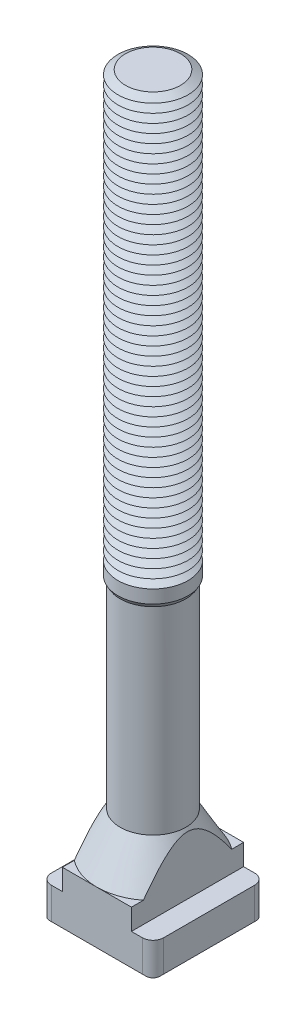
ISO-10303-21;
HEADER;
FILE_DESCRIPTION(('STEP AP214'),'2;1');
FILE_NAME('part.step','',(''),(''),'','','');
FILE_SCHEMA(('AUTOMOTIVE_DESIGN { 1 0 10303 214 1 1 1 1 }'));
ENDSEC;
DATA;
#1=APPLICATION_CONTEXT('core data for automotive mechanical design processes');
#2=APPLICATION_PROTOCOL_DEFINITION('international standard','automotive_design',2000,#1);
#3=PRODUCT_CONTEXT('',#1,'mechanical');
#4=PRODUCT('Part','Part','',(#3));
#5=PRODUCT_RELATED_PRODUCT_CATEGORY('part','',(#4));
#6=PRODUCT_DEFINITION_FORMATION('','',#4);
#7=PRODUCT_DEFINITION_CONTEXT('part definition',#1,'design');
#8=PRODUCT_DEFINITION('design','',#6,#7);
#9=PRODUCT_DEFINITION_SHAPE('','',#8);
#10=(LENGTH_UNIT() NAMED_UNIT(*) SI_UNIT(.MILLI.,.METRE.));
#11=(NAMED_UNIT(*) PLANE_ANGLE_UNIT() SI_UNIT($,.RADIAN.));
#12=(NAMED_UNIT(*) SI_UNIT($,.STERADIAN.) SOLID_ANGLE_UNIT());
#13=UNCERTAINTY_MEASURE_WITH_UNIT(LENGTH_MEASURE(1.E-05),#10,'distance_accuracy_value','');
#14=(GEOMETRIC_REPRESENTATION_CONTEXT(3) GLOBAL_UNCERTAINTY_ASSIGNED_CONTEXT((#13)) GLOBAL_UNIT_ASSIGNED_CONTEXT((#10,
#11,#12)) REPRESENTATION_CONTEXT('',''));
#15=CARTESIAN_POINT('',(0.,0.,0.));
#16=DIRECTION('',(0.,0.,1.));
#17=DIRECTION('',(1.,0.,0.));
#18=AXIS2_PLACEMENT_3D('',#15,#16,#17);
#19=CARTESIAN_POINT('',(0.,202.,0.));
#20=DIRECTION('',(0.,-1.,0.));
#21=DIRECTION('',(0.,0.,-1.));
#22=AXIS2_PLACEMENT_3D('',#19,#20,#21);
#23=CONICAL_SURFACE('',#22,7.83493649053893,1.0471975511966);
#24=CARTESIAN_POINT('',(0.,200.75,0.));
#25=DIRECTION('',(0.,-1.,0.));
#26=DIRECTION('',(0.,0.,-1.));
#27=AXIS2_PLACEMENT_3D('',#24,#25,#26);
#28=CIRCLE('',#27,10.);
#29=CARTESIAN_POINT('',(0.,200.75,-10.));
#30=VERTEX_POINT('',#29);
#31=EDGE_CURVE('E655',#30,#30,#28,.T.);
#32=ORIENTED_EDGE('',*,*,#31,.F.);
#33=EDGE_LOOP('',(#32));
#34=FACE_BOUND('',#33,.T.);
#35=CARTESIAN_POINT('',(0.,202.,0.));
#36=DIRECTION('',(0.,-1.,0.));
#37=DIRECTION('',(0.,0.,-1.));
#38=AXIS2_PLACEMENT_3D('',#35,#36,#37);
#39=CIRCLE('',#38,7.83493649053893);
#40=CARTESIAN_POINT('',(0.,202.,-7.83493649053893));
#41=VERTEX_POINT('',#40);
#42=EDGE_CURVE('E720',#41,#41,#39,.T.);
#43=ORIENTED_EDGE('',*,*,#42,.T.);
#44=EDGE_LOOP('',(#43));
#45=FACE_BOUND('',#44,.T.);
#46=ADVANCED_FACE('F39',(#34,#45),#23,.T.);
#47=CARTESIAN_POINT('',(0.,203.25,0.));
#48=DIRECTION('',(0.,1.,0.));
#49=DIRECTION('',(0.,0.,1.));
#50=AXIS2_PLACEMENT_3D('',#47,#48,#49);
#51=CONICAL_SURFACE('',#50,10.,1.0471975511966);
#52=ORIENTED_EDGE('',*,*,#42,.F.);
#53=EDGE_LOOP('',(#52));
#54=FACE_BOUND('',#53,.T.);
#55=CARTESIAN_POINT('',(0.,203.25,0.));
#56=DIRECTION('',(0.,-1.,0.));
#57=DIRECTION('',(0.,0.,-1.));
#58=AXIS2_PLACEMENT_3D('',#55,#56,#57);
#59=CIRCLE('',#58,10.);
#60=CARTESIAN_POINT('',(0.,203.25,-10.));
#61=VERTEX_POINT('',#60);
#62=EDGE_CURVE('E722',#61,#61,#59,.T.);
#63=ORIENTED_EDGE('',*,*,#62,.T.);
#64=EDGE_LOOP('',(#63));
#65=FACE_BOUND('',#64,.T.);
#66=ADVANCED_FACE('F449',(#54,#65),#51,.T.);
#67=CARTESIAN_POINT('',(4.78963846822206,212.,0.));
#68=DIRECTION('',(0.,-1.,0.));
#69=DIRECTION('',(1.,0.,0.));
#70=AXIS2_PLACEMENT_3D('',#67,#68,#69);
#71=PLANE('',#70);
#72=CARTESIAN_POINT('',(0.,212.,0.));
#73=DIRECTION('',(0.,-1.,0.));
#74=DIRECTION('',(0.,0.,-1.));
#75=AXIS2_PLACEMENT_3D('',#72,#73,#74);
#76=CIRCLE('',#75,7.83493649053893);
#77=CARTESIAN_POINT('',(0.,212.,-7.83493649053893));
#78=VERTEX_POINT('',#77);
#79=EDGE_CURVE('E669',#78,#78,#76,.T.);
#80=ORIENTED_EDGE('',*,*,#79,.F.);
#81=EDGE_LOOP('',(#80));
#82=FACE_BOUND('',#81,.T.);
#83=ADVANCED_FACE('F455',(#82),#71,.F.);
#84=CARTESIAN_POINT('',(0.,212.,0.));
#85=DIRECTION('',(0.,-1.,0.));
#86=DIRECTION('',(0.,0.,-1.));
#87=AXIS2_PLACEMENT_3D('',#84,#85,#86);
#88=CONICAL_SURFACE('',#87,7.83493649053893,1.0471975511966);
#89=CARTESIAN_POINT('',(0.,210.75,0.));
#90=DIRECTION('',(0.,-1.,0.));
#91=DIRECTION('',(0.,0.,-1.));
#92=AXIS2_PLACEMENT_3D('',#89,#90,#91);
#93=CIRCLE('',#92,10.);
#94=CARTESIAN_POINT('',(0.,210.75,-10.));
#95=VERTEX_POINT('',#94);
#96=EDGE_CURVE('E715',#95,#95,#93,.T.);
#97=ORIENTED_EDGE('',*,*,#96,.F.);
#98=EDGE_LOOP('',(#97));
#99=FACE_BOUND('',#98,.T.);
#100=ORIENTED_EDGE('',*,*,#79,.T.);
#101=EDGE_LOOP('',(#100));
#102=FACE_BOUND('',#101,.T.);
#103=ADVANCED_FACE('F483',(#99,#102),#88,.T.);
#104=CARTESIAN_POINT('',(0.,210.75,0.));
#105=DIRECTION('',(0.,1.,0.));
#106=DIRECTION('',(0.,0.,1.));
#107=AXIS2_PLACEMENT_3D('',#104,#105,#106);
#108=CONICAL_SURFACE('',#107,10.,1.0471975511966);
#109=CARTESIAN_POINT('',(0.,209.5,0.));
#110=DIRECTION('',(0.,-1.,0.));
#111=DIRECTION('',(0.,0.,-1.));
#112=AXIS2_PLACEMENT_3D('',#109,#110,#111);
#113=CIRCLE('',#112,7.83493649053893);
#114=CARTESIAN_POINT('',(0.,209.5,-7.83493649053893));
#115=VERTEX_POINT('',#114);
#116=EDGE_CURVE('E718',#115,#115,#113,.T.);
#117=ORIENTED_EDGE('',*,*,#116,.F.);
#118=EDGE_LOOP('',(#117));
#119=FACE_BOUND('',#118,.T.);
#120=ORIENTED_EDGE('',*,*,#96,.T.);
#121=EDGE_LOOP('',(#120));
#122=FACE_BOUND('',#121,.T.);
#123=ADVANCED_FACE('F480',(#119,#122),#108,.T.);
#124=CARTESIAN_POINT('',(0.,209.5,0.));
#125=DIRECTION('',(0.,-1.,0.));
#126=DIRECTION('',(0.,0.,-1.));
#127=AXIS2_PLACEMENT_3D('',#124,#125,#126);
#128=CONICAL_SURFACE('',#127,7.83493649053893,1.0471975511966);
#129=CARTESIAN_POINT('',(0.,208.25,0.));
#130=DIRECTION('',(0.,-1.,0.));
#131=DIRECTION('',(0.,0.,-1.));
#132=AXIS2_PLACEMENT_3D('',#129,#130,#131);
#133=CIRCLE('',#132,10.);
#134=CARTESIAN_POINT('',(0.,208.25,-10.));
#135=VERTEX_POINT('',#134);
#136=EDGE_CURVE('E843',#135,#135,#133,.T.);
#137=ORIENTED_EDGE('',*,*,#136,.F.);
#138=EDGE_LOOP('',(#137));
#139=FACE_BOUND('',#138,.T.);
#140=ORIENTED_EDGE('',*,*,#116,.T.);
#141=EDGE_LOOP('',(#140));
#142=FACE_BOUND('',#141,.T.);
#143=ADVANCED_FACE('F475',(#139,#142),#128,.T.);
#144=CARTESIAN_POINT('',(0.,208.25,0.));
#145=DIRECTION('',(0.,1.,0.));
#146=DIRECTION('',(0.,0.,1.));
#147=AXIS2_PLACEMENT_3D('',#144,#145,#146);
#148=CONICAL_SURFACE('',#147,10.,1.0471975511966);
#149=CARTESIAN_POINT('',(0.,207.,0.));
#150=DIRECTION('',(0.,-1.,0.));
#151=DIRECTION('',(0.,0.,-1.));
#152=AXIS2_PLACEMENT_3D('',#149,#150,#151);
#153=CIRCLE('',#152,7.83493649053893);
#154=CARTESIAN_POINT('',(0.,207.,-7.83493649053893));
#155=VERTEX_POINT('',#154);
#156=EDGE_CURVE('E839',#155,#155,#153,.T.);
#157=ORIENTED_EDGE('',*,*,#156,.F.);
#158=EDGE_LOOP('',(#157));
#159=FACE_BOUND('',#158,.T.);
#160=ORIENTED_EDGE('',*,*,#136,.T.);
#161=EDGE_LOOP('',(#160));
#162=FACE_BOUND('',#161,.T.);
#163=ADVANCED_FACE('F472',(#159,#162),#148,.T.);
#164=CARTESIAN_POINT('',(0.,207.,0.));
#165=DIRECTION('',(0.,-1.,0.));
#166=DIRECTION('',(0.,0.,-1.));
#167=AXIS2_PLACEMENT_3D('',#164,#165,#166);
#168=CONICAL_SURFACE('',#167,7.83493649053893,1.0471975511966);
#169=CARTESIAN_POINT('',(0.,205.75,0.));
#170=DIRECTION('',(0.,-1.,0.));
#171=DIRECTION('',(0.,0.,-1.));
#172=AXIS2_PLACEMENT_3D('',#169,#170,#171);
#173=CIRCLE('',#172,10.);
#174=CARTESIAN_POINT('',(0.,205.75,-10.));
#175=VERTEX_POINT('',#174);
#176=EDGE_CURVE('E835',#175,#175,#173,.T.);
#177=ORIENTED_EDGE('',*,*,#176,.F.);
#178=EDGE_LOOP('',(#177));
#179=FACE_BOUND('',#178,.T.);
#180=ORIENTED_EDGE('',*,*,#156,.T.);
#181=EDGE_LOOP('',(#180));
#182=FACE_BOUND('',#181,.T.);
#183=ADVANCED_FACE('F466',(#179,#182),#168,.T.);
#184=CARTESIAN_POINT('',(0.,205.75,0.));
#185=DIRECTION('',(0.,1.,0.));
#186=DIRECTION('',(0.,0.,1.));
#187=AXIS2_PLACEMENT_3D('',#184,#185,#186);
#188=CONICAL_SURFACE('',#187,10.,1.0471975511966);
#189=CARTESIAN_POINT('',(0.,204.5,0.));
#190=DIRECTION('',(0.,-1.,0.));
#191=DIRECTION('',(0.,0.,-1.));
#192=AXIS2_PLACEMENT_3D('',#189,#190,#191);
#193=CIRCLE('',#192,7.83493649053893);
#194=CARTESIAN_POINT('',(0.,204.5,-7.83493649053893));
#195=VERTEX_POINT('',#194);
#196=EDGE_CURVE('E632',#195,#195,#193,.T.);
#197=ORIENTED_EDGE('',*,*,#196,.F.);
#198=EDGE_LOOP('',(#197));
#199=FACE_BOUND('',#198,.T.);
#200=ORIENTED_EDGE('',*,*,#176,.T.);
#201=EDGE_LOOP('',(#200));
#202=FACE_BOUND('',#201,.T.);
#203=ADVANCED_FACE('F462',(#199,#202),#188,.T.);
#204=CARTESIAN_POINT('',(0.,204.5,0.));
#205=DIRECTION('',(0.,-1.,0.));
#206=DIRECTION('',(0.,0.,-1.));
#207=AXIS2_PLACEMENT_3D('',#204,#205,#206);
#208=CONICAL_SURFACE('',#207,7.83493649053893,1.0471975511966);
#209=ORIENTED_EDGE('',*,*,#62,.F.);
#210=EDGE_LOOP('',(#209));
#211=FACE_BOUND('',#210,.T.);
#212=ORIENTED_EDGE('',*,*,#196,.T.);
#213=EDGE_LOOP('',(#212));
#214=FACE_BOUND('',#213,.T.);
#215=ADVANCED_FACE('F465',(#211,#214),#208,.T.);
#216=CARTESIAN_POINT('',(0.,199.5,0.));
#217=DIRECTION('',(0.,-1.,0.));
#218=DIRECTION('',(0.,0.,-1.));
#219=AXIS2_PLACEMENT_3D('',#216,#217,#218);
#220=CONICAL_SURFACE('',#219,7.83493649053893,1.0471975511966);
#221=CARTESIAN_POINT('',(0.,198.25,0.));
#222=DIRECTION('',(0.,-1.,0.));
#223=DIRECTION('',(0.,0.,-1.));
#224=AXIS2_PLACEMENT_3D('',#221,#222,#223);
#225=CIRCLE('',#224,10.);
#226=CARTESIAN_POINT('',(0.,198.25,-10.));
#227=VERTEX_POINT('',#226);
#228=EDGE_CURVE('E656',#227,#227,#225,.T.);
#229=ORIENTED_EDGE('',*,*,#228,.F.);
#230=EDGE_LOOP('',(#229));
#231=FACE_BOUND('',#230,.T.);
#232=CARTESIAN_POINT('',(0.,199.5,0.));
#233=DIRECTION('',(0.,-1.,0.));
#234=DIRECTION('',(0.,0.,-1.));
#235=AXIS2_PLACEMENT_3D('',#232,#233,#234);
#236=CIRCLE('',#235,7.83493649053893);
#237=CARTESIAN_POINT('',(0.,199.5,-7.83493649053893));
#238=VERTEX_POINT('',#237);
#239=EDGE_CURVE('E653',#238,#238,#236,.T.);
#240=ORIENTED_EDGE('',*,*,#239,.T.);
#241=EDGE_LOOP('',(#240));
#242=FACE_BOUND('',#241,.T.);
#243=ADVANCED_FACE('F470',(#231,#242),#220,.T.);
#244=CARTESIAN_POINT('',(0.,200.75,0.));
#245=DIRECTION('',(0.,1.,0.));
#246=DIRECTION('',(0.,0.,1.));
#247=AXIS2_PLACEMENT_3D('',#244,#245,#246);
#248=CONICAL_SURFACE('',#247,10.,1.0471975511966);
#249=ORIENTED_EDGE('',*,*,#239,.F.);
#250=EDGE_LOOP('',(#249));
#251=FACE_BOUND('',#250,.T.);
#252=ORIENTED_EDGE('',*,*,#31,.T.);
#253=EDGE_LOOP('',(#252));
#254=FACE_BOUND('',#253,.T.);
#255=ADVANCED_FACE('F949',(#251,#254),#248,.T.);
#256=CARTESIAN_POINT('',(0.,197.,0.));
#257=DIRECTION('',(0.,-1.,0.));
#258=DIRECTION('',(0.,0.,-1.));
#259=AXIS2_PLACEMENT_3D('',#256,#257,#258);
#260=CONICAL_SURFACE('',#259,7.83493649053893,1.0471975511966);
#261=CARTESIAN_POINT('',(0.,195.75,0.));
#262=DIRECTION('',(0.,-1.,0.));
#263=DIRECTION('',(0.,0.,-1.));
#264=AXIS2_PLACEMENT_3D('',#261,#262,#263);
#265=CIRCLE('',#264,10.);
#266=CARTESIAN_POINT('',(0.,195.75,-10.));
#267=VERTEX_POINT('',#266);
#268=EDGE_CURVE('E823',#267,#267,#265,.T.);
#269=ORIENTED_EDGE('',*,*,#268,.F.);
#270=EDGE_LOOP('',(#269));
#271=FACE_BOUND('',#270,.T.);
#272=CARTESIAN_POINT('',(0.,197.,0.));
#273=DIRECTION('',(0.,-1.,0.));
#274=DIRECTION('',(0.,0.,-1.));
#275=AXIS2_PLACEMENT_3D('',#272,#273,#274);
#276=CIRCLE('',#275,7.83493649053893);
#277=CARTESIAN_POINT('',(0.,197.,-7.83493649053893));
#278=VERTEX_POINT('',#277);
#279=EDGE_CURVE('E817',#278,#278,#276,.T.);
#280=ORIENTED_EDGE('',*,*,#279,.T.);
#281=EDGE_LOOP('',(#280));
#282=FACE_BOUND('',#281,.T.);
#283=ADVANCED_FACE('F945',(#271,#282),#260,.T.);
#284=CARTESIAN_POINT('',(0.,198.25,0.));
#285=DIRECTION('',(0.,1.,0.));
#286=DIRECTION('',(0.,0.,1.));
#287=AXIS2_PLACEMENT_3D('',#284,#285,#286);
#288=CONICAL_SURFACE('',#287,10.,1.0471975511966);
#289=ORIENTED_EDGE('',*,*,#279,.F.);
#290=EDGE_LOOP('',(#289));
#291=FACE_BOUND('',#290,.T.);
#292=ORIENTED_EDGE('',*,*,#228,.T.);
#293=EDGE_LOOP('',(#292));
#294=FACE_BOUND('',#293,.T.);
#295=ADVANCED_FACE('F948',(#291,#294),#288,.T.);
#296=CARTESIAN_POINT('',(0.,194.5,0.));
#297=DIRECTION('',(0.,-1.,0.));
#298=DIRECTION('',(0.,0.,-1.));
#299=AXIS2_PLACEMENT_3D('',#296,#297,#298);
#300=CONICAL_SURFACE('',#299,7.83493649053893,1.0471975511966);
#301=CARTESIAN_POINT('',(0.,193.25,0.));
#302=DIRECTION('',(0.,-1.,0.));
#303=DIRECTION('',(0.,0.,-1.));
#304=AXIS2_PLACEMENT_3D('',#301,#302,#303);
#305=CIRCLE('',#304,10.);
#306=CARTESIAN_POINT('',(0.,193.25,-10.));
#307=VERTEX_POINT('',#306);
#308=EDGE_CURVE('E759',#307,#307,#305,.T.);
#309=ORIENTED_EDGE('',*,*,#308,.F.);
#310=EDGE_LOOP('',(#309));
#311=FACE_BOUND('',#310,.T.);
#312=CARTESIAN_POINT('',(0.,194.5,0.));
#313=DIRECTION('',(0.,-1.,0.));
#314=DIRECTION('',(0.,0.,-1.));
#315=AXIS2_PLACEMENT_3D('',#312,#313,#314);
#316=CIRCLE('',#315,7.83493649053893);
#317=CARTESIAN_POINT('',(0.,194.5,-7.83493649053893));
#318=VERTEX_POINT('',#317);
#319=EDGE_CURVE('E761',#318,#318,#316,.T.);
#320=ORIENTED_EDGE('',*,*,#319,.T.);
#321=EDGE_LOOP('',(#320));
#322=FACE_BOUND('',#321,.T.);
#323=ADVANCED_FACE('F954',(#311,#322),#300,.T.);
#324=CARTESIAN_POINT('',(0.,195.75,0.));
#325=DIRECTION('',(0.,1.,0.));
#326=DIRECTION('',(0.,0.,1.));
#327=AXIS2_PLACEMENT_3D('',#324,#325,#326);
#328=CONICAL_SURFACE('',#327,10.,1.0471975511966);
#329=ORIENTED_EDGE('',*,*,#319,.F.);
#330=EDGE_LOOP('',(#329));
#331=FACE_BOUND('',#330,.T.);
#332=ORIENTED_EDGE('',*,*,#268,.T.);
#333=EDGE_LOOP('',(#332));
#334=FACE_BOUND('',#333,.T.);
#335=ADVANCED_FACE('F943',(#331,#334),#328,.T.);
#336=CARTESIAN_POINT('',(0.,192.,0.));
#337=DIRECTION('',(0.,-1.,0.));
#338=DIRECTION('',(0.,0.,-1.));
#339=AXIS2_PLACEMENT_3D('',#336,#337,#338);
#340=CONICAL_SURFACE('',#339,7.83493649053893,1.0471975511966);
#341=CARTESIAN_POINT('',(0.,190.75,0.));
#342=DIRECTION('',(0.,-1.,0.));
#343=DIRECTION('',(0.,0.,-1.));
#344=AXIS2_PLACEMENT_3D('',#341,#342,#343);
#345=CIRCLE('',#344,10.);
#346=CARTESIAN_POINT('',(0.,190.75,-10.));
#347=VERTEX_POINT('',#346);
#348=EDGE_CURVE('E813',#347,#347,#345,.T.);
#349=ORIENTED_EDGE('',*,*,#348,.F.);
#350=EDGE_LOOP('',(#349));
#351=FACE_BOUND('',#350,.T.);
#352=CARTESIAN_POINT('',(0.,192.,0.));
#353=DIRECTION('',(0.,-1.,0.));
#354=DIRECTION('',(0.,0.,-1.));
#355=AXIS2_PLACEMENT_3D('',#352,#353,#354);
#356=CIRCLE('',#355,7.83493649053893);
#357=CARTESIAN_POINT('',(0.,192.,-7.83493649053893));
#358=VERTEX_POINT('',#357);
#359=EDGE_CURVE('E762',#358,#358,#356,.T.);
#360=ORIENTED_EDGE('',*,*,#359,.T.);
#361=EDGE_LOOP('',(#360));
#362=FACE_BOUND('',#361,.T.);
#363=ADVANCED_FACE('F995',(#351,#362),#340,.T.);
#364=CARTESIAN_POINT('',(0.,193.25,0.));
#365=DIRECTION('',(0.,1.,0.));
#366=DIRECTION('',(0.,0.,1.));
#367=AXIS2_PLACEMENT_3D('',#364,#365,#366);
#368=CONICAL_SURFACE('',#367,10.,1.0471975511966);
#369=ORIENTED_EDGE('',*,*,#359,.F.);
#370=EDGE_LOOP('',(#369));
#371=FACE_BOUND('',#370,.T.);
#372=ORIENTED_EDGE('',*,*,#308,.T.);
#373=EDGE_LOOP('',(#372));
#374=FACE_BOUND('',#373,.T.);
#375=ADVANCED_FACE('F1003',(#371,#374),#368,.T.);
#376=CARTESIAN_POINT('',(0.,189.5,0.));
#377=DIRECTION('',(0.,-1.,0.));
#378=DIRECTION('',(0.,0.,-1.));
#379=AXIS2_PLACEMENT_3D('',#376,#377,#378);
#380=CONICAL_SURFACE('',#379,7.83493649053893,1.0471975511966);
#381=CARTESIAN_POINT('',(0.,188.25,0.));
#382=DIRECTION('',(0.,-1.,0.));
#383=DIRECTION('',(0.,0.,-1.));
#384=AXIS2_PLACEMENT_3D('',#381,#382,#383);
#385=CIRCLE('',#384,10.);
#386=CARTESIAN_POINT('',(0.,188.25,-10.));
#387=VERTEX_POINT('',#386);
#388=EDGE_CURVE('E814',#387,#387,#385,.T.);
#389=ORIENTED_EDGE('',*,*,#388,.F.);
#390=EDGE_LOOP('',(#389));
#391=FACE_BOUND('',#390,.T.);
#392=CARTESIAN_POINT('',(0.,189.5,0.));
#393=DIRECTION('',(0.,-1.,0.));
#394=DIRECTION('',(0.,0.,-1.));
#395=AXIS2_PLACEMENT_3D('',#392,#393,#394);
#396=CIRCLE('',#395,7.83493649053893);
#397=CARTESIAN_POINT('',(0.,189.5,-7.83493649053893));
#398=VERTEX_POINT('',#397);
#399=EDGE_CURVE('E811',#398,#398,#396,.T.);
#400=ORIENTED_EDGE('',*,*,#399,.T.);
#401=EDGE_LOOP('',(#400));
#402=FACE_BOUND('',#401,.T.);
#403=ADVANCED_FACE('F1012',(#391,#402),#380,.T.);
#404=CARTESIAN_POINT('',(0.,190.75,0.));
#405=DIRECTION('',(0.,1.,0.));
#406=DIRECTION('',(0.,0.,1.));
#407=AXIS2_PLACEMENT_3D('',#404,#405,#406);
#408=CONICAL_SURFACE('',#407,10.,1.0471975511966);
#409=ORIENTED_EDGE('',*,*,#399,.F.);
#410=EDGE_LOOP('',(#409));
#411=FACE_BOUND('',#410,.T.);
#412=ORIENTED_EDGE('',*,*,#348,.T.);
#413=EDGE_LOOP('',(#412));
#414=FACE_BOUND('',#413,.T.);
#415=ADVANCED_FACE('F1021',(#411,#414),#408,.T.);
#416=CARTESIAN_POINT('',(0.,187.,0.));
#417=DIRECTION('',(0.,-1.,0.));
#418=DIRECTION('',(0.,0.,-1.));
#419=AXIS2_PLACEMENT_3D('',#416,#417,#418);
#420=CONICAL_SURFACE('',#419,7.83493649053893,1.0471975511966);
#421=CARTESIAN_POINT('',(0.,185.75,0.));
#422=DIRECTION('',(0.,-1.,0.));
#423=DIRECTION('',(0.,0.,-1.));
#424=AXIS2_PLACEMENT_3D('',#421,#422,#423);
#425=CIRCLE('',#424,10.);
#426=CARTESIAN_POINT('',(0.,185.75,-10.));
#427=VERTEX_POINT('',#426);
#428=EDGE_CURVE('E647',#427,#427,#425,.T.);
#429=ORIENTED_EDGE('',*,*,#428,.F.);
#430=EDGE_LOOP('',(#429));
#431=FACE_BOUND('',#430,.T.);
#432=CARTESIAN_POINT('',(0.,187.,0.));
#433=DIRECTION('',(0.,-1.,0.));
#434=DIRECTION('',(0.,0.,-1.));
#435=AXIS2_PLACEMENT_3D('',#432,#433,#434);
#436=CIRCLE('',#435,7.83493649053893);
#437=CARTESIAN_POINT('',(0.,187.,-7.83493649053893));
#438=VERTEX_POINT('',#437);
#439=EDGE_CURVE('E650',#438,#438,#436,.T.);
#440=ORIENTED_EDGE('',*,*,#439,.T.);
#441=EDGE_LOOP('',(#440));
#442=FACE_BOUND('',#441,.T.);
#443=ADVANCED_FACE('F1030',(#431,#442),#420,.T.);
#444=CARTESIAN_POINT('',(0.,188.25,0.));
#445=DIRECTION('',(0.,1.,0.));
#446=DIRECTION('',(0.,0.,1.));
#447=AXIS2_PLACEMENT_3D('',#444,#445,#446);
#448=CONICAL_SURFACE('',#447,10.,1.0471975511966);
#449=ORIENTED_EDGE('',*,*,#439,.F.);
#450=EDGE_LOOP('',(#449));
#451=FACE_BOUND('',#450,.T.);
#452=ORIENTED_EDGE('',*,*,#388,.T.);
#453=EDGE_LOOP('',(#452));
#454=FACE_BOUND('',#453,.T.);
#455=ADVANCED_FACE('F1039',(#451,#454),#448,.T.);
#456=CARTESIAN_POINT('',(0.,184.5,0.));
#457=DIRECTION('',(0.,-1.,0.));
#458=DIRECTION('',(0.,0.,-1.));
#459=AXIS2_PLACEMENT_3D('',#456,#457,#458);
#460=CONICAL_SURFACE('',#459,7.83493649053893,1.0471975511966);
#461=CARTESIAN_POINT('',(0.,183.25,0.));
#462=DIRECTION('',(0.,-1.,0.));
#463=DIRECTION('',(0.,0.,-1.));
#464=AXIS2_PLACEMENT_3D('',#461,#462,#463);
#465=CIRCLE('',#464,10.);
#466=CARTESIAN_POINT('',(0.,183.25,-10.));
#467=VERTEX_POINT('',#466);
#468=EDGE_CURVE('E890',#467,#467,#465,.T.);
#469=ORIENTED_EDGE('',*,*,#468,.F.);
#470=EDGE_LOOP('',(#469));
#471=FACE_BOUND('',#470,.T.);
#472=CARTESIAN_POINT('',(0.,184.5,0.));
#473=DIRECTION('',(0.,-1.,0.));
#474=DIRECTION('',(0.,0.,-1.));
#475=AXIS2_PLACEMENT_3D('',#472,#473,#474);
#476=CIRCLE('',#475,7.83493649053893);
#477=CARTESIAN_POINT('',(0.,184.5,-7.83493649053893));
#478=VERTEX_POINT('',#477);
#479=EDGE_CURVE('E651',#478,#478,#476,.T.);
#480=ORIENTED_EDGE('',*,*,#479,.T.);
#481=EDGE_LOOP('',(#480));
#482=FACE_BOUND('',#481,.T.);
#483=ADVANCED_FACE('F1048',(#471,#482),#460,.T.);
#484=CARTESIAN_POINT('',(0.,185.75,0.));
#485=DIRECTION('',(0.,1.,0.));
#486=DIRECTION('',(0.,0.,1.));
#487=AXIS2_PLACEMENT_3D('',#484,#485,#486);
#488=CONICAL_SURFACE('',#487,10.,1.0471975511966);
#489=ORIENTED_EDGE('',*,*,#479,.F.);
#490=EDGE_LOOP('',(#489));
#491=FACE_BOUND('',#490,.T.);
#492=ORIENTED_EDGE('',*,*,#428,.T.);
#493=EDGE_LOOP('',(#492));
#494=FACE_BOUND('',#493,.T.);
#495=ADVANCED_FACE('F1057',(#491,#494),#488,.T.);
#496=CARTESIAN_POINT('',(0.,182.,0.));
#497=DIRECTION('',(0.,-1.,0.));
#498=DIRECTION('',(0.,0.,-1.));
#499=AXIS2_PLACEMENT_3D('',#496,#497,#498);
#500=CONICAL_SURFACE('',#499,7.83493649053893,1.0471975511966);
#501=CARTESIAN_POINT('',(0.,180.75,0.));
#502=DIRECTION('',(0.,-1.,0.));
#503=DIRECTION('',(0.,0.,-1.));
#504=AXIS2_PLACEMENT_3D('',#501,#502,#503);
#505=CIRCLE('',#504,10.);
#506=CARTESIAN_POINT('',(0.,180.75,-10.));
#507=VERTEX_POINT('',#506);
#508=EDGE_CURVE('E780',#507,#507,#505,.T.);
#509=ORIENTED_EDGE('',*,*,#508,.F.);
#510=EDGE_LOOP('',(#509));
#511=FACE_BOUND('',#510,.T.);
#512=CARTESIAN_POINT('',(0.,182.,0.));
#513=DIRECTION('',(0.,-1.,0.));
#514=DIRECTION('',(0.,0.,-1.));
#515=AXIS2_PLACEMENT_3D('',#512,#513,#514);
#516=CIRCLE('',#515,7.83493649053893);
#517=CARTESIAN_POINT('',(0.,182.,-7.83493649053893));
#518=VERTEX_POINT('',#517);
#519=EDGE_CURVE('E784',#518,#518,#516,.T.);
#520=ORIENTED_EDGE('',*,*,#519,.T.);
#521=EDGE_LOOP('',(#520));
#522=FACE_BOUND('',#521,.T.);
#523=ADVANCED_FACE('F1066',(#511,#522),#500,.T.);
#524=CARTESIAN_POINT('',(0.,183.25,0.));
#525=DIRECTION('',(0.,1.,0.));
#526=DIRECTION('',(0.,0.,1.));
#527=AXIS2_PLACEMENT_3D('',#524,#525,#526);
#528=CONICAL_SURFACE('',#527,10.,1.0471975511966);
#529=ORIENTED_EDGE('',*,*,#519,.F.);
#530=EDGE_LOOP('',(#529));
#531=FACE_BOUND('',#530,.T.);
#532=ORIENTED_EDGE('',*,*,#468,.T.);
#533=EDGE_LOOP('',(#532));
#534=FACE_BOUND('',#533,.T.);
#535=ADVANCED_FACE('F1075',(#531,#534),#528,.T.);
#536=CARTESIAN_POINT('',(0.,179.5,0.));
#537=DIRECTION('',(0.,-1.,0.));
#538=DIRECTION('',(0.,0.,-1.));
#539=AXIS2_PLACEMENT_3D('',#536,#537,#538);
#540=CONICAL_SURFACE('',#539,7.83493649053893,1.0471975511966);
#541=CARTESIAN_POINT('',(0.,178.25,0.));
#542=DIRECTION('',(0.,-1.,0.));
#543=DIRECTION('',(0.,0.,-1.));
#544=AXIS2_PLACEMENT_3D('',#541,#542,#543);
#545=CIRCLE('',#544,10.);
#546=CARTESIAN_POINT('',(0.,178.25,-10.));
#547=VERTEX_POINT('',#546);
#548=EDGE_CURVE('E781',#547,#547,#545,.T.);
#549=ORIENTED_EDGE('',*,*,#548,.F.);
#550=EDGE_LOOP('',(#549));
#551=FACE_BOUND('',#550,.T.);
#552=CARTESIAN_POINT('',(0.,179.5,0.));
#553=DIRECTION('',(0.,-1.,0.));
#554=DIRECTION('',(0.,0.,-1.));
#555=AXIS2_PLACEMENT_3D('',#552,#553,#554);
#556=CIRCLE('',#555,7.83493649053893);
#557=CARTESIAN_POINT('',(0.,179.5,-7.83493649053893));
#558=VERTEX_POINT('',#557);
#559=EDGE_CURVE('E777',#558,#558,#556,.T.);
#560=ORIENTED_EDGE('',*,*,#559,.T.);
#561=EDGE_LOOP('',(#560));
#562=FACE_BOUND('',#561,.T.);
#563=ADVANCED_FACE('F1084',(#551,#562),#540,.T.);
#564=CARTESIAN_POINT('',(0.,180.75,0.));
#565=DIRECTION('',(0.,1.,0.));
#566=DIRECTION('',(0.,0.,1.));
#567=AXIS2_PLACEMENT_3D('',#564,#565,#566);
#568=CONICAL_SURFACE('',#567,10.,1.0471975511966);
#569=ORIENTED_EDGE('',*,*,#559,.F.);
#570=EDGE_LOOP('',(#569));
#571=FACE_BOUND('',#570,.T.);
#572=ORIENTED_EDGE('',*,*,#508,.T.);
#573=EDGE_LOOP('',(#572));
#574=FACE_BOUND('',#573,.T.);
#575=ADVANCED_FACE('F1093',(#571,#574),#568,.T.);
#576=CARTESIAN_POINT('',(0.,177.,0.));
#577=DIRECTION('',(0.,-1.,0.));
#578=DIRECTION('',(0.,0.,-1.));
#579=AXIS2_PLACEMENT_3D('',#576,#577,#578);
#580=CONICAL_SURFACE('',#579,7.83493649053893,1.0471975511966);
#581=CARTESIAN_POINT('',(0.,175.75,0.));
#582=DIRECTION('',(0.,-1.,0.));
#583=DIRECTION('',(0.,0.,-1.));
#584=AXIS2_PLACEMENT_3D('',#581,#582,#583);
#585=CIRCLE('',#584,10.);
#586=CARTESIAN_POINT('',(0.,175.75,-10.));
#587=VERTEX_POINT('',#586);
#588=EDGE_CURVE('E709',#587,#587,#585,.T.);
#589=ORIENTED_EDGE('',*,*,#588,.F.);
#590=EDGE_LOOP('',(#589));
#591=FACE_BOUND('',#590,.T.);
#592=CARTESIAN_POINT('',(0.,177.,0.));
#593=DIRECTION('',(0.,-1.,0.));
#594=DIRECTION('',(0.,0.,-1.));
#595=AXIS2_PLACEMENT_3D('',#592,#593,#594);
#596=CIRCLE('',#595,7.83493649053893);
#597=CARTESIAN_POINT('',(0.,177.,-7.83493649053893));
#598=VERTEX_POINT('',#597);
#599=EDGE_CURVE('E712',#598,#598,#596,.T.);
#600=ORIENTED_EDGE('',*,*,#599,.T.);
#601=EDGE_LOOP('',(#600));
#602=FACE_BOUND('',#601,.T.);
#603=ADVANCED_FACE('F1102',(#591,#602),#580,.T.);
#604=CARTESIAN_POINT('',(0.,178.25,0.));
#605=DIRECTION('',(0.,1.,0.));
#606=DIRECTION('',(0.,0.,1.));
#607=AXIS2_PLACEMENT_3D('',#604,#605,#606);
#608=CONICAL_SURFACE('',#607,10.,1.0471975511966);
#609=ORIENTED_EDGE('',*,*,#599,.F.);
#610=EDGE_LOOP('',(#609));
#611=FACE_BOUND('',#610,.T.);
#612=ORIENTED_EDGE('',*,*,#548,.T.);
#613=EDGE_LOOP('',(#612));
#614=FACE_BOUND('',#613,.T.);
#615=ADVANCED_FACE('F1111',(#611,#614),#608,.T.);
#616=CARTESIAN_POINT('',(0.,174.5,0.));
#617=DIRECTION('',(0.,-1.,0.));
#618=DIRECTION('',(0.,0.,-1.));
#619=AXIS2_PLACEMENT_3D('',#616,#617,#618);
#620=CONICAL_SURFACE('',#619,7.83493649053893,1.0471975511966);
#621=CARTESIAN_POINT('',(0.,173.25,0.));
#622=DIRECTION('',(0.,-1.,0.));
#623=DIRECTION('',(0.,0.,-1.));
#624=AXIS2_PLACEMENT_3D('',#621,#622,#623);
#625=CIRCLE('',#624,10.);
#626=CARTESIAN_POINT('',(0.,173.25,-10.));
#627=VERTEX_POINT('',#626);
#628=EDGE_CURVE('E809',#627,#627,#625,.T.);
#629=ORIENTED_EDGE('',*,*,#628,.F.);
#630=EDGE_LOOP('',(#629));
#631=FACE_BOUND('',#630,.T.);
#632=CARTESIAN_POINT('',(0.,174.5,0.));
#633=DIRECTION('',(0.,-1.,0.));
#634=DIRECTION('',(0.,0.,-1.));
#635=AXIS2_PLACEMENT_3D('',#632,#633,#634);
#636=CIRCLE('',#635,7.83493649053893);
#637=CARTESIAN_POINT('',(0.,174.5,-7.83493649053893));
#638=VERTEX_POINT('',#637);
#639=EDGE_CURVE('E713',#638,#638,#636,.T.);
#640=ORIENTED_EDGE('',*,*,#639,.T.);
#641=EDGE_LOOP('',(#640));
#642=FACE_BOUND('',#641,.T.);
#643=ADVANCED_FACE('F1120',(#631,#642),#620,.T.);
#644=CARTESIAN_POINT('',(0.,175.75,0.));
#645=DIRECTION('',(0.,1.,0.));
#646=DIRECTION('',(0.,0.,1.));
#647=AXIS2_PLACEMENT_3D('',#644,#645,#646);
#648=CONICAL_SURFACE('',#647,10.,1.0471975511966);
#649=ORIENTED_EDGE('',*,*,#639,.F.);
#650=EDGE_LOOP('',(#649));
#651=FACE_BOUND('',#650,.T.);
#652=ORIENTED_EDGE('',*,*,#588,.T.);
#653=EDGE_LOOP('',(#652));
#654=FACE_BOUND('',#653,.T.);
#655=ADVANCED_FACE('F1129',(#651,#654),#648,.T.);
#656=CARTESIAN_POINT('',(0.,172.,0.));
#657=DIRECTION('',(0.,-1.,0.));
#658=DIRECTION('',(0.,0.,-1.));
#659=AXIS2_PLACEMENT_3D('',#656,#657,#658);
#660=CONICAL_SURFACE('',#659,7.83493649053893,1.0471975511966);
#661=CARTESIAN_POINT('',(0.,170.75,0.));
#662=DIRECTION('',(0.,-1.,0.));
#663=DIRECTION('',(0.,0.,-1.));
#664=AXIS2_PLACEMENT_3D('',#661,#662,#663);
#665=CIRCLE('',#664,10.);
#666=CARTESIAN_POINT('',(0.,170.75,-10.));
#667=VERTEX_POINT('',#666);
#668=EDGE_CURVE('E756',#667,#667,#665,.T.);
#669=ORIENTED_EDGE('',*,*,#668,.F.);
#670=EDGE_LOOP('',(#669));
#671=FACE_BOUND('',#670,.T.);
#672=CARTESIAN_POINT('',(0.,172.,0.));
#673=DIRECTION('',(0.,-1.,0.));
#674=DIRECTION('',(0.,0.,-1.));
#675=AXIS2_PLACEMENT_3D('',#672,#673,#674);
#676=CIRCLE('',#675,7.83493649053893);
#677=CARTESIAN_POINT('',(0.,172.,-7.83493649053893));
#678=VERTEX_POINT('',#677);
#679=EDGE_CURVE('E806',#678,#678,#676,.T.);
#680=ORIENTED_EDGE('',*,*,#679,.T.);
#681=EDGE_LOOP('',(#680));
#682=FACE_BOUND('',#681,.T.);
#683=ADVANCED_FACE('F1138',(#671,#682),#660,.T.);
#684=CARTESIAN_POINT('',(0.,173.25,0.));
#685=DIRECTION('',(0.,1.,0.));
#686=DIRECTION('',(0.,0.,1.));
#687=AXIS2_PLACEMENT_3D('',#684,#685,#686);
#688=CONICAL_SURFACE('',#687,10.,1.0471975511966);
#689=ORIENTED_EDGE('',*,*,#679,.F.);
#690=EDGE_LOOP('',(#689));
#691=FACE_BOUND('',#690,.T.);
#692=ORIENTED_EDGE('',*,*,#628,.T.);
#693=EDGE_LOOP('',(#692));
#694=FACE_BOUND('',#693,.T.);
#695=ADVANCED_FACE('F1147',(#691,#694),#688,.T.);
#696=CARTESIAN_POINT('',(0.,169.5,0.));
#697=DIRECTION('',(0.,-1.,0.));
#698=DIRECTION('',(0.,0.,-1.));
#699=AXIS2_PLACEMENT_3D('',#696,#697,#698);
#700=CONICAL_SURFACE('',#699,7.83493649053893,1.0471975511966);
#701=CARTESIAN_POINT('',(0.,168.25,0.));
#702=DIRECTION('',(0.,-1.,0.));
#703=DIRECTION('',(0.,0.,-1.));
#704=AXIS2_PLACEMENT_3D('',#701,#702,#703);
#705=CIRCLE('',#704,10.);
#706=CARTESIAN_POINT('',(0.,168.25,-10.));
#707=VERTEX_POINT('',#706);
#708=EDGE_CURVE('E757',#707,#707,#705,.T.);
#709=ORIENTED_EDGE('',*,*,#708,.F.);
#710=EDGE_LOOP('',(#709));
#711=FACE_BOUND('',#710,.T.);
#712=CARTESIAN_POINT('',(0.,169.5,0.));
#713=DIRECTION('',(0.,-1.,0.));
#714=DIRECTION('',(0.,0.,-1.));
#715=AXIS2_PLACEMENT_3D('',#712,#713,#714);
#716=CIRCLE('',#715,7.83493649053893);
#717=CARTESIAN_POINT('',(0.,169.5,-7.83493649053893));
#718=VERTEX_POINT('',#717);
#719=EDGE_CURVE('E753',#718,#718,#716,.T.);
#720=ORIENTED_EDGE('',*,*,#719,.T.);
#721=EDGE_LOOP('',(#720));
#722=FACE_BOUND('',#721,.T.);
#723=ADVANCED_FACE('F1156',(#711,#722),#700,.T.);
#724=CARTESIAN_POINT('',(0.,170.75,0.));
#725=DIRECTION('',(0.,1.,0.));
#726=DIRECTION('',(0.,0.,1.));
#727=AXIS2_PLACEMENT_3D('',#724,#725,#726);
#728=CONICAL_SURFACE('',#727,10.,1.0471975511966);
#729=ORIENTED_EDGE('',*,*,#719,.F.);
#730=EDGE_LOOP('',(#729));
#731=FACE_BOUND('',#730,.T.);
#732=ORIENTED_EDGE('',*,*,#668,.T.);
#733=EDGE_LOOP('',(#732));
#734=FACE_BOUND('',#733,.T.);
#735=ADVANCED_FACE('F1165',(#731,#734),#728,.T.);
#736=CARTESIAN_POINT('',(0.,167.,0.));
#737=DIRECTION('',(0.,-1.,0.));
#738=DIRECTION('',(0.,0.,-1.));
#739=AXIS2_PLACEMENT_3D('',#736,#737,#738);
#740=CONICAL_SURFACE('',#739,7.83493649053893,1.0471975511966);
#741=CARTESIAN_POINT('',(0.,165.75,0.));
#742=DIRECTION('',(0.,-1.,0.));
#743=DIRECTION('',(0.,0.,-1.));
#744=AXIS2_PLACEMENT_3D('',#741,#742,#743);
#745=CIRCLE('',#744,10.);
#746=CARTESIAN_POINT('',(0.,165.75,-10.));
#747=VERTEX_POINT('',#746);
#748=EDGE_CURVE('E644',#747,#747,#745,.T.);
#749=ORIENTED_EDGE('',*,*,#748,.F.);
#750=EDGE_LOOP('',(#749));
#751=FACE_BOUND('',#750,.T.);
#752=CARTESIAN_POINT('',(0.,167.,0.));
#753=DIRECTION('',(0.,-1.,0.));
#754=DIRECTION('',(0.,0.,-1.));
#755=AXIS2_PLACEMENT_3D('',#752,#753,#754);
#756=CIRCLE('',#755,7.83493649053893);
#757=CARTESIAN_POINT('',(0.,167.,-7.83493649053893));
#758=VERTEX_POINT('',#757);
#759=EDGE_CURVE('E877',#758,#758,#756,.T.);
#760=ORIENTED_EDGE('',*,*,#759,.T.);
#761=EDGE_LOOP('',(#760));
#762=FACE_BOUND('',#761,.T.);
#763=ADVANCED_FACE('F1174',(#751,#762),#740,.T.);
#764=CARTESIAN_POINT('',(0.,168.25,0.));
#765=DIRECTION('',(0.,1.,0.));
#766=DIRECTION('',(0.,0.,1.));
#767=AXIS2_PLACEMENT_3D('',#764,#765,#766);
#768=CONICAL_SURFACE('',#767,10.,1.0471975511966);
#769=ORIENTED_EDGE('',*,*,#759,.F.);
#770=EDGE_LOOP('',(#769));
#771=FACE_BOUND('',#770,.T.);
#772=ORIENTED_EDGE('',*,*,#708,.T.);
#773=EDGE_LOOP('',(#772));
#774=FACE_BOUND('',#773,.T.);
#775=ADVANCED_FACE('F1183',(#771,#774),#768,.T.);
#776=CARTESIAN_POINT('',(0.,164.5,0.));
#777=DIRECTION('',(0.,-1.,0.));
#778=DIRECTION('',(0.,0.,-1.));
#779=AXIS2_PLACEMENT_3D('',#776,#777,#778);
#780=CONICAL_SURFACE('',#779,7.83493649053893,1.0471975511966);
#781=CARTESIAN_POINT('',(0.,163.25,0.));
#782=DIRECTION('',(0.,-1.,0.));
#783=DIRECTION('',(0.,0.,-1.));
#784=AXIS2_PLACEMENT_3D('',#781,#782,#783);
#785=CIRCLE('',#784,10.);
#786=CARTESIAN_POINT('',(0.,163.25,-10.));
#787=VERTEX_POINT('',#786);
#788=EDGE_CURVE('E645',#787,#787,#785,.T.);
#789=ORIENTED_EDGE('',*,*,#788,.F.);
#790=EDGE_LOOP('',(#789));
#791=FACE_BOUND('',#790,.T.);
#792=CARTESIAN_POINT('',(0.,164.5,0.));
#793=DIRECTION('',(0.,-1.,0.));
#794=DIRECTION('',(0.,0.,-1.));
#795=AXIS2_PLACEMENT_3D('',#792,#793,#794);
#796=CIRCLE('',#795,7.83493649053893);
#797=CARTESIAN_POINT('',(0.,164.5,-7.83493649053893));
#798=VERTEX_POINT('',#797);
#799=EDGE_CURVE('E641',#798,#798,#796,.T.);
#800=ORIENTED_EDGE('',*,*,#799,.T.);
#801=EDGE_LOOP('',(#800));
#802=FACE_BOUND('',#801,.T.);
#803=ADVANCED_FACE('F1192',(#791,#802),#780,.T.);
#804=CARTESIAN_POINT('',(0.,165.75,0.));
#805=DIRECTION('',(0.,1.,0.));
#806=DIRECTION('',(0.,0.,1.));
#807=AXIS2_PLACEMENT_3D('',#804,#805,#806);
#808=CONICAL_SURFACE('',#807,10.,1.0471975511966);
#809=ORIENTED_EDGE('',*,*,#799,.F.);
#810=EDGE_LOOP('',(#809));
#811=FACE_BOUND('',#810,.T.);
#812=ORIENTED_EDGE('',*,*,#748,.T.);
#813=EDGE_LOOP('',(#812));
#814=FACE_BOUND('',#813,.T.);
#815=ADVANCED_FACE('F1201',(#811,#814),#808,.T.);
#816=CARTESIAN_POINT('',(0.,162.,0.));
#817=DIRECTION('',(0.,-1.,0.));
#818=DIRECTION('',(0.,0.,-1.));
#819=AXIS2_PLACEMENT_3D('',#816,#817,#818);
#820=CONICAL_SURFACE('',#819,7.83493649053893,1.0471975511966);
#821=CARTESIAN_POINT('',(0.,160.75,0.));
#822=DIRECTION('',(0.,-1.,0.));
#823=DIRECTION('',(0.,0.,-1.));
#824=AXIS2_PLACEMENT_3D('',#821,#822,#823);
#825=CIRCLE('',#824,10.);
#826=CARTESIAN_POINT('',(0.,160.75,-10.));
#827=VERTEX_POINT('',#826);
#828=EDGE_CURVE('E706',#827,#827,#825,.T.);
#829=ORIENTED_EDGE('',*,*,#828,.F.);
#830=EDGE_LOOP('',(#829));
#831=FACE_BOUND('',#830,.T.);
#832=CARTESIAN_POINT('',(0.,162.,0.));
#833=DIRECTION('',(0.,-1.,0.));
#834=DIRECTION('',(0.,0.,-1.));
#835=AXIS2_PLACEMENT_3D('',#832,#833,#834);
#836=CIRCLE('',#835,7.83493649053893);
#837=CARTESIAN_POINT('',(0.,162.,-7.83493649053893));
#838=VERTEX_POINT('',#837);
#839=EDGE_CURVE('E751',#838,#838,#836,.T.);
#840=ORIENTED_EDGE('',*,*,#839,.T.);
#841=EDGE_LOOP('',(#840));
#842=FACE_BOUND('',#841,.T.);
#843=ADVANCED_FACE('F1210',(#831,#842),#820,.T.);
#844=CARTESIAN_POINT('',(0.,163.25,0.));
#845=DIRECTION('',(0.,1.,0.));
#846=DIRECTION('',(0.,0.,1.));
#847=AXIS2_PLACEMENT_3D('',#844,#845,#846);
#848=CONICAL_SURFACE('',#847,10.,1.0471975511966);
#849=ORIENTED_EDGE('',*,*,#839,.F.);
#850=EDGE_LOOP('',(#849));
#851=FACE_BOUND('',#850,.T.);
#852=ORIENTED_EDGE('',*,*,#788,.T.);
#853=EDGE_LOOP('',(#852));
#854=FACE_BOUND('',#853,.T.);
#855=ADVANCED_FACE('F1219',(#851,#854),#848,.T.);
#856=CARTESIAN_POINT('',(0.,159.5,0.));
#857=DIRECTION('',(0.,-1.,0.));
#858=DIRECTION('',(0.,0.,-1.));
#859=AXIS2_PLACEMENT_3D('',#856,#857,#858);
#860=CONICAL_SURFACE('',#859,7.83493649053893,1.0471975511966);
#861=CARTESIAN_POINT('',(0.,158.25,0.));
#862=DIRECTION('',(0.,-1.,0.));
#863=DIRECTION('',(0.,0.,-1.));
#864=AXIS2_PLACEMENT_3D('',#861,#862,#863);
#865=CIRCLE('',#864,10.);
#866=CARTESIAN_POINT('',(0.,158.25,-10.));
#867=VERTEX_POINT('',#866);
#868=EDGE_CURVE('E707',#867,#867,#865,.T.);
#869=ORIENTED_EDGE('',*,*,#868,.F.);
#870=EDGE_LOOP('',(#869));
#871=FACE_BOUND('',#870,.T.);
#872=CARTESIAN_POINT('',(0.,159.5,0.));
#873=DIRECTION('',(0.,-1.,0.));
#874=DIRECTION('',(0.,0.,-1.));
#875=AXIS2_PLACEMENT_3D('',#872,#873,#874);
#876=CIRCLE('',#875,7.83493649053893);
#877=CARTESIAN_POINT('',(0.,159.5,-7.83493649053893));
#878=VERTEX_POINT('',#877);
#879=EDGE_CURVE('E703',#878,#878,#876,.T.);
#880=ORIENTED_EDGE('',*,*,#879,.T.);
#881=EDGE_LOOP('',(#880));
#882=FACE_BOUND('',#881,.T.);
#883=ADVANCED_FACE('F1228',(#871,#882),#860,.T.);
#884=CARTESIAN_POINT('',(0.,160.75,0.));
#885=DIRECTION('',(0.,1.,0.));
#886=DIRECTION('',(0.,0.,1.));
#887=AXIS2_PLACEMENT_3D('',#884,#885,#886);
#888=CONICAL_SURFACE('',#887,10.,1.0471975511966);
#889=ORIENTED_EDGE('',*,*,#879,.F.);
#890=EDGE_LOOP('',(#889));
#891=FACE_BOUND('',#890,.T.);
#892=ORIENTED_EDGE('',*,*,#828,.T.);
#893=EDGE_LOOP('',(#892));
#894=FACE_BOUND('',#893,.T.);
#895=ADVANCED_FACE('F1237',(#891,#894),#888,.T.);
#896=CARTESIAN_POINT('',(0.,157.,0.));
#897=DIRECTION('',(0.,-1.,0.));
#898=DIRECTION('',(0.,0.,-1.));
#899=AXIS2_PLACEMENT_3D('',#896,#897,#898);
#900=CONICAL_SURFACE('',#899,7.83493649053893,1.0471975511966);
#901=CARTESIAN_POINT('',(0.,155.75,0.));
#902=DIRECTION('',(0.,-1.,0.));
#903=DIRECTION('',(0.,0.,-1.));
#904=AXIS2_PLACEMENT_3D('',#901,#902,#903);
#905=CIRCLE('',#904,10.);
#906=CARTESIAN_POINT('',(0.,155.75,-10.));
#907=VERTEX_POINT('',#906);
#908=EDGE_CURVE('E913',#907,#907,#905,.T.);
#909=ORIENTED_EDGE('',*,*,#908,.F.);
#910=EDGE_LOOP('',(#909));
#911=FACE_BOUND('',#910,.T.);
#912=CARTESIAN_POINT('',(0.,157.,0.));
#913=DIRECTION('',(0.,-1.,0.));
#914=DIRECTION('',(0.,0.,-1.));
#915=AXIS2_PLACEMENT_3D('',#912,#913,#914);
#916=CIRCLE('',#915,7.83493649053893);
#917=CARTESIAN_POINT('',(0.,157.,-7.83493649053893));
#918=VERTEX_POINT('',#917);
#919=EDGE_CURVE('E2269',#918,#918,#916,.T.);
#920=ORIENTED_EDGE('',*,*,#919,.T.);
#921=EDGE_LOOP('',(#920));
#922=FACE_BOUND('',#921,.T.);
#923=ADVANCED_FACE('F1246',(#911,#922),#900,.T.);
#924=CARTESIAN_POINT('',(0.,158.25,0.));
#925=DIRECTION('',(0.,1.,0.));
#926=DIRECTION('',(0.,0.,1.));
#927=AXIS2_PLACEMENT_3D('',#924,#925,#926);
#928=CONICAL_SURFACE('',#927,10.,1.0471975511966);
#929=ORIENTED_EDGE('',*,*,#919,.F.);
#930=EDGE_LOOP('',(#929));
#931=FACE_BOUND('',#930,.T.);
#932=ORIENTED_EDGE('',*,*,#868,.T.);
#933=EDGE_LOOP('',(#932));
#934=FACE_BOUND('',#933,.T.);
#935=ADVANCED_FACE('F1255',(#931,#934),#928,.T.);
#936=CARTESIAN_POINT('',(0.,154.5,0.));
#937=DIRECTION('',(0.,-1.,0.));
#938=DIRECTION('',(0.,0.,-1.));
#939=AXIS2_PLACEMENT_3D('',#936,#937,#938);
#940=CONICAL_SURFACE('',#939,7.83493649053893,1.0471975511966);
#941=CARTESIAN_POINT('',(0.,153.25,0.));
#942=DIRECTION('',(0.,-1.,0.));
#943=DIRECTION('',(0.,0.,-1.));
#944=AXIS2_PLACEMENT_3D('',#941,#942,#943);
#945=CIRCLE('',#944,10.);
#946=CARTESIAN_POINT('',(0.,153.25,-10.));
#947=VERTEX_POINT('',#946);
#948=EDGE_CURVE('E914',#947,#947,#945,.T.);
#949=ORIENTED_EDGE('',*,*,#948,.F.);
#950=EDGE_LOOP('',(#949));
#951=FACE_BOUND('',#950,.T.);
#952=CARTESIAN_POINT('',(0.,154.5,0.));
#953=DIRECTION('',(0.,-1.,0.));
#954=DIRECTION('',(0.,0.,-1.));
#955=AXIS2_PLACEMENT_3D('',#952,#953,#954);
#956=CIRCLE('',#955,7.83493649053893);
#957=CARTESIAN_POINT('',(0.,154.5,-7.83493649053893));
#958=VERTEX_POINT('',#957);
#959=EDGE_CURVE('E910',#958,#958,#956,.T.);
#960=ORIENTED_EDGE('',*,*,#959,.T.);
#961=EDGE_LOOP('',(#960));
#962=FACE_BOUND('',#961,.T.);
#963=ADVANCED_FACE('F1264',(#951,#962),#940,.T.);
#964=CARTESIAN_POINT('',(0.,155.75,0.));
#965=DIRECTION('',(0.,1.,0.));
#966=DIRECTION('',(0.,0.,1.));
#967=AXIS2_PLACEMENT_3D('',#964,#965,#966);
#968=CONICAL_SURFACE('',#967,10.,1.0471975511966);
#969=ORIENTED_EDGE('',*,*,#959,.F.);
#970=EDGE_LOOP('',(#969));
#971=FACE_BOUND('',#970,.T.);
#972=ORIENTED_EDGE('',*,*,#908,.T.);
#973=EDGE_LOOP('',(#972));
#974=FACE_BOUND('',#973,.T.);
#975=ADVANCED_FACE('F1273',(#971,#974),#968,.T.);
#976=CARTESIAN_POINT('',(0.,152.,0.));
#977=DIRECTION('',(0.,-1.,0.));
#978=DIRECTION('',(0.,0.,-1.));
#979=AXIS2_PLACEMENT_3D('',#976,#977,#978);
#980=CONICAL_SURFACE('',#979,7.83493649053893,1.0471975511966);
#981=CARTESIAN_POINT('',(0.,150.75,0.));
#982=DIRECTION('',(0.,-1.,0.));
#983=DIRECTION('',(0.,0.,-1.));
#984=AXIS2_PLACEMENT_3D('',#981,#982,#983);
#985=CIRCLE('',#984,10.);
#986=CARTESIAN_POINT('',(0.,150.75,-10.));
#987=VERTEX_POINT('',#986);
#988=EDGE_CURVE('E746',#987,#987,#985,.T.);
#989=ORIENTED_EDGE('',*,*,#988,.F.);
#990=EDGE_LOOP('',(#989));
#991=FACE_BOUND('',#990,.T.);
#992=CARTESIAN_POINT('',(0.,152.,0.));
#993=DIRECTION('',(0.,-1.,0.));
#994=DIRECTION('',(0.,0.,-1.));
#995=AXIS2_PLACEMENT_3D('',#992,#993,#994);
#996=CIRCLE('',#995,7.83493649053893);
#997=CARTESIAN_POINT('',(0.,152.,-7.83493649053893));
#998=VERTEX_POINT('',#997);
#999=EDGE_CURVE('E804',#998,#998,#996,.T.);
#1000=ORIENTED_EDGE('',*,*,#999,.T.);
#1001=EDGE_LOOP('',(#1000));
#1002=FACE_BOUND('',#1001,.T.);
#1003=ADVANCED_FACE('F1282',(#991,#1002),#980,.T.);
#1004=CARTESIAN_POINT('',(0.,153.25,0.));
#1005=DIRECTION('',(0.,1.,0.));
#1006=DIRECTION('',(0.,0.,1.));
#1007=AXIS2_PLACEMENT_3D('',#1004,#1005,#1006);
#1008=CONICAL_SURFACE('',#1007,10.,1.0471975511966);
#1009=ORIENTED_EDGE('',*,*,#999,.F.);
#1010=EDGE_LOOP('',(#1009));
#1011=FACE_BOUND('',#1010,.T.);
#1012=ORIENTED_EDGE('',*,*,#948,.T.);
#1013=EDGE_LOOP('',(#1012));
#1014=FACE_BOUND('',#1013,.T.);
#1015=ADVANCED_FACE('F1291',(#1011,#1014),#1008,.T.);
#1016=CARTESIAN_POINT('',(0.,149.5,0.));
#1017=DIRECTION('',(0.,-1.,0.));
#1018=DIRECTION('',(0.,0.,-1.));
#1019=AXIS2_PLACEMENT_3D('',#1016,#1017,#1018);
#1020=CONICAL_SURFACE('',#1019,7.83493649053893,1.0471975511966);
#1021=CARTESIAN_POINT('',(0.,148.25,0.));
#1022=DIRECTION('',(0.,-1.,0.));
#1023=DIRECTION('',(0.,0.,-1.));
#1024=AXIS2_PLACEMENT_3D('',#1021,#1022,#1023);
#1025=CIRCLE('',#1024,10.);
#1026=CARTESIAN_POINT('',(0.,148.25,-10.));
#1027=VERTEX_POINT('',#1026);
#1028=EDGE_CURVE('E747',#1027,#1027,#1025,.T.);
#1029=ORIENTED_EDGE('',*,*,#1028,.F.);
#1030=EDGE_LOOP('',(#1029));
#1031=FACE_BOUND('',#1030,.T.);
#1032=CARTESIAN_POINT('',(0.,149.5,0.));
#1033=DIRECTION('',(0.,-1.,0.));
#1034=DIRECTION('',(0.,0.,-1.));
#1035=AXIS2_PLACEMENT_3D('',#1032,#1033,#1034);
#1036=CIRCLE('',#1035,7.83493649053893);
#1037=CARTESIAN_POINT('',(0.,149.5,-7.83493649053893));
#1038=VERTEX_POINT('',#1037);
#1039=EDGE_CURVE('E743',#1038,#1038,#1036,.T.);
#1040=ORIENTED_EDGE('',*,*,#1039,.T.);
#1041=EDGE_LOOP('',(#1040));
#1042=FACE_BOUND('',#1041,.T.);
#1043=ADVANCED_FACE('F1300',(#1031,#1042),#1020,.T.);
#1044=CARTESIAN_POINT('',(0.,150.75,0.));
#1045=DIRECTION('',(0.,1.,0.));
#1046=DIRECTION('',(0.,0.,1.));
#1047=AXIS2_PLACEMENT_3D('',#1044,#1045,#1046);
#1048=CONICAL_SURFACE('',#1047,10.,1.0471975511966);
#1049=ORIENTED_EDGE('',*,*,#1039,.F.);
#1050=EDGE_LOOP('',(#1049));
#1051=FACE_BOUND('',#1050,.T.);
#1052=ORIENTED_EDGE('',*,*,#988,.T.);
#1053=EDGE_LOOP('',(#1052));
#1054=FACE_BOUND('',#1053,.T.);
#1055=ADVANCED_FACE('F1309',(#1051,#1054),#1048,.T.);
#1056=CARTESIAN_POINT('',(0.,147.,0.));
#1057=DIRECTION('',(0.,-1.,0.));
#1058=DIRECTION('',(0.,0.,-1.));
#1059=AXIS2_PLACEMENT_3D('',#1056,#1057,#1058);
#1060=CONICAL_SURFACE('',#1059,7.83493649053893,1.0471975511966);
#1061=CARTESIAN_POINT('',(0.,145.75,0.));
#1062=DIRECTION('',(0.,-1.,0.));
#1063=DIRECTION('',(0.,0.,-1.));
#1064=AXIS2_PLACEMENT_3D('',#1061,#1062,#1063);
#1065=CIRCLE('',#1064,10.);
#1066=CARTESIAN_POINT('',(0.,145.75,-10.));
#1067=VERTEX_POINT('',#1066);
#1068=EDGE_CURVE('E700',#1067,#1067,#1065,.T.);
#1069=ORIENTED_EDGE('',*,*,#1068,.F.);
#1070=EDGE_LOOP('',(#1069));
#1071=FACE_BOUND('',#1070,.T.);
#1072=CARTESIAN_POINT('',(0.,147.,0.));
#1073=DIRECTION('',(0.,-1.,0.));
#1074=DIRECTION('',(0.,0.,-1.));
#1075=AXIS2_PLACEMENT_3D('',#1072,#1073,#1074);
#1076=CIRCLE('',#1075,7.83493649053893);
#1077=CARTESIAN_POINT('',(0.,147.,-7.83493649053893));
#1078=VERTEX_POINT('',#1077);
#1079=EDGE_CURVE('E775',#1078,#1078,#1076,.T.);
#1080=ORIENTED_EDGE('',*,*,#1079,.T.);
#1081=EDGE_LOOP('',(#1080));
#1082=FACE_BOUND('',#1081,.T.);
#1083=ADVANCED_FACE('F1318',(#1071,#1082),#1060,.T.);
#1084=CARTESIAN_POINT('',(0.,148.25,0.));
#1085=DIRECTION('',(0.,1.,0.));
#1086=DIRECTION('',(0.,0.,1.));
#1087=AXIS2_PLACEMENT_3D('',#1084,#1085,#1086);
#1088=CONICAL_SURFACE('',#1087,10.,1.0471975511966);
#1089=ORIENTED_EDGE('',*,*,#1079,.F.);
#1090=EDGE_LOOP('',(#1089));
#1091=FACE_BOUND('',#1090,.T.);
#1092=ORIENTED_EDGE('',*,*,#1028,.T.);
#1093=EDGE_LOOP('',(#1092));
#1094=FACE_BOUND('',#1093,.T.);
#1095=ADVANCED_FACE('F1327',(#1091,#1094),#1088,.T.);
#1096=CARTESIAN_POINT('',(0.,144.5,0.));
#1097=DIRECTION('',(0.,-1.,0.));
#1098=DIRECTION('',(0.,0.,-1.));
#1099=AXIS2_PLACEMENT_3D('',#1096,#1097,#1098);
#1100=CONICAL_SURFACE('',#1099,7.83493649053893,1.0471975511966);
#1101=CARTESIAN_POINT('',(0.,143.25,0.));
#1102=DIRECTION('',(0.,-1.,0.));
#1103=DIRECTION('',(0.,0.,-1.));
#1104=AXIS2_PLACEMENT_3D('',#1101,#1102,#1103);
#1105=CIRCLE('',#1104,10.);
#1106=CARTESIAN_POINT('',(0.,143.25,-10.));
#1107=VERTEX_POINT('',#1106);
#1108=EDGE_CURVE('E701',#1107,#1107,#1105,.T.);
#1109=ORIENTED_EDGE('',*,*,#1108,.F.);
#1110=EDGE_LOOP('',(#1109));
#1111=FACE_BOUND('',#1110,.T.);
#1112=CARTESIAN_POINT('',(0.,144.5,0.));
#1113=DIRECTION('',(0.,-1.,0.));
#1114=DIRECTION('',(0.,0.,-1.));
#1115=AXIS2_PLACEMENT_3D('',#1112,#1113,#1114);
#1116=CIRCLE('',#1115,7.83493649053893);
#1117=CARTESIAN_POINT('',(0.,144.5,-7.83493649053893));
#1118=VERTEX_POINT('',#1117);
#1119=EDGE_CURVE('E697',#1118,#1118,#1116,.T.);
#1120=ORIENTED_EDGE('',*,*,#1119,.T.);
#1121=EDGE_LOOP('',(#1120));
#1122=FACE_BOUND('',#1121,.T.);
#1123=ADVANCED_FACE('F1336',(#1111,#1122),#1100,.T.);
#1124=CARTESIAN_POINT('',(0.,145.75,0.));
#1125=DIRECTION('',(0.,1.,0.));
#1126=DIRECTION('',(0.,0.,1.));
#1127=AXIS2_PLACEMENT_3D('',#1124,#1125,#1126);
#1128=CONICAL_SURFACE('',#1127,10.,1.0471975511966);
#1129=ORIENTED_EDGE('',*,*,#1119,.F.);
#1130=EDGE_LOOP('',(#1129));
#1131=FACE_BOUND('',#1130,.T.);
#1132=ORIENTED_EDGE('',*,*,#1068,.T.);
#1133=EDGE_LOOP('',(#1132));
#1134=FACE_BOUND('',#1133,.T.);
#1135=ADVANCED_FACE('F1345',(#1131,#1134),#1128,.T.);
#1136=CARTESIAN_POINT('',(0.,142.,0.));
#1137=DIRECTION('',(0.,-1.,0.));
#1138=DIRECTION('',(0.,0.,-1.));
#1139=AXIS2_PLACEMENT_3D('',#1136,#1137,#1138);
#1140=CONICAL_SURFACE('',#1139,7.83493649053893,1.0471975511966);
#1141=CARTESIAN_POINT('',(0.,140.75,0.));
#1142=DIRECTION('',(0.,-1.,0.));
#1143=DIRECTION('',(0.,0.,-1.));
#1144=AXIS2_PLACEMENT_3D('',#1141,#1142,#1143);
#1145=CIRCLE('',#1144,10.);
#1146=CARTESIAN_POINT('',(0.,140.75,-10.));
#1147=VERTEX_POINT('',#1146);
#1148=EDGE_CURVE('E799',#1147,#1147,#1145,.T.);
#1149=ORIENTED_EDGE('',*,*,#1148,.F.);
#1150=EDGE_LOOP('',(#1149));
#1151=FACE_BOUND('',#1150,.T.);
#1152=CARTESIAN_POINT('',(0.,142.,0.));
#1153=DIRECTION('',(0.,-1.,0.));
#1154=DIRECTION('',(0.,0.,-1.));
#1155=AXIS2_PLACEMENT_3D('',#1152,#1153,#1154);
#1156=CIRCLE('',#1155,7.83493649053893);
#1157=CARTESIAN_POINT('',(0.,142.,-7.83493649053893));
#1158=VERTEX_POINT('',#1157);
#1159=EDGE_CURVE('E2250',#1158,#1158,#1156,.T.);
#1160=ORIENTED_EDGE('',*,*,#1159,.T.);
#1161=EDGE_LOOP('',(#1160));
#1162=FACE_BOUND('',#1161,.T.);
#1163=ADVANCED_FACE('F1354',(#1151,#1162),#1140,.T.);
#1164=CARTESIAN_POINT('',(0.,143.25,0.));
#1165=DIRECTION('',(0.,1.,0.));
#1166=DIRECTION('',(0.,0.,1.));
#1167=AXIS2_PLACEMENT_3D('',#1164,#1165,#1166);
#1168=CONICAL_SURFACE('',#1167,10.,1.0471975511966);
#1169=ORIENTED_EDGE('',*,*,#1159,.F.);
#1170=EDGE_LOOP('',(#1169));
#1171=FACE_BOUND('',#1170,.T.);
#1172=ORIENTED_EDGE('',*,*,#1108,.T.);
#1173=EDGE_LOOP('',(#1172));
#1174=FACE_BOUND('',#1173,.T.);
#1175=ADVANCED_FACE('F1363',(#1171,#1174),#1168,.T.);
#1176=CARTESIAN_POINT('',(0.,139.5,0.));
#1177=DIRECTION('',(0.,-1.,0.));
#1178=DIRECTION('',(0.,0.,-1.));
#1179=AXIS2_PLACEMENT_3D('',#1176,#1177,#1178);
#1180=CONICAL_SURFACE('',#1179,7.83493649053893,1.0471975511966);
#1181=CARTESIAN_POINT('',(0.,138.25,0.));
#1182=DIRECTION('',(0.,-1.,0.));
#1183=DIRECTION('',(0.,0.,-1.));
#1184=AXIS2_PLACEMENT_3D('',#1181,#1182,#1183);
#1185=CIRCLE('',#1184,10.);
#1186=CARTESIAN_POINT('',(0.,138.25,-10.));
#1187=VERTEX_POINT('',#1186);
#1188=EDGE_CURVE('E800',#1187,#1187,#1185,.T.);
#1189=ORIENTED_EDGE('',*,*,#1188,.F.);
#1190=EDGE_LOOP('',(#1189));
#1191=FACE_BOUND('',#1190,.T.);
#1192=CARTESIAN_POINT('',(0.,139.5,0.));
#1193=DIRECTION('',(0.,-1.,0.));
#1194=DIRECTION('',(0.,0.,-1.));
#1195=AXIS2_PLACEMENT_3D('',#1192,#1193,#1194);
#1196=CIRCLE('',#1195,7.83493649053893);
#1197=CARTESIAN_POINT('',(0.,139.5,-7.83493649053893));
#1198=VERTEX_POINT('',#1197);
#1199=EDGE_CURVE('E796',#1198,#1198,#1196,.T.);
#1200=ORIENTED_EDGE('',*,*,#1199,.T.);
#1201=EDGE_LOOP('',(#1200));
#1202=FACE_BOUND('',#1201,.T.);
#1203=ADVANCED_FACE('F1372',(#1191,#1202),#1180,.T.);
#1204=CARTESIAN_POINT('',(0.,140.75,0.));
#1205=DIRECTION('',(0.,1.,0.));
#1206=DIRECTION('',(0.,0.,1.));
#1207=AXIS2_PLACEMENT_3D('',#1204,#1205,#1206);
#1208=CONICAL_SURFACE('',#1207,10.,1.0471975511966);
#1209=ORIENTED_EDGE('',*,*,#1199,.F.);
#1210=EDGE_LOOP('',(#1209));
#1211=FACE_BOUND('',#1210,.T.);
#1212=ORIENTED_EDGE('',*,*,#1148,.T.);
#1213=EDGE_LOOP('',(#1212));
#1214=FACE_BOUND('',#1213,.T.);
#1215=ADVANCED_FACE('F1381',(#1211,#1214),#1208,.T.);
#1216=CARTESIAN_POINT('',(0.,137.,0.));
#1217=DIRECTION('',(0.,-1.,0.));
#1218=DIRECTION('',(0.,0.,-1.));
#1219=AXIS2_PLACEMENT_3D('',#1216,#1217,#1218);
#1220=CONICAL_SURFACE('',#1219,7.83493649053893,1.0471975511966);
#1221=CARTESIAN_POINT('',(0.,135.75,0.));
#1222=DIRECTION('',(0.,-1.,0.));
#1223=DIRECTION('',(0.,0.,-1.));
#1224=AXIS2_PLACEMENT_3D('',#1221,#1222,#1223);
#1225=CIRCLE('',#1224,10.);
#1226=CARTESIAN_POINT('',(0.,135.75,-10.));
#1227=VERTEX_POINT('',#1226);
#1228=EDGE_CURVE('E872',#1227,#1227,#1225,.T.);
#1229=ORIENTED_EDGE('',*,*,#1228,.F.);
#1230=EDGE_LOOP('',(#1229));
#1231=FACE_BOUND('',#1230,.T.);
#1232=CARTESIAN_POINT('',(0.,137.,0.));
#1233=DIRECTION('',(0.,-1.,0.));
#1234=DIRECTION('',(0.,0.,-1.));
#1235=AXIS2_PLACEMENT_3D('',#1232,#1233,#1234);
#1236=CIRCLE('',#1235,7.83493649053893);
#1237=CARTESIAN_POINT('',(0.,137.,-7.83493649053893));
#1238=VERTEX_POINT('',#1237);
#1239=EDGE_CURVE('E869',#1238,#1238,#1236,.T.);
#1240=ORIENTED_EDGE('',*,*,#1239,.T.);
#1241=EDGE_LOOP('',(#1240));
#1242=FACE_BOUND('',#1241,.T.);
#1243=ADVANCED_FACE('F1390',(#1231,#1242),#1220,.T.);
#1244=CARTESIAN_POINT('',(0.,138.25,0.));
#1245=DIRECTION('',(0.,1.,0.));
#1246=DIRECTION('',(0.,0.,1.));
#1247=AXIS2_PLACEMENT_3D('',#1244,#1245,#1246);
#1248=CONICAL_SURFACE('',#1247,10.,1.0471975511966);
#1249=ORIENTED_EDGE('',*,*,#1239,.F.);
#1250=EDGE_LOOP('',(#1249));
#1251=FACE_BOUND('',#1250,.T.);
#1252=ORIENTED_EDGE('',*,*,#1188,.T.);
#1253=EDGE_LOOP('',(#1252));
#1254=FACE_BOUND('',#1253,.T.);
#1255=ADVANCED_FACE('F1399',(#1251,#1254),#1248,.T.);
#1256=CARTESIAN_POINT('',(0.,134.5,0.));
#1257=DIRECTION('',(0.,-1.,0.));
#1258=DIRECTION('',(0.,0.,-1.));
#1259=AXIS2_PLACEMENT_3D('',#1256,#1257,#1258);
#1260=CONICAL_SURFACE('',#1259,7.83493649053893,1.0471975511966);
#1261=CARTESIAN_POINT('',(0.,133.25,0.));
#1262=DIRECTION('',(0.,-1.,0.));
#1263=DIRECTION('',(0.,0.,-1.));
#1264=AXIS2_PLACEMENT_3D('',#1261,#1262,#1263);
#1265=CIRCLE('',#1264,10.);
#1266=CARTESIAN_POINT('',(0.,133.25,-10.));
#1267=VERTEX_POINT('',#1266);
#1268=EDGE_CURVE('E2236',#1267,#1267,#1265,.T.);
#1269=ORIENTED_EDGE('',*,*,#1268,.F.);
#1270=EDGE_LOOP('',(#1269));
#1271=FACE_BOUND('',#1270,.T.);
#1272=CARTESIAN_POINT('',(0.,134.5,0.));
#1273=DIRECTION('',(0.,-1.,0.));
#1274=DIRECTION('',(0.,0.,-1.));
#1275=AXIS2_PLACEMENT_3D('',#1272,#1273,#1274);
#1276=CIRCLE('',#1275,7.83493649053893);
#1277=CARTESIAN_POINT('',(0.,134.5,-7.83493649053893));
#1278=VERTEX_POINT('',#1277);
#1279=EDGE_CURVE('E2240',#1278,#1278,#1276,.T.);
#1280=ORIENTED_EDGE('',*,*,#1279,.T.);
#1281=EDGE_LOOP('',(#1280));
#1282=FACE_BOUND('',#1281,.T.);
#1283=ADVANCED_FACE('F1408',(#1271,#1282),#1260,.T.);
#1284=CARTESIAN_POINT('',(0.,135.75,0.));
#1285=DIRECTION('',(0.,1.,0.));
#1286=DIRECTION('',(0.,0.,1.));
#1287=AXIS2_PLACEMENT_3D('',#1284,#1285,#1286);
#1288=CONICAL_SURFACE('',#1287,10.,1.0471975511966);
#1289=ORIENTED_EDGE('',*,*,#1279,.F.);
#1290=EDGE_LOOP('',(#1289));
#1291=FACE_BOUND('',#1290,.T.);
#1292=ORIENTED_EDGE('',*,*,#1228,.T.);
#1293=EDGE_LOOP('',(#1292));
#1294=FACE_BOUND('',#1293,.T.);
#1295=ADVANCED_FACE('F1417',(#1291,#1294),#1288,.T.);
#1296=CARTESIAN_POINT('',(0.,132.,0.));
#1297=DIRECTION('',(0.,-1.,0.));
#1298=DIRECTION('',(0.,0.,-1.));
#1299=AXIS2_PLACEMENT_3D('',#1296,#1297,#1298);
#1300=CONICAL_SURFACE('',#1299,7.83493649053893,1.0471975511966);
#1301=CARTESIAN_POINT('',(0.,130.75,0.));
#1302=DIRECTION('',(0.,-1.,0.));
#1303=DIRECTION('',(0.,0.,-1.));
#1304=AXIS2_PLACEMENT_3D('',#1301,#1302,#1303);
#1305=CIRCLE('',#1304,10.);
#1306=CARTESIAN_POINT('',(0.,130.75,-10.));
#1307=VERTEX_POINT('',#1306);
#1308=EDGE_CURVE('E691',#1307,#1307,#1305,.T.);
#1309=ORIENTED_EDGE('',*,*,#1308,.F.);
#1310=EDGE_LOOP('',(#1309));
#1311=FACE_BOUND('',#1310,.T.);
#1312=CARTESIAN_POINT('',(0.,132.,0.));
#1313=DIRECTION('',(0.,-1.,0.));
#1314=DIRECTION('',(0.,0.,-1.));
#1315=AXIS2_PLACEMENT_3D('',#1312,#1313,#1314);
#1316=CIRCLE('',#1315,7.83493649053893);
#1317=CARTESIAN_POINT('',(0.,132.,-7.83493649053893));
#1318=VERTEX_POINT('',#1317);
#1319=EDGE_CURVE('E694',#1318,#1318,#1316,.T.);
#1320=ORIENTED_EDGE('',*,*,#1319,.T.);
#1321=EDGE_LOOP('',(#1320));
#1322=FACE_BOUND('',#1321,.T.);
#1323=ADVANCED_FACE('F1426',(#1311,#1322),#1300,.T.);
#1324=CARTESIAN_POINT('',(0.,133.25,0.));
#1325=DIRECTION('',(0.,1.,0.));
#1326=DIRECTION('',(0.,0.,1.));
#1327=AXIS2_PLACEMENT_3D('',#1324,#1325,#1326);
#1328=CONICAL_SURFACE('',#1327,10.,1.0471975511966);
#1329=ORIENTED_EDGE('',*,*,#1319,.F.);
#1330=EDGE_LOOP('',(#1329));
#1331=FACE_BOUND('',#1330,.T.);
#1332=ORIENTED_EDGE('',*,*,#1268,.T.);
#1333=EDGE_LOOP('',(#1332));
#1334=FACE_BOUND('',#1333,.T.);
#1335=ADVANCED_FACE('F1435',(#1331,#1334),#1328,.T.);
#1336=CARTESIAN_POINT('',(0.,129.5,0.));
#1337=DIRECTION('',(0.,-1.,0.));
#1338=DIRECTION('',(0.,0.,-1.));
#1339=AXIS2_PLACEMENT_3D('',#1336,#1337,#1338);
#1340=CONICAL_SURFACE('',#1339,7.83493649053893,1.0471975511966);
#1341=CARTESIAN_POINT('',(0.,128.25,0.));
#1342=DIRECTION('',(0.,-1.,0.));
#1343=DIRECTION('',(0.,0.,-1.));
#1344=AXIS2_PLACEMENT_3D('',#1341,#1342,#1343);
#1345=CIRCLE('',#1344,10.);
#1346=CARTESIAN_POINT('',(0.,128.25,-10.));
#1347=VERTEX_POINT('',#1346);
#1348=EDGE_CURVE('E905',#1347,#1347,#1345,.T.);
#1349=ORIENTED_EDGE('',*,*,#1348,.F.);
#1350=EDGE_LOOP('',(#1349));
#1351=FACE_BOUND('',#1350,.T.);
#1352=CARTESIAN_POINT('',(0.,129.5,0.));
#1353=DIRECTION('',(0.,-1.,0.));
#1354=DIRECTION('',(0.,0.,-1.));
#1355=AXIS2_PLACEMENT_3D('',#1352,#1353,#1354);
#1356=CIRCLE('',#1355,7.83493649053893);
#1357=CARTESIAN_POINT('',(0.,129.5,-7.83493649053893));
#1358=VERTEX_POINT('',#1357);
#1359=EDGE_CURVE('E695',#1358,#1358,#1356,.T.);
#1360=ORIENTED_EDGE('',*,*,#1359,.T.);
#1361=EDGE_LOOP('',(#1360));
#1362=FACE_BOUND('',#1361,.T.);
#1363=ADVANCED_FACE('F1444',(#1351,#1362),#1340,.T.);
#1364=CARTESIAN_POINT('',(0.,130.75,0.));
#1365=DIRECTION('',(0.,1.,0.));
#1366=DIRECTION('',(0.,0.,1.));
#1367=AXIS2_PLACEMENT_3D('',#1364,#1365,#1366);
#1368=CONICAL_SURFACE('',#1367,10.,1.0471975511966);
#1369=ORIENTED_EDGE('',*,*,#1359,.F.);
#1370=EDGE_LOOP('',(#1369));
#1371=FACE_BOUND('',#1370,.T.);
#1372=ORIENTED_EDGE('',*,*,#1308,.T.);
#1373=EDGE_LOOP('',(#1372));
#1374=FACE_BOUND('',#1373,.T.);
#1375=ADVANCED_FACE('F1453',(#1371,#1374),#1368,.T.);
#1376=CARTESIAN_POINT('',(0.,127.,0.));
#1377=DIRECTION('',(0.,-1.,0.));
#1378=DIRECTION('',(0.,0.,-1.));
#1379=AXIS2_PLACEMENT_3D('',#1376,#1377,#1378);
#1380=CONICAL_SURFACE('',#1379,7.83493649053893,1.0471975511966);
#1381=CARTESIAN_POINT('',(0.,125.75,0.));
#1382=DIRECTION('',(0.,-1.,0.));
#1383=DIRECTION('',(0.,0.,-1.));
#1384=AXIS2_PLACEMENT_3D('',#1381,#1382,#1383);
#1385=CIRCLE('',#1384,10.);
#1386=CARTESIAN_POINT('',(0.,125.75,-10.));
#1387=VERTEX_POINT('',#1386);
#1388=EDGE_CURVE('E900',#1387,#1387,#1385,.T.);
#1389=ORIENTED_EDGE('',*,*,#1388,.F.);
#1390=EDGE_LOOP('',(#1389));
#1391=FACE_BOUND('',#1390,.T.);
#1392=CARTESIAN_POINT('',(0.,127.,0.));
#1393=DIRECTION('',(0.,-1.,0.));
#1394=DIRECTION('',(0.,0.,-1.));
#1395=AXIS2_PLACEMENT_3D('',#1392,#1393,#1394);
#1396=CIRCLE('',#1395,7.83493649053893);
#1397=CARTESIAN_POINT('',(0.,127.,-7.83493649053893));
#1398=VERTEX_POINT('',#1397);
#1399=EDGE_CURVE('E902',#1398,#1398,#1396,.T.);
#1400=ORIENTED_EDGE('',*,*,#1399,.T.);
#1401=EDGE_LOOP('',(#1400));
#1402=FACE_BOUND('',#1401,.T.);
#1403=ADVANCED_FACE('F1462',(#1391,#1402),#1380,.T.);
#1404=CARTESIAN_POINT('',(0.,128.25,0.));
#1405=DIRECTION('',(0.,1.,0.));
#1406=DIRECTION('',(0.,0.,1.));
#1407=AXIS2_PLACEMENT_3D('',#1404,#1405,#1406);
#1408=CONICAL_SURFACE('',#1407,10.,1.0471975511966);
#1409=ORIENTED_EDGE('',*,*,#1399,.F.);
#1410=EDGE_LOOP('',(#1409));
#1411=FACE_BOUND('',#1410,.T.);
#1412=ORIENTED_EDGE('',*,*,#1348,.T.);
#1413=EDGE_LOOP('',(#1412));
#1414=FACE_BOUND('',#1413,.T.);
#1415=ADVANCED_FACE('F1471',(#1411,#1414),#1408,.T.);
#1416=CARTESIAN_POINT('',(0.,124.5,0.));
#1417=DIRECTION('',(0.,-1.,0.));
#1418=DIRECTION('',(0.,0.,-1.));
#1419=AXIS2_PLACEMENT_3D('',#1416,#1417,#1418);
#1420=CONICAL_SURFACE('',#1419,7.83493649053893,1.0471975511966);
#1421=CARTESIAN_POINT('',(0.,123.25,0.));
#1422=DIRECTION('',(0.,-1.,0.));
#1423=DIRECTION('',(0.,0.,-1.));
#1424=AXIS2_PLACEMENT_3D('',#1421,#1422,#1423);
#1425=CIRCLE('',#1424,10.);
#1426=CARTESIAN_POINT('',(0.,123.25,-10.));
#1427=VERTEX_POINT('',#1426);
#1428=EDGE_CURVE('E790',#1427,#1427,#1425,.T.);
#1429=ORIENTED_EDGE('',*,*,#1428,.F.);
#1430=EDGE_LOOP('',(#1429));
#1431=FACE_BOUND('',#1430,.T.);
#1432=CARTESIAN_POINT('',(0.,124.5,0.));
#1433=DIRECTION('',(0.,-1.,0.));
#1434=DIRECTION('',(0.,0.,-1.));
#1435=AXIS2_PLACEMENT_3D('',#1432,#1433,#1434);
#1436=CIRCLE('',#1435,7.83493649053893);
#1437=CARTESIAN_POINT('',(0.,124.5,-7.83493649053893));
#1438=VERTEX_POINT('',#1437);
#1439=EDGE_CURVE('E793',#1438,#1438,#1436,.T.);
#1440=ORIENTED_EDGE('',*,*,#1439,.T.);
#1441=EDGE_LOOP('',(#1440));
#1442=FACE_BOUND('',#1441,.T.);
#1443=ADVANCED_FACE('F1480',(#1431,#1442),#1420,.T.);
#1444=CARTESIAN_POINT('',(0.,125.75,0.));
#1445=DIRECTION('',(0.,1.,0.));
#1446=DIRECTION('',(0.,0.,1.));
#1447=AXIS2_PLACEMENT_3D('',#1444,#1445,#1446);
#1448=CONICAL_SURFACE('',#1447,10.,1.0471975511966);
#1449=ORIENTED_EDGE('',*,*,#1439,.F.);
#1450=EDGE_LOOP('',(#1449));
#1451=FACE_BOUND('',#1450,.T.);
#1452=ORIENTED_EDGE('',*,*,#1388,.T.);
#1453=EDGE_LOOP('',(#1452));
#1454=FACE_BOUND('',#1453,.T.);
#1455=ADVANCED_FACE('F1489',(#1451,#1454),#1448,.T.);
#1456=CARTESIAN_POINT('',(0.,122.,0.));
#1457=DIRECTION('',(0.,-1.,0.));
#1458=DIRECTION('',(0.,0.,-1.));
#1459=AXIS2_PLACEMENT_3D('',#1456,#1457,#1458);
#1460=CONICAL_SURFACE('',#1459,7.83493649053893,1.0471975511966);
#1461=CARTESIAN_POINT('',(0.,120.75,0.));
#1462=DIRECTION('',(0.,-1.,0.));
#1463=DIRECTION('',(0.,0.,-1.));
#1464=AXIS2_PLACEMENT_3D('',#1461,#1462,#1463);
#1465=CIRCLE('',#1464,10.);
#1466=CARTESIAN_POINT('',(0.,120.75,-10.));
#1467=VERTEX_POINT('',#1466);
#1468=EDGE_CURVE('E688',#1467,#1467,#1465,.T.);
#1469=ORIENTED_EDGE('',*,*,#1468,.F.);
#1470=EDGE_LOOP('',(#1469));
#1471=FACE_BOUND('',#1470,.T.);
#1472=CARTESIAN_POINT('',(0.,122.,0.));
#1473=DIRECTION('',(0.,-1.,0.));
#1474=DIRECTION('',(0.,0.,-1.));
#1475=AXIS2_PLACEMENT_3D('',#1472,#1473,#1474);
#1476=CIRCLE('',#1475,7.83493649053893);
#1477=CARTESIAN_POINT('',(0.,122.,-7.83493649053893));
#1478=VERTEX_POINT('',#1477);
#1479=EDGE_CURVE('E794',#1478,#1478,#1476,.T.);
#1480=ORIENTED_EDGE('',*,*,#1479,.T.);
#1481=EDGE_LOOP('',(#1480));
#1482=FACE_BOUND('',#1481,.T.);
#1483=ADVANCED_FACE('F1498',(#1471,#1482),#1460,.T.);
#1484=CARTESIAN_POINT('',(0.,123.25,0.));
#1485=DIRECTION('',(0.,1.,0.));
#1486=DIRECTION('',(0.,0.,1.));
#1487=AXIS2_PLACEMENT_3D('',#1484,#1485,#1486);
#1488=CONICAL_SURFACE('',#1487,10.,1.0471975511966);
#1489=ORIENTED_EDGE('',*,*,#1479,.F.);
#1490=EDGE_LOOP('',(#1489));
#1491=FACE_BOUND('',#1490,.T.);
#1492=ORIENTED_EDGE('',*,*,#1428,.T.);
#1493=EDGE_LOOP('',(#1492));
#1494=FACE_BOUND('',#1493,.T.);
#1495=ADVANCED_FACE('F1507',(#1491,#1494),#1488,.T.);
#1496=CARTESIAN_POINT('',(0.,119.5,0.));
#1497=DIRECTION('',(0.,-1.,0.));
#1498=DIRECTION('',(0.,0.,-1.));
#1499=AXIS2_PLACEMENT_3D('',#1496,#1497,#1498);
#1500=CONICAL_SURFACE('',#1499,7.83493649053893,1.0471975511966);
#1501=CARTESIAN_POINT('',(0.,118.25,0.));
#1502=DIRECTION('',(0.,-1.,0.));
#1503=DIRECTION('',(0.,0.,-1.));
#1504=AXIS2_PLACEMENT_3D('',#1501,#1502,#1503);
#1505=CIRCLE('',#1504,10.);
#1506=CARTESIAN_POINT('',(0.,118.25,-10.));
#1507=VERTEX_POINT('',#1506);
#1508=EDGE_CURVE('E689',#1507,#1507,#1505,.T.);
#1509=ORIENTED_EDGE('',*,*,#1508,.F.);
#1510=EDGE_LOOP('',(#1509));
#1511=FACE_BOUND('',#1510,.T.);
#1512=CARTESIAN_POINT('',(0.,119.5,0.));
#1513=DIRECTION('',(0.,-1.,0.));
#1514=DIRECTION('',(0.,0.,-1.));
#1515=AXIS2_PLACEMENT_3D('',#1512,#1513,#1514);
#1516=CIRCLE('',#1515,7.83493649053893);
#1517=CARTESIAN_POINT('',(0.,119.5,-7.83493649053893));
#1518=VERTEX_POINT('',#1517);
#1519=EDGE_CURVE('E685',#1518,#1518,#1516,.T.);
#1520=ORIENTED_EDGE('',*,*,#1519,.T.);
#1521=EDGE_LOOP('',(#1520));
#1522=FACE_BOUND('',#1521,.T.);
#1523=ADVANCED_FACE('F1516',(#1511,#1522),#1500,.T.);
#1524=CARTESIAN_POINT('',(0.,120.75,0.));
#1525=DIRECTION('',(0.,1.,0.));
#1526=DIRECTION('',(0.,0.,1.));
#1527=AXIS2_PLACEMENT_3D('',#1524,#1525,#1526);
#1528=CONICAL_SURFACE('',#1527,10.,1.0471975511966);
#1529=ORIENTED_EDGE('',*,*,#1519,.F.);
#1530=EDGE_LOOP('',(#1529));
#1531=FACE_BOUND('',#1530,.T.);
#1532=ORIENTED_EDGE('',*,*,#1468,.T.);
#1533=EDGE_LOOP('',(#1532));
#1534=FACE_BOUND('',#1533,.T.);
#1535=ADVANCED_FACE('F1525',(#1531,#1534),#1528,.T.);
#1536=CARTESIAN_POINT('',(0.,117.,0.));
#1537=DIRECTION('',(0.,-1.,0.));
#1538=DIRECTION('',(0.,0.,-1.));
#1539=AXIS2_PLACEMENT_3D('',#1536,#1537,#1538);
#1540=CONICAL_SURFACE('',#1539,7.83493649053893,1.0471975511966);
#1541=CARTESIAN_POINT('',(0.,115.75,0.));
#1542=DIRECTION('',(0.,-1.,0.));
#1543=DIRECTION('',(0.,0.,-1.));
#1544=AXIS2_PLACEMENT_3D('',#1541,#1542,#1543);
#1545=CIRCLE('',#1544,10.);
#1546=CARTESIAN_POINT('',(0.,115.75,-10.));
#1547=VERTEX_POINT('',#1546);
#1548=EDGE_CURVE('E861',#1547,#1547,#1545,.T.);
#1549=ORIENTED_EDGE('',*,*,#1548,.F.);
#1550=EDGE_LOOP('',(#1549));
#1551=FACE_BOUND('',#1550,.T.);
#1552=CARTESIAN_POINT('',(0.,117.,0.));
#1553=DIRECTION('',(0.,-1.,0.));
#1554=DIRECTION('',(0.,0.,-1.));
#1555=AXIS2_PLACEMENT_3D('',#1552,#1553,#1554);
#1556=CIRCLE('',#1555,7.83493649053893);
#1557=CARTESIAN_POINT('',(0.,117.,-7.83493649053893));
#1558=VERTEX_POINT('',#1557);
#1559=EDGE_CURVE('E741',#1558,#1558,#1556,.T.);
#1560=ORIENTED_EDGE('',*,*,#1559,.T.);
#1561=EDGE_LOOP('',(#1560));
#1562=FACE_BOUND('',#1561,.T.);
#1563=ADVANCED_FACE('F1534',(#1551,#1562),#1540,.T.);
#1564=CARTESIAN_POINT('',(0.,118.25,0.));
#1565=DIRECTION('',(0.,1.,0.));
#1566=DIRECTION('',(0.,0.,1.));
#1567=AXIS2_PLACEMENT_3D('',#1564,#1565,#1566);
#1568=CONICAL_SURFACE('',#1567,10.,1.0471975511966);
#1569=ORIENTED_EDGE('',*,*,#1559,.F.);
#1570=EDGE_LOOP('',(#1569));
#1571=FACE_BOUND('',#1570,.T.);
#1572=ORIENTED_EDGE('',*,*,#1508,.T.);
#1573=EDGE_LOOP('',(#1572));
#1574=FACE_BOUND('',#1573,.T.);
#1575=ADVANCED_FACE('F1543',(#1571,#1574),#1568,.T.);
#1576=CARTESIAN_POINT('',(0.,114.5,0.));
#1577=DIRECTION('',(0.,-1.,0.));
#1578=DIRECTION('',(0.,0.,-1.));
#1579=AXIS2_PLACEMENT_3D('',#1576,#1577,#1578);
#1580=CONICAL_SURFACE('',#1579,7.83493649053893,1.0471975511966);
#1581=CARTESIAN_POINT('',(0.,113.25,0.));
#1582=DIRECTION('',(0.,-1.,0.));
#1583=DIRECTION('',(0.,0.,-1.));
#1584=AXIS2_PLACEMENT_3D('',#1581,#1582,#1583);
#1585=CIRCLE('',#1584,10.);
#1586=CARTESIAN_POINT('',(0.,113.25,-10.));
#1587=VERTEX_POINT('',#1586);
#1588=EDGE_CURVE('E733',#1587,#1587,#1585,.T.);
#1589=ORIENTED_EDGE('',*,*,#1588,.F.);
#1590=EDGE_LOOP('',(#1589));
#1591=FACE_BOUND('',#1590,.T.);
#1592=CARTESIAN_POINT('',(0.,114.5,0.));
#1593=DIRECTION('',(0.,-1.,0.));
#1594=DIRECTION('',(0.,0.,-1.));
#1595=AXIS2_PLACEMENT_3D('',#1592,#1593,#1594);
#1596=CIRCLE('',#1595,7.83493649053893);
#1597=CARTESIAN_POINT('',(0.,114.5,-7.83493649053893));
#1598=VERTEX_POINT('',#1597);
#1599=EDGE_CURVE('E736',#1598,#1598,#1596,.T.);
#1600=ORIENTED_EDGE('',*,*,#1599,.T.);
#1601=EDGE_LOOP('',(#1600));
#1602=FACE_BOUND('',#1601,.T.);
#1603=ADVANCED_FACE('F1552',(#1591,#1602),#1580,.T.);
#1604=CARTESIAN_POINT('',(0.,115.75,0.));
#1605=DIRECTION('',(0.,1.,0.));
#1606=DIRECTION('',(0.,0.,1.));
#1607=AXIS2_PLACEMENT_3D('',#1604,#1605,#1606);
#1608=CONICAL_SURFACE('',#1607,10.,1.0471975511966);
#1609=ORIENTED_EDGE('',*,*,#1599,.F.);
#1610=EDGE_LOOP('',(#1609));
#1611=FACE_BOUND('',#1610,.T.);
#1612=ORIENTED_EDGE('',*,*,#1548,.T.);
#1613=EDGE_LOOP('',(#1612));
#1614=FACE_BOUND('',#1613,.T.);
#1615=ADVANCED_FACE('F1561',(#1611,#1614),#1608,.T.);
#1616=CARTESIAN_POINT('',(0.,112.,0.));
#1617=DIRECTION('',(0.,-1.,0.));
#1618=DIRECTION('',(0.,0.,-1.));
#1619=AXIS2_PLACEMENT_3D('',#1616,#1617,#1618);
#1620=CONICAL_SURFACE('',#1619,7.83493649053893,1.0471975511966);
#1621=CARTESIAN_POINT('',(0.,110.75,0.));
#1622=DIRECTION('',(0.,-1.,0.));
#1623=DIRECTION('',(0.,0.,-1.));
#1624=AXIS2_PLACEMENT_3D('',#1621,#1622,#1623);
#1625=CIRCLE('',#1624,10.);
#1626=CARTESIAN_POINT('',(0.,110.75,-10.));
#1627=VERTEX_POINT('',#1626);
#1628=EDGE_CURVE('E770',#1627,#1627,#1625,.T.);
#1629=ORIENTED_EDGE('',*,*,#1628,.F.);
#1630=EDGE_LOOP('',(#1629));
#1631=FACE_BOUND('',#1630,.T.);
#1632=CARTESIAN_POINT('',(0.,112.,0.));
#1633=DIRECTION('',(0.,-1.,0.));
#1634=DIRECTION('',(0.,0.,-1.));
#1635=AXIS2_PLACEMENT_3D('',#1632,#1633,#1634);
#1636=CIRCLE('',#1635,7.83493649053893);
#1637=CARTESIAN_POINT('',(0.,112.,-7.83493649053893));
#1638=VERTEX_POINT('',#1637);
#1639=EDGE_CURVE('E737',#1638,#1638,#1636,.T.);
#1640=ORIENTED_EDGE('',*,*,#1639,.T.);
#1641=EDGE_LOOP('',(#1640));
#1642=FACE_BOUND('',#1641,.T.);
#1643=ADVANCED_FACE('F1570',(#1631,#1642),#1620,.T.);
#1644=CARTESIAN_POINT('',(0.,113.25,0.));
#1645=DIRECTION('',(0.,1.,0.));
#1646=DIRECTION('',(0.,0.,1.));
#1647=AXIS2_PLACEMENT_3D('',#1644,#1645,#1646);
#1648=CONICAL_SURFACE('',#1647,10.,1.0471975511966);
#1649=ORIENTED_EDGE('',*,*,#1639,.F.);
#1650=EDGE_LOOP('',(#1649));
#1651=FACE_BOUND('',#1650,.T.);
#1652=ORIENTED_EDGE('',*,*,#1588,.T.);
#1653=EDGE_LOOP('',(#1652));
#1654=FACE_BOUND('',#1653,.T.);
#1655=ADVANCED_FACE('F1579',(#1651,#1654),#1648,.T.);
#1656=CARTESIAN_POINT('',(0.,109.5,0.));
#1657=DIRECTION('',(0.,-1.,0.));
#1658=DIRECTION('',(0.,0.,-1.));
#1659=AXIS2_PLACEMENT_3D('',#1656,#1657,#1658);
#1660=CONICAL_SURFACE('',#1659,7.83493649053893,1.0471975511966);
#1661=CARTESIAN_POINT('',(0.,108.25,0.));
#1662=DIRECTION('',(0.,-1.,0.));
#1663=DIRECTION('',(0.,0.,-1.));
#1664=AXIS2_PLACEMENT_3D('',#1661,#1662,#1663);
#1665=CIRCLE('',#1664,10.);
#1666=CARTESIAN_POINT('',(0.,108.25,-10.));
#1667=VERTEX_POINT('',#1666);
#1668=EDGE_CURVE('E771',#1667,#1667,#1665,.T.);
#1669=ORIENTED_EDGE('',*,*,#1668,.F.);
#1670=EDGE_LOOP('',(#1669));
#1671=FACE_BOUND('',#1670,.T.);
#1672=CARTESIAN_POINT('',(0.,109.5,0.));
#1673=DIRECTION('',(0.,-1.,0.));
#1674=DIRECTION('',(0.,0.,-1.));
#1675=AXIS2_PLACEMENT_3D('',#1672,#1673,#1674);
#1676=CIRCLE('',#1675,7.83493649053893);
#1677=CARTESIAN_POINT('',(0.,109.5,-7.83493649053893));
#1678=VERTEX_POINT('',#1677);
#1679=EDGE_CURVE('E767',#1678,#1678,#1676,.T.);
#1680=ORIENTED_EDGE('',*,*,#1679,.T.);
#1681=EDGE_LOOP('',(#1680));
#1682=FACE_BOUND('',#1681,.T.);
#1683=ADVANCED_FACE('F1588',(#1671,#1682),#1660,.T.);
#1684=CARTESIAN_POINT('',(0.,110.75,0.));
#1685=DIRECTION('',(0.,1.,0.));
#1686=DIRECTION('',(0.,0.,1.));
#1687=AXIS2_PLACEMENT_3D('',#1684,#1685,#1686);
#1688=CONICAL_SURFACE('',#1687,10.,1.0471975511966);
#1689=ORIENTED_EDGE('',*,*,#1679,.F.);
#1690=EDGE_LOOP('',(#1689));
#1691=FACE_BOUND('',#1690,.T.);
#1692=ORIENTED_EDGE('',*,*,#1628,.T.);
#1693=EDGE_LOOP('',(#1692));
#1694=FACE_BOUND('',#1693,.T.);
#1695=ADVANCED_FACE('F1597',(#1691,#1694),#1688,.T.);
#1696=CARTESIAN_POINT('',(0.,107.,0.));
#1697=DIRECTION('',(0.,-1.,0.));
#1698=DIRECTION('',(0.,0.,-1.));
#1699=AXIS2_PLACEMENT_3D('',#1696,#1697,#1698);
#1700=CONICAL_SURFACE('',#1699,7.83493649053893,1.0471975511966);
#1701=CARTESIAN_POINT('',(0.,105.75,0.));
#1702=DIRECTION('',(0.,-1.,0.));
#1703=DIRECTION('',(0.,0.,-1.));
#1704=AXIS2_PLACEMENT_3D('',#1701,#1702,#1703);
#1705=CIRCLE('',#1704,10.);
#1706=CARTESIAN_POINT('',(0.,105.75,-10.));
#1707=VERTEX_POINT('',#1706);
#1708=EDGE_CURVE('E2214',#1707,#1707,#1705,.T.);
#1709=ORIENTED_EDGE('',*,*,#1708,.F.);
#1710=EDGE_LOOP('',(#1709));
#1711=FACE_BOUND('',#1710,.T.);
#1712=CARTESIAN_POINT('',(0.,107.,0.));
#1713=DIRECTION('',(0.,-1.,0.));
#1714=DIRECTION('',(0.,0.,-1.));
#1715=AXIS2_PLACEMENT_3D('',#1712,#1713,#1714);
#1716=CIRCLE('',#1715,7.83493649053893);
#1717=CARTESIAN_POINT('',(0.,107.,-7.83493649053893));
#1718=VERTEX_POINT('',#1717);
#1719=EDGE_CURVE('E883',#1718,#1718,#1716,.T.);
#1720=ORIENTED_EDGE('',*,*,#1719,.T.);
#1721=EDGE_LOOP('',(#1720));
#1722=FACE_BOUND('',#1721,.T.);
#1723=ADVANCED_FACE('F1606',(#1711,#1722),#1700,.T.);
#1724=CARTESIAN_POINT('',(0.,108.25,0.));
#1725=DIRECTION('',(0.,1.,0.));
#1726=DIRECTION('',(0.,0.,1.));
#1727=AXIS2_PLACEMENT_3D('',#1724,#1725,#1726);
#1728=CONICAL_SURFACE('',#1727,10.,1.0471975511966);
#1729=ORIENTED_EDGE('',*,*,#1719,.F.);
#1730=EDGE_LOOP('',(#1729));
#1731=FACE_BOUND('',#1730,.T.);
#1732=ORIENTED_EDGE('',*,*,#1668,.T.);
#1733=EDGE_LOOP('',(#1732));
#1734=FACE_BOUND('',#1733,.T.);
#1735=ADVANCED_FACE('F1615',(#1731,#1734),#1728,.T.);
#1736=CARTESIAN_POINT('',(0.,104.5,0.));
#1737=DIRECTION('',(0.,-1.,0.));
#1738=DIRECTION('',(0.,0.,-1.));
#1739=AXIS2_PLACEMENT_3D('',#1736,#1737,#1738);
#1740=CONICAL_SURFACE('',#1739,7.83493649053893,1.0471975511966);
#1741=CARTESIAN_POINT('',(0.,103.25,0.));
#1742=DIRECTION('',(0.,-1.,0.));
#1743=DIRECTION('',(0.,0.,-1.));
#1744=AXIS2_PLACEMENT_3D('',#1741,#1742,#1743);
#1745=CIRCLE('',#1744,10.);
#1746=CARTESIAN_POINT('',(0.,103.25,-10.));
#1747=VERTEX_POINT('',#1746);
#1748=EDGE_CURVE('E679',#1747,#1747,#1745,.T.);
#1749=ORIENTED_EDGE('',*,*,#1748,.F.);
#1750=EDGE_LOOP('',(#1749));
#1751=FACE_BOUND('',#1750,.T.);
#1752=CARTESIAN_POINT('',(0.,104.5,0.));
#1753=DIRECTION('',(0.,-1.,0.));
#1754=DIRECTION('',(0.,0.,-1.));
#1755=AXIS2_PLACEMENT_3D('',#1752,#1753,#1754);
#1756=CIRCLE('',#1755,7.83493649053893);
#1757=CARTESIAN_POINT('',(0.,104.5,-7.83493649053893));
#1758=VERTEX_POINT('',#1757);
#1759=EDGE_CURVE('E682',#1758,#1758,#1756,.T.);
#1760=ORIENTED_EDGE('',*,*,#1759,.T.);
#1761=EDGE_LOOP('',(#1760));
#1762=FACE_BOUND('',#1761,.T.);
#1763=ADVANCED_FACE('F1624',(#1751,#1762),#1740,.T.);
#1764=CARTESIAN_POINT('',(0.,105.75,0.));
#1765=DIRECTION('',(0.,1.,0.));
#1766=DIRECTION('',(0.,0.,1.));
#1767=AXIS2_PLACEMENT_3D('',#1764,#1765,#1766);
#1768=CONICAL_SURFACE('',#1767,10.,1.0471975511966);
#1769=ORIENTED_EDGE('',*,*,#1759,.F.);
#1770=EDGE_LOOP('',(#1769));
#1771=FACE_BOUND('',#1770,.T.);
#1772=ORIENTED_EDGE('',*,*,#1708,.T.);
#1773=EDGE_LOOP('',(#1772));
#1774=FACE_BOUND('',#1773,.T.);
#1775=ADVANCED_FACE('F1633',(#1771,#1774),#1768,.T.);
#1776=CARTESIAN_POINT('',(0.,102.,0.));
#1777=DIRECTION('',(0.,-1.,0.));
#1778=DIRECTION('',(0.,0.,-1.));
#1779=AXIS2_PLACEMENT_3D('',#1776,#1777,#1778);
#1780=CONICAL_SURFACE('',#1779,7.83493649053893,1.0471975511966);
#1781=CARTESIAN_POINT('',(0.,100.75,0.));
#1782=DIRECTION('',(0.,-1.,0.));
#1783=DIRECTION('',(0.,0.,-1.));
#1784=AXIS2_PLACEMENT_3D('',#1781,#1782,#1783);
#1785=CIRCLE('',#1784,10.);
#1786=CARTESIAN_POINT('',(0.,100.75,-10.));
#1787=VERTEX_POINT('',#1786);
#1788=EDGE_CURVE('E728',#1787,#1787,#1785,.T.);
#1789=ORIENTED_EDGE('',*,*,#1788,.F.);
#1790=EDGE_LOOP('',(#1789));
#1791=FACE_BOUND('',#1790,.T.);
#1792=CARTESIAN_POINT('',(0.,102.,0.));
#1793=DIRECTION('',(0.,-1.,0.));
#1794=DIRECTION('',(0.,0.,-1.));
#1795=AXIS2_PLACEMENT_3D('',#1792,#1793,#1794);
#1796=CIRCLE('',#1795,7.83493649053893);
#1797=CARTESIAN_POINT('',(0.,102.,-7.83493649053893));
#1798=VERTEX_POINT('',#1797);
#1799=EDGE_CURVE('E683',#1798,#1798,#1796,.T.);
#1800=ORIENTED_EDGE('',*,*,#1799,.T.);
#1801=EDGE_LOOP('',(#1800));
#1802=FACE_BOUND('',#1801,.T.);
#1803=ADVANCED_FACE('F1642',(#1791,#1802),#1780,.T.);
#1804=CARTESIAN_POINT('',(0.,103.25,0.));
#1805=DIRECTION('',(0.,1.,0.));
#1806=DIRECTION('',(0.,0.,1.));
#1807=AXIS2_PLACEMENT_3D('',#1804,#1805,#1806);
#1808=CONICAL_SURFACE('',#1807,10.,1.0471975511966);
#1809=ORIENTED_EDGE('',*,*,#1799,.F.);
#1810=EDGE_LOOP('',(#1809));
#1811=FACE_BOUND('',#1810,.T.);
#1812=ORIENTED_EDGE('',*,*,#1748,.T.);
#1813=EDGE_LOOP('',(#1812));
#1814=FACE_BOUND('',#1813,.T.);
#1815=ADVANCED_FACE('F1651',(#1811,#1814),#1808,.T.);
#1816=CARTESIAN_POINT('',(0.,99.5,0.));
#1817=DIRECTION('',(0.,-1.,0.));
#1818=DIRECTION('',(0.,0.,-1.));
#1819=AXIS2_PLACEMENT_3D('',#1816,#1817,#1818);
#1820=CONICAL_SURFACE('',#1819,7.83493649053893,1.0471975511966);
#1821=CARTESIAN_POINT('',(0.,98.25,0.));
#1822=DIRECTION('',(0.,-1.,0.));
#1823=DIRECTION('',(0.,0.,-1.));
#1824=AXIS2_PLACEMENT_3D('',#1821,#1822,#1823);
#1825=CIRCLE('',#1824,10.);
#1826=CARTESIAN_POINT('',(0.,98.25,-10.));
#1827=VERTEX_POINT('',#1826);
#1828=EDGE_CURVE('E676',#1827,#1827,#1825,.T.);
#1829=ORIENTED_EDGE('',*,*,#1828,.F.);
#1830=EDGE_LOOP('',(#1829));
#1831=FACE_BOUND('',#1830,.T.);
#1832=CARTESIAN_POINT('',(0.,99.5,0.));
#1833=DIRECTION('',(0.,-1.,0.));
#1834=DIRECTION('',(0.,0.,-1.));
#1835=AXIS2_PLACEMENT_3D('',#1832,#1833,#1834);
#1836=CIRCLE('',#1835,7.83493649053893);
#1837=CARTESIAN_POINT('',(0.,99.5,-7.83493649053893));
#1838=VERTEX_POINT('',#1837);
#1839=EDGE_CURVE('E725',#1838,#1838,#1836,.T.);
#1840=ORIENTED_EDGE('',*,*,#1839,.T.);
#1841=EDGE_LOOP('',(#1840));
#1842=FACE_BOUND('',#1841,.T.);
#1843=ADVANCED_FACE('F1660',(#1831,#1842),#1820,.T.);
#1844=CARTESIAN_POINT('',(0.,100.75,0.));
#1845=DIRECTION('',(0.,1.,0.));
#1846=DIRECTION('',(0.,0.,1.));
#1847=AXIS2_PLACEMENT_3D('',#1844,#1845,#1846);
#1848=CONICAL_SURFACE('',#1847,10.,1.0471975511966);
#1849=ORIENTED_EDGE('',*,*,#1839,.F.);
#1850=EDGE_LOOP('',(#1849));
#1851=FACE_BOUND('',#1850,.T.);
#1852=ORIENTED_EDGE('',*,*,#1788,.T.);
#1853=EDGE_LOOP('',(#1852));
#1854=FACE_BOUND('',#1853,.T.);
#1855=ADVANCED_FACE('F1669',(#1851,#1854),#1848,.T.);
#1856=CARTESIAN_POINT('',(0.,97.,0.));
#1857=DIRECTION('',(0.,-1.,0.));
#1858=DIRECTION('',(0.,0.,-1.));
#1859=AXIS2_PLACEMENT_3D('',#1856,#1857,#1858);
#1860=CONICAL_SURFACE('',#1859,7.83493649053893,1.0471975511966);
#1861=CARTESIAN_POINT('',(0.,95.75,0.));
#1862=DIRECTION('',(0.,-1.,0.));
#1863=DIRECTION('',(0.,0.,-1.));
#1864=AXIS2_PLACEMENT_3D('',#1861,#1862,#1863);
#1865=CIRCLE('',#1864,10.);
#1866=CARTESIAN_POINT('',(0.,95.75,-10.));
#1867=VERTEX_POINT('',#1866);
#1868=EDGE_CURVE('E677',#1867,#1867,#1865,.T.);
#1869=ORIENTED_EDGE('',*,*,#1868,.F.);
#1870=EDGE_LOOP('',(#1869));
#1871=FACE_BOUND('',#1870,.T.);
#1872=CARTESIAN_POINT('',(0.,97.,0.));
#1873=DIRECTION('',(0.,-1.,0.));
#1874=DIRECTION('',(0.,0.,-1.));
#1875=AXIS2_PLACEMENT_3D('',#1872,#1873,#1874);
#1876=CIRCLE('',#1875,7.83493649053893);
#1877=CARTESIAN_POINT('',(0.,97.,-7.83493649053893));
#1878=VERTEX_POINT('',#1877);
#1879=EDGE_CURVE('E673',#1878,#1878,#1876,.T.);
#1880=ORIENTED_EDGE('',*,*,#1879,.T.);
#1881=EDGE_LOOP('',(#1880));
#1882=FACE_BOUND('',#1881,.T.);
#1883=ADVANCED_FACE('F1678',(#1871,#1882),#1860,.T.);
#1884=CARTESIAN_POINT('',(0.,98.25,0.));
#1885=DIRECTION('',(0.,1.,0.));
#1886=DIRECTION('',(0.,0.,1.));
#1887=AXIS2_PLACEMENT_3D('',#1884,#1885,#1886);
#1888=CONICAL_SURFACE('',#1887,10.,1.0471975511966);
#1889=ORIENTED_EDGE('',*,*,#1879,.F.);
#1890=EDGE_LOOP('',(#1889));
#1891=FACE_BOUND('',#1890,.T.);
#1892=ORIENTED_EDGE('',*,*,#1828,.T.);
#1893=EDGE_LOOP('',(#1892));
#1894=FACE_BOUND('',#1893,.T.);
#1895=ADVANCED_FACE('F1687',(#1891,#1894),#1888,.T.);
#1896=CARTESIAN_POINT('',(0.,94.5,0.));
#1897=DIRECTION('',(0.,-1.,0.));
#1898=DIRECTION('',(0.,0.,-1.));
#1899=AXIS2_PLACEMENT_3D('',#1896,#1897,#1898);
#1900=CONICAL_SURFACE('',#1899,7.83493649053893,1.0471975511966);
#1901=CARTESIAN_POINT('',(0.,93.25,0.));
#1902=DIRECTION('',(0.,-1.,0.));
#1903=DIRECTION('',(0.,0.,-1.));
#1904=AXIS2_PLACEMENT_3D('',#1901,#1902,#1903);
#1905=CIRCLE('',#1904,10.);
#1906=CARTESIAN_POINT('',(0.,93.25,-10.));
#1907=VERTEX_POINT('',#1906);
#1908=EDGE_CURVE('E639',#1907,#1907,#1905,.T.);
#1909=ORIENTED_EDGE('',*,*,#1908,.F.);
#1910=EDGE_LOOP('',(#1909));
#1911=FACE_BOUND('',#1910,.T.);
#1912=CARTESIAN_POINT('',(0.,94.5,0.));
#1913=DIRECTION('',(0.,-1.,0.));
#1914=DIRECTION('',(0.,0.,-1.));
#1915=AXIS2_PLACEMENT_3D('',#1912,#1913,#1914);
#1916=CIRCLE('',#1915,7.83493649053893);
#1917=CARTESIAN_POINT('',(0.,94.5,-7.83493649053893));
#1918=VERTEX_POINT('',#1917);
#1919=EDGE_CURVE('E638',#1918,#1918,#1916,.T.);
#1920=ORIENTED_EDGE('',*,*,#1919,.T.);
#1921=EDGE_LOOP('',(#1920));
#1922=FACE_BOUND('',#1921,.T.);
#1923=ADVANCED_FACE('F1696',(#1911,#1922),#1900,.T.);
#1924=CARTESIAN_POINT('',(0.,95.75,0.));
#1925=DIRECTION('',(0.,1.,0.));
#1926=DIRECTION('',(0.,0.,1.));
#1927=AXIS2_PLACEMENT_3D('',#1924,#1925,#1926);
#1928=CONICAL_SURFACE('',#1927,10.,1.0471975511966);
#1929=ORIENTED_EDGE('',*,*,#1919,.F.);
#1930=EDGE_LOOP('',(#1929));
#1931=FACE_BOUND('',#1930,.T.);
#1932=ORIENTED_EDGE('',*,*,#1868,.T.);
#1933=EDGE_LOOP('',(#1932));
#1934=FACE_BOUND('',#1933,.T.);
#1935=ADVANCED_FACE('F1705',(#1931,#1934),#1928,.T.);
#1936=CARTESIAN_POINT('',(0.,92.,0.));
#1937=DIRECTION('',(0.,-1.,0.));
#1938=DIRECTION('',(0.,0.,-1.));
#1939=AXIS2_PLACEMENT_3D('',#1936,#1937,#1938);
#1940=CONICAL_SURFACE('',#1939,7.83493649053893,1.0471975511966);
#1941=CARTESIAN_POINT('',(0.,90.75,0.));
#1942=DIRECTION('',(0.,-1.,0.));
#1943=DIRECTION('',(0.,0.,-1.));
#1944=AXIS2_PLACEMENT_3D('',#1941,#1942,#1943);
#1945=CIRCLE('',#1944,10.);
#1946=CARTESIAN_POINT('',(0.,90.75,-10.));
#1947=VERTEX_POINT('',#1946);
#1948=EDGE_CURVE('E635',#1947,#1947,#1945,.T.);
#1949=ORIENTED_EDGE('',*,*,#1948,.F.);
#1950=EDGE_LOOP('',(#1949));
#1951=FACE_BOUND('',#1950,.T.);
#1952=CARTESIAN_POINT('',(0.,92.,0.));
#1953=DIRECTION('',(0.,-1.,0.));
#1954=DIRECTION('',(0.,0.,-1.));
#1955=AXIS2_PLACEMENT_3D('',#1952,#1953,#1954);
#1956=CIRCLE('',#1955,7.83493649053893);
#1957=CARTESIAN_POINT('',(0.,92.,-7.83493649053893));
#1958=VERTEX_POINT('',#1957);
#1959=EDGE_CURVE('E2319',#1958,#1958,#1956,.T.);
#1960=ORIENTED_EDGE('',*,*,#1959,.T.);
#1961=EDGE_LOOP('',(#1960));
#1962=FACE_BOUND('',#1961,.T.);
#1963=ADVANCED_FACE('F567',(#1951,#1962),#1940,.T.);
#1964=CARTESIAN_POINT('',(0.,93.25,0.));
#1965=DIRECTION('',(0.,1.,0.));
#1966=DIRECTION('',(0.,0.,1.));
#1967=AXIS2_PLACEMENT_3D('',#1964,#1965,#1966);
#1968=CONICAL_SURFACE('',#1967,10.,1.0471975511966);
#1969=ORIENTED_EDGE('',*,*,#1959,.F.);
#1970=EDGE_LOOP('',(#1969));
#1971=FACE_BOUND('',#1970,.T.);
#1972=ORIENTED_EDGE('',*,*,#1908,.T.);
#1973=EDGE_LOOP('',(#1972));
#1974=FACE_BOUND('',#1973,.T.);
#1975=ADVANCED_FACE('F562',(#1971,#1974),#1968,.T.);
#1976=CARTESIAN_POINT('',(-14.5857864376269,5.82842712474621,-14.5857864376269));
#1977=DIRECTION('',(-0.577350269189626,0.577350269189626,-0.577350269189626));
#1978=DIRECTION('',(-0.707106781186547,0.,0.707106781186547));
#1979=AXIS2_PLACEMENT_3D('',#1976,#1977,#1978);
#1980=CYLINDRICAL_SURFACE('',#1979,3.);
#1981=CARTESIAN_POINT('',(-8.7573593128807,0.,-8.7573593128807));
#1982=DIRECTION('',(0.,1.,0.));
#1983=DIRECTION('',(-0.707106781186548,0.,-0.707106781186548));
#1984=AXIS2_PLACEMENT_3D('',#1981,#1982,#1983);
#1985=ELLIPSE('',#1984,5.19615242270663,3.);
#1986=CARTESIAN_POINT('',(-13.,0.,-10.8786796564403));
#1987=VERTEX_POINT('',#1986);
#1988=CARTESIAN_POINT('',(-10.8786796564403,0.,-13.));
#1989=VERTEX_POINT('',#1988);
#1990=EDGE_CURVE('E325',#1987,#1989,#1985,.F.);
#1991=ORIENTED_EDGE('',*,*,#1990,.F.);
#1992=DIRECTION('',(0.577350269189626,-0.577350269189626,0.577350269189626));
#1993=VECTOR('',#1992,1.);
#1994=CARTESIAN_POINT('',(-6.04044011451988,-6.9595598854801,-3.91911977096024));
#1995=LINE('',#1994,#1993);
#1996=CARTESIAN_POINT('',(-15.8977774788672,2.89777747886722,-13.7764571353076));
#1997=VERTEX_POINT('',#1996);
#1998=EDGE_CURVE('E366',#1997,#1987,#1995,.T.);
#1999=ORIENTED_EDGE('',*,*,#1998,.F.);
#2000=CARTESIAN_POINT('',(-13.,4.2426406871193,-13.));
#2001=DIRECTION('',(0.325057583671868,-0.888073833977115,0.325057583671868));
#2002=DIRECTION('',(-0.627963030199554,-0.459700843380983,-0.627963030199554));
#2003=AXIS2_PLACEMENT_3D('',#2000,#2001,#2002);
#2004=ELLIPSE('',#2003,3.37809750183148,3.);
#2005=CARTESIAN_POINT('',(-13.7764571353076,2.89777747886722,-15.8977774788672));
#2006=VERTEX_POINT('',#2005);
#2007=EDGE_CURVE('E263',#1997,#2006,#2004,.T.);
#2008=ORIENTED_EDGE('',*,*,#2007,.T.);
#2009=DIRECTION('',(0.577350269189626,-0.577350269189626,0.577350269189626));
#2010=VECTOR('',#2009,1.);
#2011=CARTESIAN_POINT('',(-14.5857864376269,3.70710678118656,-16.7071067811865));
#2012=LINE('',#2011,#2010);
#2013=EDGE_CURVE('E359',#1989,#2006,#2012,.F.);
#2014=ORIENTED_EDGE('',*,*,#2013,.F.);
#2015=EDGE_LOOP('',(#1991,#1999,#2008,#2014));
#2016=FACE_BOUND('',#2015,.T.);
#2017=ADVANCED_FACE('F551',(#2016),#1980,.T.);
#2018=CARTESIAN_POINT('',(3.91911977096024,-4.83823954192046,-3.91911977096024));
#2019=DIRECTION('',(0.577350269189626,0.577350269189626,-0.577350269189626));
#2020=DIRECTION('',(-0.707106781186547,0.,-0.707106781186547));
#2021=AXIS2_PLACEMENT_3D('',#2018,#2019,#2020);
#2022=CYLINDRICAL_SURFACE('',#2021,3.);
#2023=CARTESIAN_POINT('',(8.7573593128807,0.,-8.75735931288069));
#2024=DIRECTION('',(0.,1.,0.));
#2025=DIRECTION('',(0.707106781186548,0.,-0.707106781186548));
#2026=AXIS2_PLACEMENT_3D('',#2023,#2024,#2025);
#2027=ELLIPSE('',#2026,5.19615242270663,3.);
#2028=CARTESIAN_POINT('',(10.8786796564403,0.,-13.));
#2029=VERTEX_POINT('',#2028);
#2030=CARTESIAN_POINT('',(13.,0.,-10.8786796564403));
#2031=VERTEX_POINT('',#2030);
#2032=EDGE_CURVE('E331',#2029,#2031,#2027,.F.);
#2033=ORIENTED_EDGE('',*,*,#2032,.F.);
#2034=DIRECTION('',(-0.577350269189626,-0.577350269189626,0.577350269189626));
#2035=VECTOR('',#2034,1.);
#2036=CARTESIAN_POINT('',(3.91911977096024,-6.9595598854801,-6.04044011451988));
#2037=LINE('',#2036,#2035);
#2038=CARTESIAN_POINT('',(13.7764571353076,2.89777747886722,-15.8977774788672));
#2039=VERTEX_POINT('',#2038);
#2040=EDGE_CURVE('E353',#2039,#2029,#2037,.T.);
#2041=ORIENTED_EDGE('',*,*,#2040,.F.);
#2042=CARTESIAN_POINT('',(13.,4.2426406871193,-13.));
#2043=DIRECTION('',(-0.325057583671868,-0.888073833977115,0.325057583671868));
#2044=DIRECTION('',(0.627963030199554,-0.459700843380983,-0.627963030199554));
#2045=AXIS2_PLACEMENT_3D('',#2042,#2043,#2044);
#2046=ELLIPSE('',#2045,3.37809750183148,3.);
#2047=CARTESIAN_POINT('',(15.8977774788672,2.89777747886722,-13.7764571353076));
#2048=VERTEX_POINT('',#2047);
#2049=EDGE_CURVE('E407',#2039,#2048,#2046,.T.);
#2050=ORIENTED_EDGE('',*,*,#2049,.T.);
#2051=DIRECTION('',(-0.577350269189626,-0.577350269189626,0.577350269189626));
#2052=VECTOR('',#2051,1.);
#2053=CARTESIAN_POINT('',(6.04044011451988,-6.9595598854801,-3.91911977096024));
#2054=LINE('',#2053,#2052);
#2055=EDGE_CURVE('E321',#2031,#2048,#2054,.F.);
#2056=ORIENTED_EDGE('',*,*,#2055,.F.);
#2057=EDGE_LOOP('',(#2033,#2041,#2050,#2056));
#2058=FACE_BOUND('',#2057,.T.);
#2059=ADVANCED_FACE('F547',(#2058),#2022,.T.);
#2060=CARTESIAN_POINT('',(16.,0.,-16.));
#2061=DIRECTION('',(0.,1.,0.));
#2062=DIRECTION('',(0.,0.,1.));
#2063=AXIS2_PLACEMENT_3D('',#2060,#2061,#2062);
#2064=PLANE('',#2063);
#2065=DIRECTION('',(0.,0.,1.));
#2066=VECTOR('',#2065,1.);
#2067=CARTESIAN_POINT('',(13.,0.,-16.));
#2068=LINE('',#2067,#2066);
#2069=CARTESIAN_POINT('',(13.,0.,10.8786796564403));
#2070=VERTEX_POINT('',#2069);
#2071=EDGE_CURVE('E295',#2031,#2070,#2068,.T.);
#2072=ORIENTED_EDGE('',*,*,#2071,.T.);
#2073=CARTESIAN_POINT('',(8.7573593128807,0.,8.7573593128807));
#2074=DIRECTION('',(0.,1.,0.));
#2075=DIRECTION('',(-0.707106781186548,0.,-0.707106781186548));
#2076=AXIS2_PLACEMENT_3D('',#2073,#2074,#2075);
#2077=ELLIPSE('',#2076,5.19615242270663,3.);
#2078=CARTESIAN_POINT('',(10.8786796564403,0.,13.));
#2079=VERTEX_POINT('',#2078);
#2080=EDGE_CURVE('E334',#2070,#2079,#2077,.F.);
#2081=ORIENTED_EDGE('',*,*,#2080,.T.);
#2082=DIRECTION('',(-1.,0.,0.));
#2083=VECTOR('',#2082,1.);
#2084=CARTESIAN_POINT('',(16.,0.,13.));
#2085=LINE('',#2084,#2083);
#2086=CARTESIAN_POINT('',(-10.8786796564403,0.,13.));
#2087=VERTEX_POINT('',#2086);
#2088=EDGE_CURVE('E282',#2079,#2087,#2085,.T.);
#2089=ORIENTED_EDGE('',*,*,#2088,.T.);
#2090=CARTESIAN_POINT('',(-8.7573593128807,0.,8.7573593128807));
#2091=DIRECTION('',(0.,1.,0.));
#2092=DIRECTION('',(0.707106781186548,0.,-0.707106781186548));
#2093=AXIS2_PLACEMENT_3D('',#2090,#2091,#2092);
#2094=ELLIPSE('',#2093,5.19615242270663,3.);
#2095=CARTESIAN_POINT('',(-13.,0.,10.8786796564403));
#2096=VERTEX_POINT('',#2095);
#2097=EDGE_CURVE('E328',#2087,#2096,#2094,.F.);
#2098=ORIENTED_EDGE('',*,*,#2097,.T.);
#2099=DIRECTION('',(0.,0.,-1.));
#2100=VECTOR('',#2099,1.);
#2101=CARTESIAN_POINT('',(-13.,0.,-16.));
#2102=LINE('',#2101,#2100);
#2103=EDGE_CURVE('E287',#2096,#1987,#2102,.T.);
#2104=ORIENTED_EDGE('',*,*,#2103,.T.);
#2105=ORIENTED_EDGE('',*,*,#1990,.T.);
#2106=DIRECTION('',(1.,0.,0.));
#2107=VECTOR('',#2106,1.);
#2108=CARTESIAN_POINT('',(16.,0.,-13.));
#2109=LINE('',#2108,#2107);
#2110=EDGE_CURVE('E291',#1989,#2029,#2109,.T.);
#2111=ORIENTED_EDGE('',*,*,#2110,.T.);
#2112=ORIENTED_EDGE('',*,*,#2032,.T.);
#2113=EDGE_LOOP('',(#2072,#2081,#2089,#2098,#2104,#2105,#2111,#2112));
#2114=FACE_BOUND('',#2113,.T.);
#2115=ADVANCED_FACE('F550',(#2114),#2064,.F.);
#2116=CARTESIAN_POINT('',(-14.5857864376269,5.82842712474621,14.5857864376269));
#2117=DIRECTION('',(0.577350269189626,-0.577350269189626,-0.577350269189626));
#2118=DIRECTION('',(-0.707106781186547,0.,-0.707106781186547));
#2119=AXIS2_PLACEMENT_3D('',#2116,#2117,#2118);
#2120=CYLINDRICAL_SURFACE('',#2119,3.);
#2121=CARTESIAN_POINT('',(-13.,4.2426406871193,13.));
#2122=DIRECTION('',(0.325057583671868,-0.888073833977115,-0.325057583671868));
#2123=DIRECTION('',(-0.627963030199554,-0.459700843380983,0.627963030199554));
#2124=AXIS2_PLACEMENT_3D('',#2121,#2122,#2123);
#2125=ELLIPSE('',#2124,3.37809750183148,3.);
#2126=CARTESIAN_POINT('',(-13.7764571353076,2.89777747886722,15.8977774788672));
#2127=VERTEX_POINT('',#2126);
#2128=CARTESIAN_POINT('',(-15.8977774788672,2.89777747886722,13.7764571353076));
#2129=VERTEX_POINT('',#2128);
#2130=EDGE_CURVE('E410',#2127,#2129,#2125,.T.);
#2131=ORIENTED_EDGE('',*,*,#2130,.T.);
#2132=DIRECTION('',(-0.577350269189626,0.577350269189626,0.577350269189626));
#2133=VECTOR('',#2132,1.);
#2134=CARTESIAN_POINT('',(-16.7071067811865,3.70710678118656,14.5857864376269));
#2135=LINE('',#2134,#2133);
#2136=EDGE_CURVE('E372',#2096,#2129,#2135,.T.);
#2137=ORIENTED_EDGE('',*,*,#2136,.F.);
#2138=ORIENTED_EDGE('',*,*,#2097,.F.);
#2139=DIRECTION('',(-0.577350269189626,0.577350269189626,0.577350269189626));
#2140=VECTOR('',#2139,1.);
#2141=CARTESIAN_POINT('',(-14.5857864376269,3.70710678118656,16.7071067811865));
#2142=LINE('',#2141,#2140);
#2143=EDGE_CURVE('E346',#2127,#2087,#2142,.F.);
#2144=ORIENTED_EDGE('',*,*,#2143,.F.);
#2145=EDGE_LOOP('',(#2131,#2137,#2138,#2144));
#2146=FACE_BOUND('',#2145,.T.);
#2147=ADVANCED_FACE('F542',(#2146),#2120,.T.);
#2148=CARTESIAN_POINT('',(-16.,3.00000000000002,16.));
#2149=DIRECTION('',(0.707106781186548,0.707106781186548,0.));
#2150=DIRECTION('',(-0.707106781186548,0.707106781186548,0.));
#2151=AXIS2_PLACEMENT_3D('',#2148,#2149,#2150);
#2152=PLANE('',#2151);
#2153=ORIENTED_EDGE('',*,*,#2103,.F.);
#2154=ORIENTED_EDGE('',*,*,#2136,.T.);
#2155=CARTESIAN_POINT('',(-13.,0.,13.));
#2156=DIRECTION('',(0.707106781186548,0.707106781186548,0.));
#2157=DIRECTION('',(0.707106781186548,-0.707106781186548,0.));
#2158=AXIS2_PLACEMENT_3D('',#2155,#2156,#2157);
#2159=ELLIPSE('',#2158,4.24264068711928,3.);
#2160=CARTESIAN_POINT('',(-16.,3.00000000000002,13.));
#2161=VERTEX_POINT('',#2160);
#2162=EDGE_CURVE('E369',#2129,#2161,#2159,.F.);
#2163=ORIENTED_EDGE('',*,*,#2162,.T.);
#2164=DIRECTION('',(0.,0.,1.));
#2165=VECTOR('',#2164,1.);
#2166=CARTESIAN_POINT('',(-16.,3.00000000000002,16.));
#2167=LINE('',#2166,#2165);
#2168=CARTESIAN_POINT('',(-16.,3.00000000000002,-13.));
#2169=VERTEX_POINT('',#2168);
#2170=EDGE_CURVE('E303',#2169,#2161,#2167,.T.);
#2171=ORIENTED_EDGE('',*,*,#2170,.F.);
#2172=CARTESIAN_POINT('',(-13.,0.,-13.));
#2173=DIRECTION('',(0.707106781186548,0.707106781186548,0.));
#2174=DIRECTION('',(0.707106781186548,-0.707106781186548,0.));
#2175=AXIS2_PLACEMENT_3D('',#2172,#2173,#2174);
#2176=ELLIPSE('',#2175,4.24264068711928,3.);
#2177=EDGE_CURVE('E363',#2169,#1997,#2176,.F.);
#2178=ORIENTED_EDGE('',*,*,#2177,.T.);
#2179=ORIENTED_EDGE('',*,*,#1998,.T.);
#2180=EDGE_LOOP('',(#2153,#2154,#2163,#2171,#2178,#2179));
#2181=FACE_BOUND('',#2180,.T.);
#2182=ADVANCED_FACE('F529',(#2181),#2152,.F.);
#2183=CARTESIAN_POINT('',(16.,3.00000000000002,16.));
#2184=DIRECTION('',(-0.707106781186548,0.707106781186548,0.));
#2185=DIRECTION('',(-0.707106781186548,-0.707106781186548,0.));
#2186=AXIS2_PLACEMENT_3D('',#2183,#2184,#2185);
#2187=PLANE('',#2186);
#2188=ORIENTED_EDGE('',*,*,#2071,.F.);
#2189=ORIENTED_EDGE('',*,*,#2055,.T.);
#2190=CARTESIAN_POINT('',(13.,0.,-13.));
#2191=DIRECTION('',(-0.707106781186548,0.707106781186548,0.));
#2192=DIRECTION('',(-0.707106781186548,-0.707106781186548,0.));
#2193=AXIS2_PLACEMENT_3D('',#2190,#2191,#2192);
#2194=ELLIPSE('',#2193,4.24264068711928,3.);
#2195=CARTESIAN_POINT('',(16.,3.00000000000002,-13.));
#2196=VERTEX_POINT('',#2195);
#2197=EDGE_CURVE('E318',#2048,#2196,#2194,.F.);
#2198=ORIENTED_EDGE('',*,*,#2197,.T.);
#2199=DIRECTION('',(0.,0.,-1.));
#2200=VECTOR('',#2199,1.);
#2201=CARTESIAN_POINT('',(16.,3.00000000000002,16.));
#2202=LINE('',#2201,#2200);
#2203=CARTESIAN_POINT('',(16.,3.00000000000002,13.));
#2204=VERTEX_POINT('',#2203);
#2205=EDGE_CURVE('E278',#2204,#2196,#2202,.T.);
#2206=ORIENTED_EDGE('',*,*,#2205,.F.);
#2207=CARTESIAN_POINT('',(13.,0.,13.));
#2208=DIRECTION('',(-0.707106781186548,0.707106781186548,0.));
#2209=DIRECTION('',(-0.707106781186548,-0.707106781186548,0.));
#2210=AXIS2_PLACEMENT_3D('',#2207,#2208,#2209);
#2211=ELLIPSE('',#2210,4.24264068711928,3.);
#2212=CARTESIAN_POINT('',(15.8977774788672,2.89777747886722,13.7764571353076));
#2213=VERTEX_POINT('',#2212);
#2214=EDGE_CURVE('E311',#2204,#2213,#2211,.F.);
#2215=ORIENTED_EDGE('',*,*,#2214,.T.);
#2216=DIRECTION('',(0.577350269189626,0.577350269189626,0.577350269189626));
#2217=VECTOR('',#2216,1.);
#2218=CARTESIAN_POINT('',(16.7071067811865,3.70710678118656,14.5857864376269));
#2219=LINE('',#2218,#2217);
#2220=EDGE_CURVE('E314',#2213,#2070,#2219,.F.);
#2221=ORIENTED_EDGE('',*,*,#2220,.T.);
#2222=EDGE_LOOP('',(#2188,#2189,#2198,#2206,#2215,#2221));
#2223=FACE_BOUND('',#2222,.T.);
#2224=ADVANCED_FACE('F526',(#2223),#2187,.F.);
#2225=CARTESIAN_POINT('',(14.5857864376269,5.82842712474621,14.5857864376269));
#2226=DIRECTION('',(-0.577350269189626,-0.577350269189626,-0.577350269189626));
#2227=DIRECTION('',(-0.707106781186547,0.,0.707106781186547));
#2228=AXIS2_PLACEMENT_3D('',#2225,#2226,#2227);
#2229=CYLINDRICAL_SURFACE('',#2228,3.);
#2230=CARTESIAN_POINT('',(13.,4.2426406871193,13.));
#2231=DIRECTION('',(-0.325057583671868,-0.888073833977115,-0.325057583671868));
#2232=DIRECTION('',(0.627963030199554,-0.459700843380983,0.627963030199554));
#2233=AXIS2_PLACEMENT_3D('',#2230,#2231,#2232);
#2234=ELLIPSE('',#2233,3.37809750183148,3.);
#2235=CARTESIAN_POINT('',(13.7764571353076,2.89777747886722,15.8977774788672));
#2236=VERTEX_POINT('',#2235);
#2237=EDGE_CURVE('E268',#2213,#2236,#2234,.T.);
#2238=ORIENTED_EDGE('',*,*,#2237,.T.);
#2239=DIRECTION('',(0.577350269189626,0.577350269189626,0.577350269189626));
#2240=VECTOR('',#2239,1.);
#2241=CARTESIAN_POINT('',(3.91911977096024,-6.9595598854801,6.04044011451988));
#2242=LINE('',#2241,#2240);
#2243=EDGE_CURVE('E340',#2079,#2236,#2242,.T.);
#2244=ORIENTED_EDGE('',*,*,#2243,.F.);
#2245=ORIENTED_EDGE('',*,*,#2080,.F.);
#2246=ORIENTED_EDGE('',*,*,#2220,.F.);
#2247=EDGE_LOOP('',(#2238,#2244,#2245,#2246));
#2248=FACE_BOUND('',#2247,.T.);
#2249=ADVANCED_FACE('F523',(#2248),#2229,.T.);
#2250=CARTESIAN_POINT('',(-16.,18.,16.));
#2251=DIRECTION('',(1.,0.,0.));
#2252=DIRECTION('',(0.,0.,-1.));
#2253=AXIS2_PLACEMENT_3D('',#2250,#2251,#2252);
#2254=PLANE('',#2253);
#2255=DIRECTION('',(0.,-1.,0.));
#2256=VECTOR('',#2255,1.);
#2257=CARTESIAN_POINT('',(-16.,18.,13.));
#2258=LINE('',#2257,#2256);
#2259=CARTESIAN_POINT('',(-16.,12.,13.));
#2260=VERTEX_POINT('',#2259);
#2261=EDGE_CURVE('E385',#2161,#2260,#2258,.F.);
#2262=ORIENTED_EDGE('',*,*,#2261,.T.);
#2263=DIRECTION('',(0.,0.,-1.));
#2264=VECTOR('',#2263,1.);
#2265=CARTESIAN_POINT('',(-16.,12.,16.));
#2266=LINE('',#2265,#2264);
#2267=CARTESIAN_POINT('',(-16.,12.,-13.));
#2268=VERTEX_POINT('',#2267);
#2269=EDGE_CURVE('E231',#2260,#2268,#2266,.T.);
#2270=ORIENTED_EDGE('',*,*,#2269,.T.);
#2271=DIRECTION('',(0.,-1.,0.));
#2272=VECTOR('',#2271,1.);
#2273=CARTESIAN_POINT('',(-16.,18.,-13.));
#2274=LINE('',#2273,#2272);
#2275=EDGE_CURVE('E382',#2268,#2169,#2274,.T.);
#2276=ORIENTED_EDGE('',*,*,#2275,.T.);
#2277=ORIENTED_EDGE('',*,*,#2170,.T.);
#2278=EDGE_LOOP('',(#2262,#2270,#2276,#2277));
#2279=FACE_BOUND('',#2278,.T.);
#2280=ADVANCED_FACE('F521',(#2279),#2254,.F.);
#2281=CARTESIAN_POINT('',(-13.,18.,-13.));
#2282=DIRECTION('',(0.,-1.,0.));
#2283=DIRECTION('',(0.,0.,-1.));
#2284=AXIS2_PLACEMENT_3D('',#2281,#2282,#2283);
#2285=CYLINDRICAL_SURFACE('',#2284,3.);
#2286=CARTESIAN_POINT('',(-13.,12.,-13.));
#2287=DIRECTION('',(0.,-1.,0.));
#2288=DIRECTION('',(1.,0.,0.));
#2289=AXIS2_PLACEMENT_3D('',#2286,#2287,#2288);
#2290=CIRCLE('',#2289,3.);
#2291=CARTESIAN_POINT('',(-13.,12.,-16.));
#2292=VERTEX_POINT('',#2291);
#2293=EDGE_CURVE('E403',#2292,#2268,#2290,.F.);
#2294=ORIENTED_EDGE('',*,*,#2293,.F.);
#2295=DIRECTION('',(0.,-1.,0.));
#2296=VECTOR('',#2295,1.);
#2297=CARTESIAN_POINT('',(-13.,18.,-16.));
#2298=LINE('',#2297,#2296);
#2299=CARTESIAN_POINT('',(-13.,3.00000000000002,-16.));
#2300=VERTEX_POINT('',#2299);
#2301=EDGE_CURVE('E392',#2300,#2292,#2298,.F.);
#2302=ORIENTED_EDGE('',*,*,#2301,.F.);
#2303=CARTESIAN_POINT('',(-13.,0.,-13.));
#2304=DIRECTION('',(0.,0.707106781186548,0.707106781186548));
#2305=DIRECTION('',(0.,-0.707106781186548,0.707106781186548));
#2306=AXIS2_PLACEMENT_3D('',#2303,#2304,#2305);
#2307=ELLIPSE('',#2306,4.24264068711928,3.);
#2308=EDGE_CURVE('E356',#2006,#2300,#2307,.F.);
#2309=ORIENTED_EDGE('',*,*,#2308,.F.);
#2310=ORIENTED_EDGE('',*,*,#2007,.F.);
#2311=ORIENTED_EDGE('',*,*,#2177,.F.);
#2312=ORIENTED_EDGE('',*,*,#2275,.F.);
#2313=EDGE_LOOP('',(#2294,#2302,#2309,#2310,#2311,#2312));
#2314=FACE_BOUND('',#2313,.T.);
#2315=ADVANCED_FACE('F41',(#2314),#2285,.T.);
#2316=CARTESIAN_POINT('',(-16.,3.00000000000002,-16.));
#2317=DIRECTION('',(0.,0.707106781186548,0.707106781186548));
#2318=DIRECTION('',(0.,-0.707106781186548,0.707106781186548));
#2319=AXIS2_PLACEMENT_3D('',#2316,#2317,#2318);
#2320=PLANE('',#2319);
#2321=ORIENTED_EDGE('',*,*,#2110,.F.);
#2322=ORIENTED_EDGE('',*,*,#2013,.T.);
#2323=ORIENTED_EDGE('',*,*,#2308,.T.);
#2324=DIRECTION('',(-1.,0.,0.));
#2325=VECTOR('',#2324,1.);
#2326=CARTESIAN_POINT('',(-16.,3.00000000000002,-16.));
#2327=LINE('',#2326,#2325);
#2328=CARTESIAN_POINT('',(13.,3.00000000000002,-16.));
#2329=VERTEX_POINT('',#2328);
#2330=EDGE_CURVE('E299',#2329,#2300,#2327,.T.);
#2331=ORIENTED_EDGE('',*,*,#2330,.F.);
#2332=CARTESIAN_POINT('',(13.,0.,-13.));
#2333=DIRECTION('',(0.,0.707106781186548,0.707106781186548));
#2334=DIRECTION('',(0.,-0.707106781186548,0.707106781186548));
#2335=AXIS2_PLACEMENT_3D('',#2332,#2333,#2334);
#2336=ELLIPSE('',#2335,4.24264068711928,3.);
#2337=EDGE_CURVE('E350',#2329,#2039,#2336,.F.);
#2338=ORIENTED_EDGE('',*,*,#2337,.T.);
#2339=ORIENTED_EDGE('',*,*,#2040,.T.);
#2340=EDGE_LOOP('',(#2321,#2322,#2323,#2331,#2338,#2339));
#2341=FACE_BOUND('',#2340,.T.);
#2342=ADVANCED_FACE('F531',(#2341),#2320,.F.);
#2343=CARTESIAN_POINT('',(13.,18.,-13.));
#2344=DIRECTION('',(0.,-1.,0.));
#2345=DIRECTION('',(0.,0.,-1.));
#2346=AXIS2_PLACEMENT_3D('',#2343,#2344,#2345);
#2347=CYLINDRICAL_SURFACE('',#2346,3.);
#2348=CARTESIAN_POINT('',(13.,12.,-13.));
#2349=DIRECTION('',(0.,-1.,0.));
#2350=DIRECTION('',(1.,0.,0.));
#2351=AXIS2_PLACEMENT_3D('',#2348,#2349,#2350);
#2352=CIRCLE('',#2351,3.);
#2353=CARTESIAN_POINT('',(16.,12.,-13.));
#2354=VERTEX_POINT('',#2353);
#2355=CARTESIAN_POINT('',(13.,12.,-16.));
#2356=VERTEX_POINT('',#2355);
#2357=EDGE_CURVE('E53',#2354,#2356,#2352,.F.);
#2358=ORIENTED_EDGE('',*,*,#2357,.F.);
#2359=DIRECTION('',(0.,-1.,0.));
#2360=VECTOR('',#2359,1.);
#2361=CARTESIAN_POINT('',(16.,18.,-13.));
#2362=LINE('',#2361,#2360);
#2363=EDGE_CURVE('E399',#2196,#2354,#2362,.F.);
#2364=ORIENTED_EDGE('',*,*,#2363,.F.);
#2365=ORIENTED_EDGE('',*,*,#2197,.F.);
#2366=ORIENTED_EDGE('',*,*,#2049,.F.);
#2367=ORIENTED_EDGE('',*,*,#2337,.F.);
#2368=DIRECTION('',(0.,-1.,0.));
#2369=VECTOR('',#2368,1.);
#2370=CARTESIAN_POINT('',(13.,18.,-16.));
#2371=LINE('',#2370,#2369);
#2372=EDGE_CURVE('E389',#2356,#2329,#2371,.T.);
#2373=ORIENTED_EDGE('',*,*,#2372,.F.);
#2374=EDGE_LOOP('',(#2358,#2364,#2365,#2366,#2367,#2373));
#2375=FACE_BOUND('',#2374,.T.);
#2376=ADVANCED_FACE('F534',(#2375),#2347,.T.);
#2377=CARTESIAN_POINT('',(16.,18.,16.));
#2378=DIRECTION('',(-1.,0.,0.));
#2379=DIRECTION('',(0.,0.,1.));
#2380=AXIS2_PLACEMENT_3D('',#2377,#2378,#2379);
#2381=PLANE('',#2380);
#2382=ORIENTED_EDGE('',*,*,#2363,.T.);
#2383=DIRECTION('',(0.,0.,1.));
#2384=VECTOR('',#2383,1.);
#2385=CARTESIAN_POINT('',(16.,12.,16.));
#2386=LINE('',#2385,#2384);
#2387=CARTESIAN_POINT('',(16.,12.,13.));
#2388=VERTEX_POINT('',#2387);
#2389=EDGE_CURVE('E60',#2354,#2388,#2386,.T.);
#2390=ORIENTED_EDGE('',*,*,#2389,.T.);
#2391=DIRECTION('',(0.,-1.,0.));
#2392=VECTOR('',#2391,1.);
#2393=CARTESIAN_POINT('',(16.,18.,13.));
#2394=LINE('',#2393,#2392);
#2395=EDGE_CURVE('E396',#2388,#2204,#2394,.T.);
#2396=ORIENTED_EDGE('',*,*,#2395,.T.);
#2397=ORIENTED_EDGE('',*,*,#2205,.T.);
#2398=EDGE_LOOP('',(#2382,#2390,#2396,#2397));
#2399=FACE_BOUND('',#2398,.T.);
#2400=ADVANCED_FACE('F519',(#2399),#2381,.F.);
#2401=CARTESIAN_POINT('',(-16.,3.00000000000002,16.));
#2402=DIRECTION('',(0.,0.707106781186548,-0.707106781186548));
#2403=DIRECTION('',(0.,0.707106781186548,0.707106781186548));
#2404=AXIS2_PLACEMENT_3D('',#2401,#2402,#2403);
#2405=PLANE('',#2404);
#2406=CARTESIAN_POINT('',(-13.,0.,13.));
#2407=DIRECTION('',(0.,0.707106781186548,-0.707106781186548));
#2408=DIRECTION('',(0.,-0.707106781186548,-0.707106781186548));
#2409=AXIS2_PLACEMENT_3D('',#2406,#2407,#2408);
#2410=ELLIPSE('',#2409,4.24264068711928,3.);
#2411=CARTESIAN_POINT('',(-13.,3.00000000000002,16.));
#2412=VERTEX_POINT('',#2411);
#2413=EDGE_CURVE('E343',#2412,#2127,#2410,.F.);
#2414=ORIENTED_EDGE('',*,*,#2413,.T.);
#2415=ORIENTED_EDGE('',*,*,#2143,.T.);
#2416=ORIENTED_EDGE('',*,*,#2088,.F.);
#2417=ORIENTED_EDGE('',*,*,#2243,.T.);
#2418=CARTESIAN_POINT('',(13.,0.,13.));
#2419=DIRECTION('',(0.,0.707106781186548,-0.707106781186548));
#2420=DIRECTION('',(0.,-0.707106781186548,-0.707106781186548));
#2421=AXIS2_PLACEMENT_3D('',#2418,#2419,#2420);
#2422=ELLIPSE('',#2421,4.24264068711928,3.);
#2423=CARTESIAN_POINT('',(13.,3.00000000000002,16.));
#2424=VERTEX_POINT('',#2423);
#2425=EDGE_CURVE('E337',#2236,#2424,#2422,.F.);
#2426=ORIENTED_EDGE('',*,*,#2425,.T.);
#2427=DIRECTION('',(1.,0.,0.));
#2428=VECTOR('',#2427,1.);
#2429=CARTESIAN_POINT('',(-16.,3.00000000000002,16.));
#2430=LINE('',#2429,#2428);
#2431=EDGE_CURVE('E307',#2412,#2424,#2430,.T.);
#2432=ORIENTED_EDGE('',*,*,#2431,.F.);
#2433=EDGE_LOOP('',(#2414,#2415,#2416,#2417,#2426,#2432));
#2434=FACE_BOUND('',#2433,.T.);
#2435=ADVANCED_FACE('F536',(#2434),#2405,.F.);
#2436=CARTESIAN_POINT('',(-13.,18.,13.));
#2437=DIRECTION('',(0.,-1.,0.));
#2438=DIRECTION('',(0.,0.,-1.));
#2439=AXIS2_PLACEMENT_3D('',#2436,#2437,#2438);
#2440=CYLINDRICAL_SURFACE('',#2439,3.);
#2441=CARTESIAN_POINT('',(-13.,12.,13.));
#2442=DIRECTION('',(0.,-1.,0.));
#2443=DIRECTION('',(1.,0.,0.));
#2444=AXIS2_PLACEMENT_3D('',#2441,#2442,#2443);
#2445=CIRCLE('',#2444,3.);
#2446=CARTESIAN_POINT('',(-13.,12.,16.));
#2447=VERTEX_POINT('',#2446);
#2448=EDGE_CURVE('E243',#2260,#2447,#2445,.F.);
#2449=ORIENTED_EDGE('',*,*,#2448,.F.);
#2450=ORIENTED_EDGE('',*,*,#2261,.F.);
#2451=ORIENTED_EDGE('',*,*,#2162,.F.);
#2452=ORIENTED_EDGE('',*,*,#2130,.F.);
#2453=ORIENTED_EDGE('',*,*,#2413,.F.);
#2454=DIRECTION('',(0.,-1.,0.));
#2455=VECTOR('',#2454,1.);
#2456=CARTESIAN_POINT('',(-13.,18.,16.));
#2457=LINE('',#2456,#2455);
#2458=EDGE_CURVE('E379',#2447,#2412,#2457,.T.);
#2459=ORIENTED_EDGE('',*,*,#2458,.F.);
#2460=EDGE_LOOP('',(#2449,#2450,#2451,#2452,#2453,#2459));
#2461=FACE_BOUND('',#2460,.T.);
#2462=ADVANCED_FACE('F445',(#2461),#2440,.T.);
#2463=CARTESIAN_POINT('',(13.,18.,13.));
#2464=DIRECTION('',(0.,-1.,0.));
#2465=DIRECTION('',(0.,0.,-1.));
#2466=AXIS2_PLACEMENT_3D('',#2463,#2464,#2465);
#2467=CYLINDRICAL_SURFACE('',#2466,3.);
#2468=CARTESIAN_POINT('',(13.,12.,13.));
#2469=DIRECTION('',(0.,-1.,0.));
#2470=DIRECTION('',(1.,0.,0.));
#2471=AXIS2_PLACEMENT_3D('',#2468,#2469,#2470);
#2472=CIRCLE('',#2471,3.);
#2473=CARTESIAN_POINT('',(13.,12.,16.));
#2474=VERTEX_POINT('',#2473);
#2475=EDGE_CURVE('E209',#2474,#2388,#2472,.F.);
#2476=ORIENTED_EDGE('',*,*,#2475,.F.);
#2477=DIRECTION('',(0.,-1.,0.));
#2478=VECTOR('',#2477,1.);
#2479=CARTESIAN_POINT('',(13.,18.,16.));
#2480=LINE('',#2479,#2478);
#2481=EDGE_CURVE('E375',#2424,#2474,#2480,.F.);
#2482=ORIENTED_EDGE('',*,*,#2481,.F.);
#2483=ORIENTED_EDGE('',*,*,#2425,.F.);
#2484=ORIENTED_EDGE('',*,*,#2237,.F.);
#2485=ORIENTED_EDGE('',*,*,#2214,.F.);
#2486=ORIENTED_EDGE('',*,*,#2395,.F.);
#2487=EDGE_LOOP('',(#2476,#2482,#2483,#2484,#2485,#2486));
#2488=FACE_BOUND('',#2487,.T.);
#2489=ADVANCED_FACE('F439',(#2488),#2467,.T.);
#2490=CARTESIAN_POINT('',(-59.85,12.,-50.));
#2491=DIRECTION('',(0.,-1.,0.));
#2492=DIRECTION('',(1.,0.,0.));
#2493=AXIS2_PLACEMENT_3D('',#2490,#2491,#2492);
#2494=PLANE('',#2493);
#2495=DIRECTION('',(0.,0.,1.));
#2496=VECTOR('',#2495,1.);
#2497=CARTESIAN_POINT('',(-9.85,12.,-50.));
#2498=LINE('',#2497,#2496);
#2499=CARTESIAN_POINT('',(-9.85,12.,-16.));
#2500=VERTEX_POINT('',#2499);
#2501=CARTESIAN_POINT('',(-9.85,12.,16.));
#2502=VERTEX_POINT('',#2501);
#2503=EDGE_CURVE('E225',#2500,#2502,#2498,.T.);
#2504=ORIENTED_EDGE('',*,*,#2503,.F.);
#2505=DIRECTION('',(1.,0.,0.));
#2506=VECTOR('',#2505,1.);
#2507=CARTESIAN_POINT('',(-16.,12.,-16.));
#2508=LINE('',#2507,#2506);
#2509=EDGE_CURVE('E68',#2292,#2500,#2508,.T.);
#2510=ORIENTED_EDGE('',*,*,#2509,.F.);
#2511=ORIENTED_EDGE('',*,*,#2293,.T.);
#2512=ORIENTED_EDGE('',*,*,#2269,.F.);
#2513=ORIENTED_EDGE('',*,*,#2448,.T.);
#2514=DIRECTION('',(-1.,0.,0.));
#2515=VECTOR('',#2514,1.);
#2516=CARTESIAN_POINT('',(-16.,12.,16.));
#2517=LINE('',#2516,#2515);
#2518=EDGE_CURVE('E246',#2502,#2447,#2517,.T.);
#2519=ORIENTED_EDGE('',*,*,#2518,.F.);
#2520=EDGE_LOOP('',(#2504,#2510,#2511,#2512,#2513,#2519));
#2521=FACE_BOUND('',#2520,.T.);
#2522=ADVANCED_FACE('F437',(#2521),#2494,.F.);
#2523=CARTESIAN_POINT('',(-16.,18.,-16.));
#2524=DIRECTION('',(0.,0.,1.));
#2525=DIRECTION('',(1.,0.,0.));
#2526=AXIS2_PLACEMENT_3D('',#2523,#2524,#2525);
#2527=PLANE('',#2526);
#2528=DIRECTION('',(0.,-1.,0.));
#2529=VECTOR('',#2528,1.);
#2530=CARTESIAN_POINT('',(9.85,18.,-16.));
#2531=LINE('',#2530,#2529);
#2532=CARTESIAN_POINT('',(9.85,18.,-16.));
#2533=VERTEX_POINT('',#2532);
#2534=CARTESIAN_POINT('',(9.85,12.,-16.));
#2535=VERTEX_POINT('',#2534);
#2536=EDGE_CURVE('E213',#2533,#2535,#2531,.T.);
#2537=ORIENTED_EDGE('',*,*,#2536,.T.);
#2538=DIRECTION('',(1.,0.,0.));
#2539=VECTOR('',#2538,1.);
#2540=CARTESIAN_POINT('',(-16.,12.,-16.));
#2541=LINE('',#2540,#2539);
#2542=EDGE_CURVE('E200',#2535,#2356,#2541,.T.);
#2543=ORIENTED_EDGE('',*,*,#2542,.T.);
#2544=ORIENTED_EDGE('',*,*,#2372,.T.);
#2545=ORIENTED_EDGE('',*,*,#2330,.T.);
#2546=ORIENTED_EDGE('',*,*,#2301,.T.);
#2547=ORIENTED_EDGE('',*,*,#2509,.T.);
#2548=DIRECTION('',(0.,1.,0.));
#2549=VECTOR('',#2548,1.);
#2550=CARTESIAN_POINT('',(-9.85,18.,-16.));
#2551=LINE('',#2550,#2549);
#2552=CARTESIAN_POINT('',(-9.85,18.,-16.));
#2553=VERTEX_POINT('',#2552);
#2554=EDGE_CURVE('E259',#2500,#2553,#2551,.T.);
#2555=ORIENTED_EDGE('',*,*,#2554,.T.);
#2556=DIRECTION('',(-1.,0.,0.));
#2557=VECTOR('',#2556,1.);
#2558=CARTESIAN_POINT('',(-16.,18.,-16.));
#2559=LINE('',#2558,#2557);
#2560=CARTESIAN_POINT('',(0.,18.,-16.));
#2561=VERTEX_POINT('',#2560);
#2562=EDGE_CURVE('E267',#2561,#2553,#2559,.T.);
#2563=ORIENTED_EDGE('',*,*,#2562,.F.);
#2564=EDGE_CURVE('E223',#2533,#2561,#2559,.T.);
#2565=ORIENTED_EDGE('',*,*,#2564,.F.);
#2566=EDGE_LOOP('',(#2537,#2543,#2544,#2545,#2546,#2547,#2555,#2563,#2565));
#2567=FACE_BOUND('',#2566,.T.);
#2568=ADVANCED_FACE('F221',(#2567),#2527,.F.);
#2569=CARTESIAN_POINT('',(59.85,12.,-50.));
#2570=DIRECTION('',(0.,-1.,0.));
#2571=DIRECTION('',(1.,0.,0.));
#2572=AXIS2_PLACEMENT_3D('',#2569,#2570,#2571);
#2573=PLANE('',#2572);
#2574=ORIENTED_EDGE('',*,*,#2475,.T.);
#2575=ORIENTED_EDGE('',*,*,#2389,.F.);
#2576=ORIENTED_EDGE('',*,*,#2357,.T.);
#2577=ORIENTED_EDGE('',*,*,#2542,.F.);
#2578=DIRECTION('',(0.,0.,1.));
#2579=VECTOR('',#2578,1.);
#2580=CARTESIAN_POINT('',(9.85,12.,-50.));
#2581=LINE('',#2580,#2579);
#2582=CARTESIAN_POINT('',(9.85,12.,16.));
#2583=VERTEX_POINT('',#2582);
#2584=EDGE_CURVE('E203',#2535,#2583,#2581,.T.);
#2585=ORIENTED_EDGE('',*,*,#2584,.T.);
#2586=DIRECTION('',(-1.,0.,0.));
#2587=VECTOR('',#2586,1.);
#2588=CARTESIAN_POINT('',(-16.,12.,16.));
#2589=LINE('',#2588,#2587);
#2590=EDGE_CURVE('E614',#2474,#2583,#2589,.T.);
#2591=ORIENTED_EDGE('',*,*,#2590,.F.);
#2592=EDGE_LOOP('',(#2574,#2575,#2576,#2577,#2585,#2591));
#2593=FACE_BOUND('',#2592,.T.);
#2594=ADVANCED_FACE('F202',(#2593),#2573,.F.);
#2595=CARTESIAN_POINT('',(-16.,18.,16.));
#2596=DIRECTION('',(0.,0.,-1.));
#2597=DIRECTION('',(-1.,0.,0.));
#2598=AXIS2_PLACEMENT_3D('',#2595,#2596,#2597);
#2599=PLANE('',#2598);
#2600=ORIENTED_EDGE('',*,*,#2481,.T.);
#2601=ORIENTED_EDGE('',*,*,#2590,.T.);
#2602=DIRECTION('',(0.,1.,0.));
#2603=VECTOR('',#2602,1.);
#2604=CARTESIAN_POINT('',(9.85,18.,16.));
#2605=LINE('',#2604,#2603);
#2606=CARTESIAN_POINT('',(9.85,18.,16.));
#2607=VERTEX_POINT('',#2606);
#2608=EDGE_CURVE('E216',#2583,#2607,#2605,.T.);
#2609=ORIENTED_EDGE('',*,*,#2608,.T.);
#2610=DIRECTION('',(1.,0.,0.));
#2611=VECTOR('',#2610,1.);
#2612=CARTESIAN_POINT('',(-16.,18.,16.));
#2613=LINE('',#2612,#2611);
#2614=CARTESIAN_POINT('',(0.,18.,16.));
#2615=VERTEX_POINT('',#2614);
#2616=EDGE_CURVE('E273',#2615,#2607,#2613,.T.);
#2617=ORIENTED_EDGE('',*,*,#2616,.F.);
#2618=CARTESIAN_POINT('',(-9.85,18.,16.));
#2619=VERTEX_POINT('',#2618);
#2620=EDGE_CURVE('E274',#2619,#2615,#2613,.T.);
#2621=ORIENTED_EDGE('',*,*,#2620,.F.);
#2622=DIRECTION('',(0.,-1.,0.));
#2623=VECTOR('',#2622,1.);
#2624=CARTESIAN_POINT('',(-9.85,18.,16.));
#2625=LINE('',#2624,#2623);
#2626=EDGE_CURVE('E255',#2619,#2502,#2625,.T.);
#2627=ORIENTED_EDGE('',*,*,#2626,.T.);
#2628=ORIENTED_EDGE('',*,*,#2518,.T.);
#2629=ORIENTED_EDGE('',*,*,#2458,.T.);
#2630=ORIENTED_EDGE('',*,*,#2431,.T.);
#2631=EDGE_LOOP('',(#2600,#2601,#2609,#2617,#2621,#2627,#2628,#2629,#2630));
#2632=FACE_BOUND('',#2631,.T.);
#2633=ADVANCED_FACE('F506',(#2632),#2599,.F.);
#2634=CARTESIAN_POINT('',(16.,18.,-16.));
#2635=DIRECTION('',(0.,1.,0.));
#2636=DIRECTION('',(0.,0.,1.));
#2637=AXIS2_PLACEMENT_3D('',#2634,#2635,#2636);
#2638=PLANE('',#2637);
#2639=DIRECTION('',(0.,0.,-1.));
#2640=VECTOR('',#2639,1.);
#2641=CARTESIAN_POINT('',(-9.85,18.,-16.));
#2642=LINE('',#2641,#2640);
#2643=CARTESIAN_POINT('',(-9.85,18.,12.6086279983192));
#2644=VERTEX_POINT('',#2643);
#2645=EDGE_CURVE('E253',#2619,#2644,#2642,.T.);
#2646=ORIENTED_EDGE('',*,*,#2645,.F.);
#2647=ORIENTED_EDGE('',*,*,#2620,.T.);
#2648=CARTESIAN_POINT('',(0.,18.,0.));
#2649=DIRECTION('',(0.,-1.,0.));
#2650=DIRECTION('',(1.,0.,0.));
#2651=AXIS2_PLACEMENT_3D('',#2648,#2649,#2650);
#2652=CIRCLE('',#2651,16.);
#2653=EDGE_CURVE('E283',#2615,#2644,#2652,.T.);
#2654=ORIENTED_EDGE('',*,*,#2653,.T.);
#2655=EDGE_LOOP('',(#2646,#2647,#2654));
#2656=FACE_BOUND('',#2655,.T.);
#2657=ADVANCED_FACE('F433',(#2656),#2638,.T.);
#2658=CARTESIAN_POINT('',(-9.85,62.,-50.));
#2659=DIRECTION('',(1.,0.,0.));
#2660=DIRECTION('',(0.,1.,0.));
#2661=AXIS2_PLACEMENT_3D('',#2658,#2659,#2660);
#2662=PLANE('',#2661);
#2663=ORIENTED_EDGE('',*,*,#2503,.T.);
#2664=ORIENTED_EDGE('',*,*,#2626,.F.);
#2665=ORIENTED_EDGE('',*,*,#2645,.T.);
#2666=CARTESIAN_POINT('',(-9.85,3.80854244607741,-22.0975140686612));
#2667=CARTESIAN_POINT('',(-9.85,4.479978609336,-21.6730560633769));
#2668=CARTESIAN_POINT('',(-9.85,5.15053345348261,-21.247196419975));
#2669=CARTESIAN_POINT('',(-9.85,6.48946919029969,-20.3920305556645));
#2670=CARTESIAN_POINT('',(-9.85,7.15785001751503,-19.9627242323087));
#2671=CARTESIAN_POINT('',(-9.85,8.49319800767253,-19.0992634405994));
#2672=CARTESIAN_POINT('',(-9.85,9.16016039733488,-18.6651015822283));
#2673=CARTESIAN_POINT('',(-9.85,10.4908389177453,-17.7918456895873));
#2674=CARTESIAN_POINT('',(-9.85,11.1545550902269,-17.3527517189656));
#2675=CARTESIAN_POINT('',(-9.85,12.5233124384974,-16.4382208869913));
#2676=CARTESIAN_POINT('',(-9.85,13.2280680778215,-15.9623558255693));
#2677=CARTESIAN_POINT('',(-9.85,14.6316135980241,-15.0019206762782));
#2678=CARTESIAN_POINT('',(-9.85,15.3304035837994,-14.5173507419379));
#2679=CARTESIAN_POINT('',(-9.85,16.719304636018,-13.537533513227));
#2680=CARTESIAN_POINT('',(-9.85,17.4094246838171,-13.0422990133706));
#2681=CARTESIAN_POINT('',(-9.85,18.4363915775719,-12.288306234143));
#2682=CARTESIAN_POINT('',(-9.85,18.7773347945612,-12.0351263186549));
#2683=CARTESIAN_POINT('',(-9.85,19.4559429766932,-11.5244145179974));
#2684=CARTESIAN_POINT('',(-9.85,19.7936079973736,-11.2668827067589));
#2685=CARTESIAN_POINT('',(-9.85,20.459599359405,-10.7508861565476));
#2686=CARTESIAN_POINT('',(-9.85,20.7879886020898,-10.4925027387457));
#2687=CARTESIAN_POINT('',(-9.85,21.4401016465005,-9.96988151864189));
#2688=CARTESIAN_POINT('',(-9.85,21.7638253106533,-9.70564354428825));
#2689=CARTESIAN_POINT('',(-9.85,22.4061539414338,-9.16961482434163));
#2690=CARTESIAN_POINT('',(-9.85,22.7247464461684,-8.8978091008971));
#2691=CARTESIAN_POINT('',(-9.85,23.3545200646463,-8.34576269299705));
#2692=CARTESIAN_POINT('',(-9.85,23.6657017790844,-8.06552269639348));
#2693=CARTESIAN_POINT('',(-9.85,24.2731853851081,-7.49967868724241));
#2694=CARTESIAN_POINT('',(-9.85,24.5696518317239,-7.21425233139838));
#2695=CARTESIAN_POINT('',(-9.85,25.1504824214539,-6.63106009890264));
#2696=CARTESIAN_POINT('',(-9.85,25.4348418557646,-6.33328950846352));
#2697=CARTESIAN_POINT('',(-9.85,25.9860411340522,-5.72365109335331));
#2698=CARTESIAN_POINT('',(-9.85,26.2529396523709,-5.4118371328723));
#2699=CARTESIAN_POINT('',(-9.85,26.6357732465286,-4.93039837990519));
#2700=CARTESIAN_POINT('',(-9.85,26.7604222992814,-4.76769556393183));
#2701=CARTESIAN_POINT('',(-9.85,27.0027530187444,-4.43719769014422));
#2702=CARTESIAN_POINT('',(-9.85,27.1204359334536,-4.26940355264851));
#2703=CARTESIAN_POINT('',(-9.85,27.3450434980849,-3.93186581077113));
#2704=CARTESIAN_POINT('',(-9.85,27.4521437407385,-3.76223959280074));
#2705=CARTESIAN_POINT('',(-9.85,27.6567668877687,-3.41721730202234));
#2706=CARTESIAN_POINT('',(-9.85,27.7542876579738,-3.24181995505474));
#2707=CARTESIAN_POINT('',(-9.85,27.937674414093,-2.88529809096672));
#2708=CARTESIAN_POINT('',(-9.85,28.0235562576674,-2.70418178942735));
#2709=CARTESIAN_POINT('',(-9.85,28.1816014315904,-2.33603569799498));
#2710=CARTESIAN_POINT('',(-9.85,28.2537674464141,-2.14900707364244));
#2711=CARTESIAN_POINT('',(-9.85,28.372302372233,-1.79820640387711));
#2712=CARTESIAN_POINT('',(-9.85,28.4209224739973,-1.63519780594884));
#2713=CARTESIAN_POINT('',(-9.85,28.5051519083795,-1.30583664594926));
#2714=CARTESIAN_POINT('',(-9.85,28.5407625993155,-1.13948443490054));
#2715=CARTESIAN_POINT('',(-9.85,28.5977539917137,-0.804382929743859));
#2716=CARTESIAN_POINT('',(-9.85,28.619138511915,-0.635634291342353));
#2717=CARTESIAN_POINT('',(-9.85,28.6468792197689,-0.296893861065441));
#2718=CARTESIAN_POINT('',(-9.85,28.6532354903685,-0.126902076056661));
#2719=CARTESIAN_POINT('',(-9.85,28.6506612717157,0.213303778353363));
#2720=CARTESIAN_POINT('',(-9.85,28.6417002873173,0.383517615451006));
#2721=CARTESIAN_POINT('',(-9.85,28.608793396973,0.722474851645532));
#2722=CARTESIAN_POINT('',(-9.85,28.584847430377,0.891218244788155));
#2723=CARTESIAN_POINT('',(-9.85,28.5228708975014,1.22607374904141));
#2724=CARTESIAN_POINT('',(-9.85,28.4848404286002,1.39218587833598));
#2725=CARTESIAN_POINT('',(-9.85,28.3959670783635,1.72093012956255));
#2726=CARTESIAN_POINT('',(-9.85,28.3451223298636,1.8835617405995));
#2727=CARTESIAN_POINT('',(-9.85,28.2044862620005,2.28313930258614));
#2728=CARTESIAN_POINT('',(-9.85,28.1077922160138,2.51766185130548));
#2729=CARTESIAN_POINT('',(-9.85,27.8939719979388,2.97718340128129));
#2730=CARTESIAN_POINT('',(-9.85,27.776833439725,3.202176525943));
#2731=CARTESIAN_POINT('',(-9.85,27.5257687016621,3.64381607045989));
#2732=CARTESIAN_POINT('',(-9.85,27.3917718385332,3.86042200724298));
#2733=CARTESIAN_POINT('',(-9.85,27.1810811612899,4.17877043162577));
#2734=CARTESIAN_POINT('',(-9.85,27.1092439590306,4.28378132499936));
#2735=CARTESIAN_POINT('',(-9.85,26.9626644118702,4.49175681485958));
#2736=CARTESIAN_POINT('',(-9.85,26.8879220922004,4.59472142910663));
#2737=CARTESIAN_POINT('',(-9.85,26.6670500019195,4.89101039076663));
#2738=CARTESIAN_POINT('',(-9.85,26.5175158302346,5.08180162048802));
#2739=CARTESIAN_POINT('',(-9.85,26.2108199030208,5.45717780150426));
#2740=CARTESIAN_POINT('',(-9.85,26.053656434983,5.64176134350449));
#2741=CARTESIAN_POINT('',(-9.85,25.7329709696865,6.00555876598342));
#2742=CARTESIAN_POINT('',(-9.85,25.5694441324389,6.18476836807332));
#2743=CARTESIAN_POINT('',(-9.85,25.2372044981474,6.53832493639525));
#2744=CARTESIAN_POINT('',(-9.85,25.0684912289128,6.71267145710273));
#2745=CARTESIAN_POINT('',(-9.85,24.5547874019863,7.23039856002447));
#2746=CARTESIAN_POINT('',(-9.85,24.2032715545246,7.56730920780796));
#2747=CARTESIAN_POINT('',(-9.85,23.4880073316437,8.22744840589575));
#2748=CARTESIAN_POINT('',(-9.85,23.1242638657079,8.55068233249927));
#2749=CARTESIAN_POINT('',(-9.85,22.381834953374,9.19129237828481));
#2750=CARTESIAN_POINT('',(-9.85,22.0030055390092,9.50850109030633));
#2751=CARTESIAN_POINT('',(-9.85,21.2380346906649,10.1340063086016));
#2752=CARTESIAN_POINT('',(-9.85,20.8518926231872,10.4423020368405));
#2753=CARTESIAN_POINT('',(-9.85,20.0747421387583,11.0509379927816));
#2754=CARTESIAN_POINT('',(-9.85,19.6837459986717,11.3512939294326));
#2755=CARTESIAN_POINT('',(-9.85,19.0938547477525,11.7973015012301));
#2756=CARTESIAN_POINT('',(-9.85,18.8966619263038,11.9452135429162));
#2757=CARTESIAN_POINT('',(-9.85,18.5012486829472,12.2396578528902));
#2758=CARTESIAN_POINT('',(-9.85,18.3030282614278,12.3861901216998));
#2759=CARTESIAN_POINT('',(-9.85,17.6967321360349,12.8314205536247));
#2760=CARTESIAN_POINT('',(-9.85,17.2871706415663,13.1280967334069));
#2761=CARTESIAN_POINT('',(-9.85,16.4648467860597,13.7169841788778));
#2762=CARTESIAN_POINT('',(-9.85,16.0520843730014,14.0091953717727));
#2763=CARTESIAN_POINT('',(-9.85,15.2238713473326,14.5898303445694));
#2764=CARTESIAN_POINT('',(-9.85,14.8084205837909,14.878253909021));
#2765=CARTESIAN_POINT('',(-9.85,13.9752673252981,15.4518322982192));
#2766=CARTESIAN_POINT('',(-9.85,13.5575648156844,15.7369871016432));
#2767=CARTESIAN_POINT('',(-9.85,12.3014127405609,16.5883517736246));
#2768=CARTESIAN_POINT('',(-9.85,11.4600987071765,17.1503362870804));
#2769=CARTESIAN_POINT('',(-9.85,9.77179604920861,18.2657141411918));
#2770=CARTESIAN_POINT('',(-9.85,8.92480735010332,18.8191073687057));
#2771=CARTESIAN_POINT('',(-9.85,7.22493328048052,19.9201444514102));
#2772=CARTESIAN_POINT('',(-9.85,6.3720400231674,20.467776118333));
#2773=CARTESIAN_POINT('',(-9.85,4.66280775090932,21.5576415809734));
#2774=CARTESIAN_POINT('',(-9.85,3.80646871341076,22.0998753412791));
#2775=CARTESIAN_POINT('',(-9.85,2.09115414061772,23.1798820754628));
#2776=CARTESIAN_POINT('',(-9.85,1.23217899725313,23.7176556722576));
#2777=CARTESIAN_POINT('',(-9.85,-0.488022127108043,24.7895905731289));
#2778=CARTESIAN_POINT('',(-9.85,-1.34924811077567,25.323751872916));
#2779=CARTESIAN_POINT('',(-9.85,-3.75679357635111,26.8112068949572));
#2780=CARTESIAN_POINT('',(-9.84999999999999,-5.30516089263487,27.7611857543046));
#2781=CARTESIAN_POINT('',(-9.84999999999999,-8.40629398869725,29.6540727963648));
#2782=CARTESIAN_POINT('',(-9.84999999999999,-9.95905995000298,30.5969806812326));
#2783=CARTESIAN_POINT('',(-9.84999999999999,-13.0636349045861,32.4747988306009));
#2784=CARTESIAN_POINT('',(-9.84999999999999,-14.6154349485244,33.4097238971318));
#2785=CARTESIAN_POINT('',(-9.84999999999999,-16.9449963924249,34.8089207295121));
#2786=CARTESIAN_POINT('',(-9.84999999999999,-17.7218074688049,35.2747761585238));
#2787=CARTESIAN_POINT('',(-9.84999999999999,-19.2759956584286,36.2055407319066));
#2788=CARTESIAN_POINT('',(-9.84999999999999,-20.0533727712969,36.6704498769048));
#2789=CARTESIAN_POINT('',(-9.84999999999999,-20.8309997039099,37.1349408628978));
#2790=B_SPLINE_CURVE_WITH_KNOTS('',3,(#2666,#2667,#2668,#2669,#2670,#2671,#2672,#2673,#2674,
#2675,#2676,#2677,#2678,#2679,#2680,#2681,#2682,#2683,#2684,#2685,#2686,#2687,#2688,#2689,#2690,
#2691,#2692,#2693,#2694,#2695,#2696,#2697,#2698,#2699,#2700,#2701,#2702,#2703,#2704,#2705,#2706,
#2707,#2708,#2709,#2710,#2711,#2712,#2713,#2714,#2715,#2716,#2717,#2718,#2719,#2720,#2721,#2722,
#2723,#2724,#2725,#2726,#2727,#2728,#2729,#2730,#2731,#2732,#2733,#2734,#2735,#2736,#2737,#2738,
#2739,#2740,#2741,#2742,#2743,#2744,#2745,#2746,#2747,#2748,#2749,#2750,#2751,#2752,#2753,#2754,
#2755,#2756,#2757,#2758,#2759,#2760,#2761,#2762,#2763,#2764,#2765,#2766,#2767,#2768,#2769,#2770,
#2771,#2772,#2773,#2774,#2775,#2776,#2777,#2778,#2779,#2780,#2781,#2782,#2783,#2784,#2785,#2786,
#2787,#2788,#2789),.UNSPECIFIED.,.F.,.F.,(4,2,2,2,2,2,2,2,2,2,2,2,2,2,2,2,2,2,2,2,2,2,2,2,2,2,2,
2,2,2,2,2,2,2,2,2,2,2,2,2,2,2,2,2,2,2,2,2,2,2,2,2,2,2,2,2,2,2,2,2,2,4),(0.,2.38305271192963,
4.76617652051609,7.15362922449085,9.54105115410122,12.0921065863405,14.6431170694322,
17.1912210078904,18.4651956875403,19.7391487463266,20.9926539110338,22.2461959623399,
23.5024254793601,24.7585528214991,25.992867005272,27.2276569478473,28.4580583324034,
29.0728018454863,29.687434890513,30.2889940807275,30.8906869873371,31.4915516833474,
32.0922986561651,32.6021388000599,33.1119256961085,33.6215756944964,34.1312228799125,
34.6418859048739,35.1525509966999,35.6632125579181,36.1739485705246,36.9336758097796,
37.6938649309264,38.457354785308,38.8390109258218,39.2206637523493,39.9476252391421,
40.6747506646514,41.4024403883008,42.1301965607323,43.590368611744,45.049961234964,
46.532081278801,48.0143303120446,49.4933858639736,50.2328856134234,50.9723850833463,
52.4895189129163,54.0066774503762,55.5239219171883,57.0411762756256,60.0763436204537,
63.1115509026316,66.1522397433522,69.1929485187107,72.233225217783,75.2735055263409,
80.7231650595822,86.1730528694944,91.6080702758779,94.3254417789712,97.0428114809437),.UNSPECIFIED.);
#2791=CARTESIAN_POINT('',(-9.85,18.,-12.6086279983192));
#2792=VERTEX_POINT('',#2791);
#2793=EDGE_CURVE('E418',#2792,#2644,#2790,.T.);
#2794=ORIENTED_EDGE('',*,*,#2793,.F.);
#2795=DIRECTION('',(0.,0.,-1.));
#2796=VECTOR('',#2795,1.);
#2797=CARTESIAN_POINT('',(-9.85,18.,-16.));
#2798=LINE('',#2797,#2796);
#2799=EDGE_CURVE('E250',#2792,#2553,#2798,.T.);
#2800=ORIENTED_EDGE('',*,*,#2799,.T.);
#2801=ORIENTED_EDGE('',*,*,#2554,.F.);
#2802=EDGE_LOOP('',(#2663,#2664,#2665,#2794,#2800,#2801));
#2803=FACE_BOUND('',#2802,.T.);
#2804=ADVANCED_FACE('F429',(#2803),#2662,.F.);
#2805=ORIENTED_EDGE('',*,*,#2799,.F.);
#2806=EDGE_CURVE('E269',#2792,#2561,#2652,.T.);
#2807=ORIENTED_EDGE('',*,*,#2806,.T.);
#2808=ORIENTED_EDGE('',*,*,#2562,.T.);
#2809=EDGE_LOOP('',(#2805,#2807,#2808));
#2810=FACE_BOUND('',#2809,.T.);
#2811=ADVANCED_FACE('F432',(#2810),#2638,.T.);
#2812=DIRECTION('',(0.,0.,1.));
#2813=VECTOR('',#2812,1.);
#2814=CARTESIAN_POINT('',(9.85,18.,-16.));
#2815=LINE('',#2814,#2813);
#2816=CARTESIAN_POINT('',(9.85,18.,-12.6086279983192));
#2817=VERTEX_POINT('',#2816);
#2818=EDGE_CURVE('E617',#2533,#2817,#2815,.T.);
#2819=ORIENTED_EDGE('',*,*,#2818,.F.);
#2820=ORIENTED_EDGE('',*,*,#2564,.T.);
#2821=EDGE_CURVE('E270',#2561,#2817,#2652,.T.);
#2822=ORIENTED_EDGE('',*,*,#2821,.T.);
#2823=EDGE_LOOP('',(#2819,#2820,#2822));
#2824=FACE_BOUND('',#2823,.T.);
#2825=ADVANCED_FACE('F1841',(#2824),#2638,.T.);
#2826=CARTESIAN_POINT('',(9.85,62.,-50.));
#2827=DIRECTION('',(-1.,0.,0.));
#2828=DIRECTION('',(0.,-1.,0.));
#2829=AXIS2_PLACEMENT_3D('',#2826,#2827,#2828);
#2830=PLANE('',#2829);
#2831=ORIENTED_EDGE('',*,*,#2818,.T.);
#2832=CARTESIAN_POINT('',(9.85,3.80854244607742,-22.0975140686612));
#2833=CARTESIAN_POINT('',(9.85,4.479978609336,-21.6730560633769));
#2834=CARTESIAN_POINT('',(9.85,5.15053345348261,-21.247196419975));
#2835=CARTESIAN_POINT('',(9.85,6.48946919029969,-20.3920305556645));
#2836=CARTESIAN_POINT('',(9.85,7.15785001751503,-19.9627242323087));
#2837=CARTESIAN_POINT('',(9.85,8.49319800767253,-19.0992634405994));
#2838=CARTESIAN_POINT('',(9.85,9.16016039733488,-18.6651015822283));
#2839=CARTESIAN_POINT('',(9.85,10.4908389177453,-17.7918456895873));
#2840=CARTESIAN_POINT('',(9.85,11.1545550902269,-17.3527517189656));
#2841=CARTESIAN_POINT('',(9.85,12.5233124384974,-16.4382208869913));
#2842=CARTESIAN_POINT('',(9.85,13.2280680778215,-15.9623558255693));
#2843=CARTESIAN_POINT('',(9.85,14.6316135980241,-15.0019206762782));
#2844=CARTESIAN_POINT('',(9.85,15.3304035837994,-14.5173507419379));
#2845=CARTESIAN_POINT('',(9.85,16.719304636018,-13.537533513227));
#2846=CARTESIAN_POINT('',(9.85,17.4094246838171,-13.0422990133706));
#2847=CARTESIAN_POINT('',(9.85,18.4363915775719,-12.288306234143));
#2848=CARTESIAN_POINT('',(9.85,18.7773347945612,-12.0351263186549));
#2849=CARTESIAN_POINT('',(9.85,19.4559429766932,-11.5244145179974));
#2850=CARTESIAN_POINT('',(9.85,19.7936079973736,-11.2668827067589));
#2851=CARTESIAN_POINT('',(9.85,20.459599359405,-10.7508861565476));
#2852=CARTESIAN_POINT('',(9.85,20.7879886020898,-10.4925027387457));
#2853=CARTESIAN_POINT('',(9.85,21.4401016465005,-9.96988151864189));
#2854=CARTESIAN_POINT('',(9.85,21.7638253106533,-9.70564354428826));
#2855=CARTESIAN_POINT('',(9.85,22.4061539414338,-9.16961482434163));
#2856=CARTESIAN_POINT('',(9.85,22.7247464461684,-8.8978091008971));
#2857=CARTESIAN_POINT('',(9.85,23.3545200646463,-8.34576269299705));
#2858=CARTESIAN_POINT('',(9.85,23.6657017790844,-8.06552269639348));
#2859=CARTESIAN_POINT('',(9.85,24.2731853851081,-7.49967868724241));
#2860=CARTESIAN_POINT('',(9.85,24.5696518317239,-7.21425233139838));
#2861=CARTESIAN_POINT('',(9.85,25.1504824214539,-6.63106009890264));
#2862=CARTESIAN_POINT('',(9.85,25.4348418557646,-6.33328950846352));
#2863=CARTESIAN_POINT('',(9.85,25.9860411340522,-5.72365109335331));
#2864=CARTESIAN_POINT('',(9.85,26.2529396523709,-5.4118371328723));
#2865=CARTESIAN_POINT('',(9.85,26.6357732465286,-4.93039837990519));
#2866=CARTESIAN_POINT('',(9.85,26.7604222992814,-4.76769556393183));
#2867=CARTESIAN_POINT('',(9.85,27.0027530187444,-4.43719769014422));
#2868=CARTESIAN_POINT('',(9.85,27.1204359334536,-4.26940355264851));
#2869=CARTESIAN_POINT('',(9.85,27.3450434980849,-3.93186581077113));
#2870=CARTESIAN_POINT('',(9.85,27.4521437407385,-3.76223959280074));
#2871=CARTESIAN_POINT('',(9.85,27.6567668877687,-3.41721730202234));
#2872=CARTESIAN_POINT('',(9.85,27.7542876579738,-3.24181995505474));
#2873=CARTESIAN_POINT('',(9.85,27.937674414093,-2.88529809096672));
#2874=CARTESIAN_POINT('',(9.85,28.0235562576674,-2.70418178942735));
#2875=CARTESIAN_POINT('',(9.85,28.1816014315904,-2.33603569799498));
#2876=CARTESIAN_POINT('',(9.85,28.2537674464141,-2.14900707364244));
#2877=CARTESIAN_POINT('',(9.85,28.372302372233,-1.79820640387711));
#2878=CARTESIAN_POINT('',(9.85,28.4209224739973,-1.63519780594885));
#2879=CARTESIAN_POINT('',(9.85,28.5051519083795,-1.30583664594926));
#2880=CARTESIAN_POINT('',(9.85,28.5407625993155,-1.13948443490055));
#2881=CARTESIAN_POINT('',(9.85,28.5977539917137,-0.804382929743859));
#2882=CARTESIAN_POINT('',(9.85,28.619138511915,-0.635634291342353));
#2883=CARTESIAN_POINT('',(9.85,28.6468792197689,-0.296893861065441));
#2884=CARTESIAN_POINT('',(9.85,28.6532354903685,-0.126902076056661));
#2885=CARTESIAN_POINT('',(9.85,28.6506612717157,0.213303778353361));
#2886=CARTESIAN_POINT('',(9.85,28.6417002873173,0.383517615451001));
#2887=CARTESIAN_POINT('',(9.85,28.608793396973,0.722474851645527));
#2888=CARTESIAN_POINT('',(9.85,28.584847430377,0.891218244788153));
#2889=CARTESIAN_POINT('',(9.85,28.5228708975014,1.22607374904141));
#2890=CARTESIAN_POINT('',(9.85,28.4848404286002,1.39218587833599));
#2891=CARTESIAN_POINT('',(9.85,28.3959670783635,1.72093012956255));
#2892=CARTESIAN_POINT('',(9.85,28.3451223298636,1.88356174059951));
#2893=CARTESIAN_POINT('',(9.85,28.2044862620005,2.28313930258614));
#2894=CARTESIAN_POINT('',(9.85,28.1077922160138,2.51766185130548));
#2895=CARTESIAN_POINT('',(9.85,27.8939719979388,2.97718340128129));
#2896=CARTESIAN_POINT('',(9.85,27.776833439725,3.202176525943));
#2897=CARTESIAN_POINT('',(9.85,27.5257687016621,3.64381607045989));
#2898=CARTESIAN_POINT('',(9.85,27.3917718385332,3.86042200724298));
#2899=CARTESIAN_POINT('',(9.85,27.1810811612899,4.17877043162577));
#2900=CARTESIAN_POINT('',(9.85,27.1092439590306,4.28378132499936));
#2901=CARTESIAN_POINT('',(9.85,26.9626644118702,4.49175681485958));
#2902=CARTESIAN_POINT('',(9.85,26.8879220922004,4.59472142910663));
#2903=CARTESIAN_POINT('',(9.85,26.6670500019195,4.89101039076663));
#2904=CARTESIAN_POINT('',(9.85,26.5175158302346,5.08180162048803));
#2905=CARTESIAN_POINT('',(9.85,26.2108199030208,5.45717780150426));
#2906=CARTESIAN_POINT('',(9.85,26.053656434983,5.64176134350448));
#2907=CARTESIAN_POINT('',(9.85,25.7329709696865,6.00555876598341));
#2908=CARTESIAN_POINT('',(9.85,25.5694441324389,6.18476836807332));
#2909=CARTESIAN_POINT('',(9.85,25.2372044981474,6.53832493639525));
#2910=CARTESIAN_POINT('',(9.85,25.0684912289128,6.71267145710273));
#2911=CARTESIAN_POINT('',(9.85,24.5547874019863,7.23039856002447));
#2912=CARTESIAN_POINT('',(9.85,24.2032715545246,7.56730920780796));
#2913=CARTESIAN_POINT('',(9.85,23.4880073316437,8.22744840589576));
#2914=CARTESIAN_POINT('',(9.85,23.1242638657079,8.55068233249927));
#2915=CARTESIAN_POINT('',(9.85,22.381834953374,9.19129237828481));
#2916=CARTESIAN_POINT('',(9.85,22.0030055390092,9.50850109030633));
#2917=CARTESIAN_POINT('',(9.85,21.2380346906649,10.1340063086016));
#2918=CARTESIAN_POINT('',(9.85,20.8518926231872,10.4423020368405));
#2919=CARTESIAN_POINT('',(9.85,20.0747421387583,11.0509379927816));
#2920=CARTESIAN_POINT('',(9.85,19.6837459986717,11.3512939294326));
#2921=CARTESIAN_POINT('',(9.85,19.0938547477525,11.7973015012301));
#2922=CARTESIAN_POINT('',(9.85,18.8966619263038,11.9452135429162));
#2923=CARTESIAN_POINT('',(9.85,18.5012486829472,12.2396578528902));
#2924=CARTESIAN_POINT('',(9.85,18.3030282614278,12.3861901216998));
#2925=CARTESIAN_POINT('',(9.85,17.6967321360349,12.8314205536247));
#2926=CARTESIAN_POINT('',(9.85,17.2871706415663,13.1280967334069));
#2927=CARTESIAN_POINT('',(9.85,16.4648467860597,13.7169841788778));
#2928=CARTESIAN_POINT('',(9.85,16.0520843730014,14.0091953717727));
#2929=CARTESIAN_POINT('',(9.85,15.2238713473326,14.5898303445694));
#2930=CARTESIAN_POINT('',(9.85,14.808420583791,14.878253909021));
#2931=CARTESIAN_POINT('',(9.85,13.9752673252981,15.4518322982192));
#2932=CARTESIAN_POINT('',(9.85,13.5575648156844,15.7369871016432));
#2933=CARTESIAN_POINT('',(9.85,12.3014127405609,16.5883517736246));
#2934=CARTESIAN_POINT('',(9.85,11.4600987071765,17.1503362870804));
#2935=CARTESIAN_POINT('',(9.85,9.77179604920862,18.2657141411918));
#2936=CARTESIAN_POINT('',(9.85,8.92480735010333,18.8191073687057));
#2937=CARTESIAN_POINT('',(9.85,7.22493328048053,19.9201444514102));
#2938=CARTESIAN_POINT('',(9.85,6.37204002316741,20.467776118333));
#2939=CARTESIAN_POINT('',(9.85,4.66280775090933,21.5576415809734));
#2940=CARTESIAN_POINT('',(9.85,3.80646871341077,22.0998753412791));
#2941=CARTESIAN_POINT('',(9.85,2.09115414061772,23.1798820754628));
#2942=CARTESIAN_POINT('',(9.85,1.23217899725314,23.7176556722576));
#2943=CARTESIAN_POINT('',(9.85,-0.488022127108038,24.7895905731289));
#2944=CARTESIAN_POINT('',(9.85,-1.34924811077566,25.323751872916));
#2945=CARTESIAN_POINT('',(9.85,-3.75679357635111,26.8112068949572));
#2946=CARTESIAN_POINT('',(9.84999999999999,-5.30516089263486,27.7611857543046));
#2947=CARTESIAN_POINT('',(9.84999999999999,-8.40629398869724,29.6540727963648));
#2948=CARTESIAN_POINT('',(9.84999999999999,-9.95905995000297,30.5969806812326));
#2949=CARTESIAN_POINT('',(9.84999999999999,-13.063634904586,32.4747988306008));
#2950=CARTESIAN_POINT('',(9.84999999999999,-14.6154349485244,33.4097238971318));
#2951=CARTESIAN_POINT('',(9.84999999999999,-16.9449963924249,34.8089207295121));
#2952=CARTESIAN_POINT('',(9.84999999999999,-17.7218074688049,35.2747761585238));
#2953=CARTESIAN_POINT('',(9.84999999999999,-19.2759956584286,36.2055407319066));
#2954=CARTESIAN_POINT('',(9.84999999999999,-20.0533727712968,36.6704498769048));
#2955=CARTESIAN_POINT('',(9.84999999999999,-20.8309997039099,37.1349408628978));
#2956=B_SPLINE_CURVE_WITH_KNOTS('',3,(#2832,#2833,#2834,#2835,#2836,#2837,#2838,#2839,#2840,
#2841,#2842,#2843,#2844,#2845,#2846,#2847,#2848,#2849,#2850,#2851,#2852,#2853,#2854,#2855,#2856,
#2857,#2858,#2859,#2860,#2861,#2862,#2863,#2864,#2865,#2866,#2867,#2868,#2869,#2870,#2871,#2872,
#2873,#2874,#2875,#2876,#2877,#2878,#2879,#2880,#2881,#2882,#2883,#2884,#2885,#2886,#2887,#2888,
#2889,#2890,#2891,#2892,#2893,#2894,#2895,#2896,#2897,#2898,#2899,#2900,#2901,#2902,#2903,#2904,
#2905,#2906,#2907,#2908,#2909,#2910,#2911,#2912,#2913,#2914,#2915,#2916,#2917,#2918,#2919,#2920,
#2921,#2922,#2923,#2924,#2925,#2926,#2927,#2928,#2929,#2930,#2931,#2932,#2933,#2934,#2935,#2936,
#2937,#2938,#2939,#2940,#2941,#2942,#2943,#2944,#2945,#2946,#2947,#2948,#2949,#2950,#2951,#2952,
#2953,#2954,#2955),.UNSPECIFIED.,.F.,.F.,(4,2,2,2,2,2,2,2,2,2,2,2,2,2,2,2,2,2,2,2,2,2,2,2,2,2,2,
2,2,2,2,2,2,2,2,2,2,2,2,2,2,2,2,2,2,2,2,2,2,2,2,2,2,2,2,2,2,2,2,2,2,4),(0.,2.38305271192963,
4.76617652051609,7.15362922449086,9.54105115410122,12.0921065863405,14.6431170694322,
17.1912210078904,18.4651956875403,19.7391487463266,20.9926539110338,22.2461959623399,
23.5024254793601,24.7585528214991,25.992867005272,27.2276569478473,28.4580583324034,
29.0728018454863,29.687434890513,30.2889940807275,30.890686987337,31.4915516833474,
32.0922986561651,32.6021388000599,33.1119256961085,33.6215756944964,34.1312228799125,
34.6418859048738,35.1525509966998,35.6632125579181,36.1739485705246,36.9336758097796,
37.6938649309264,38.4573547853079,38.8390109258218,39.2206637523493,39.9476252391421,
40.6747506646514,41.4024403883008,42.1301965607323,43.590368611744,45.049961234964,
46.532081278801,48.0143303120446,49.4933858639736,50.2328856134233,50.9723850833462,
52.4895189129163,54.0066774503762,55.5239219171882,57.0411762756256,60.0763436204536,
63.1115509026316,66.1522397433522,69.1929485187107,72.233225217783,75.2735055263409,
80.7231650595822,86.1730528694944,91.6080702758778,94.3254417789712,97.0428114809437),.UNSPECIFIED.);
#2957=CARTESIAN_POINT('',(9.85,18.,12.6086279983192));
#2958=VERTEX_POINT('',#2957);
#2959=EDGE_CURVE('E11',#2958,#2817,#2956,.F.);
#2960=ORIENTED_EDGE('',*,*,#2959,.F.);
#2961=DIRECTION('',(0.,0.,1.));
#2962=VECTOR('',#2961,1.);
#2963=CARTESIAN_POINT('',(9.85,18.,-16.));
#2964=LINE('',#2963,#2962);
#2965=EDGE_CURVE('E234',#2958,#2607,#2964,.T.);
#2966=ORIENTED_EDGE('',*,*,#2965,.T.);
#2967=ORIENTED_EDGE('',*,*,#2608,.F.);
#2968=ORIENTED_EDGE('',*,*,#2584,.F.);
#2969=ORIENTED_EDGE('',*,*,#2536,.F.);
#2970=EDGE_LOOP('',(#2831,#2960,#2966,#2967,#2968,#2969));
#2971=FACE_BOUND('',#2970,.T.);
#2972=ADVANCED_FACE('F212',(#2971),#2830,.F.);
#2973=ORIENTED_EDGE('',*,*,#2965,.F.);
#2974=EDGE_CURVE('E264',#2958,#2615,#2652,.T.);
#2975=ORIENTED_EDGE('',*,*,#2974,.T.);
#2976=ORIENTED_EDGE('',*,*,#2616,.T.);
#2977=EDGE_LOOP('',(#2973,#2975,#2976));
#2978=FACE_BOUND('',#2977,.T.);
#2979=ADVANCED_FACE('F516',(#2978),#2638,.T.);
#2980=CARTESIAN_POINT('',(0.,29.4834968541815,0.));
#2981=DIRECTION('',(0.,-1.,0.));
#2982=DIRECTION('',(1.,0.,0.));
#2983=AXIS2_PLACEMENT_3D('',#2980,#2981,#2982);
#2984=CONICAL_SURFACE('',#2983,9.37,0.523598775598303);
#2985=ORIENTED_EDGE('',*,*,#2974,.F.);
#2986=ORIENTED_EDGE('',*,*,#2959,.T.);
#2987=ORIENTED_EDGE('',*,*,#2821,.F.);
#2988=ORIENTED_EDGE('',*,*,#2806,.F.);
#2989=ORIENTED_EDGE('',*,*,#2793,.T.);
#2990=ORIENTED_EDGE('',*,*,#2653,.F.);
#2991=EDGE_LOOP('',(#2985,#2986,#2987,#2988,#2989,#2990));
#2992=FACE_BOUND('',#2991,.T.);
#2993=CARTESIAN_POINT('',(0.,29.4834968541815,0.));
#2994=DIRECTION('',(0.,1.,0.));
#2995=DIRECTION('',(-1.,0.,0.));
#2996=AXIS2_PLACEMENT_3D('',#2993,#2994,#2995);
#2997=CIRCLE('',#2996,9.36999999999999);
#2998=CARTESIAN_POINT('',(-9.36999999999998,29.4834968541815,0.));
#2999=VERTEX_POINT('',#2998);
#3000=EDGE_CURVE('E218',#2999,#2999,#2997,.T.);
#3001=ORIENTED_EDGE('',*,*,#3000,.F.);
#3002=EDGE_LOOP('',(#3001));
#3003=FACE_BOUND('',#3002,.T.);
#3004=ADVANCED_FACE('F425',(#2992,#3003),#2984,.T.);
#3005=CARTESIAN_POINT('',(0.,212.,0.));
#3006=DIRECTION('',(0.,1.,0.));
#3007=DIRECTION('',(-1.,0.,0.));
#3008=AXIS2_PLACEMENT_3D('',#3005,#3006,#3007);
#3009=CYLINDRICAL_SURFACE('',#3008,9.36999999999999);
#3010=CARTESIAN_POINT('',(0.,85.9088079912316,0.));
#3011=DIRECTION('',(0.,1.,0.));
#3012=DIRECTION('',(-1.,0.,0.));
#3013=AXIS2_PLACEMENT_3D('',#3010,#3011,#3012);
#3014=CIRCLE('',#3013,9.36999999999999);
#3015=CARTESIAN_POINT('',(-9.36999999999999,85.9088079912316,0.));
#3016=VERTEX_POINT('',#3015);
#3017=EDGE_CURVE('E658',#3016,#3016,#3014,.T.);
#3018=ORIENTED_EDGE('',*,*,#3017,.F.);
#3019=EDGE_LOOP('',(#3018));
#3020=FACE_BOUND('',#3019,.T.);
#3021=ORIENTED_EDGE('',*,*,#3000,.T.);
#3022=EDGE_LOOP('',(#3021));
#3023=FACE_BOUND('',#3022,.T.);
#3024=ADVANCED_FACE('F498',(#3020,#3023),#3009,.T.);
#3025=CARTESIAN_POINT('',(0.,85.9088079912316,0.));
#3026=DIRECTION('',(0.,1.,0.));
#3027=DIRECTION('',(-1.,0.,0.));
#3028=AXIS2_PLACEMENT_3D('',#3025,#3026,#3027);
#3029=CONICAL_SURFACE('',#3028,9.36999999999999,0.523598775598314);
#3030=CARTESIAN_POINT('',(0.,87.,0.));
#3031=DIRECTION('',(0.,1.,0.));
#3032=DIRECTION('',(-1.,0.,0.));
#3033=AXIS2_PLACEMENT_3D('',#3030,#3031,#3032);
#3034=CIRCLE('',#3033,10.);
#3035=CARTESIAN_POINT('',(-10.,87.,0.));
#3036=VERTEX_POINT('',#3035);
#3037=EDGE_CURVE('E660',#3036,#3036,#3034,.T.);
#3038=ORIENTED_EDGE('',*,*,#3037,.F.);
#3039=EDGE_LOOP('',(#3038));
#3040=FACE_BOUND('',#3039,.T.);
#3041=ORIENTED_EDGE('',*,*,#3017,.T.);
#3042=EDGE_LOOP('',(#3041));
#3043=FACE_BOUND('',#3042,.T.);
#3044=ADVANCED_FACE('F494',(#3040,#3043),#3029,.T.);
#3045=CARTESIAN_POINT('',(0.,212.,0.));
#3046=DIRECTION('',(0.,1.,0.));
#3047=DIRECTION('',(-1.,0.,0.));
#3048=AXIS2_PLACEMENT_3D('',#3045,#3046,#3047);
#3049=CYLINDRICAL_SURFACE('',#3048,10.);
#3050=ORIENTED_EDGE('',*,*,#1948,.T.);
#3051=EDGE_LOOP('',(#3050));
#3052=FACE_BOUND('',#3051,.T.);
#3053=ORIENTED_EDGE('',*,*,#3037,.T.);
#3054=EDGE_LOOP('',(#3053));
#3055=FACE_BOUND('',#3054,.T.);
#3056=ADVANCED_FACE('F491',(#3052,#3055),#3049,.T.);
#3057=CLOSED_SHELL('',(#46,#66,#83,#103,#123,#143,#163,#183,#203,#215,#243,#255,#283,#295,#323,
#335,#363,#375,#403,#415,#443,#455,#483,#495,#523,#535,#563,#575,#603,#615,#643,#655,#683,#695,
#723,#735,#763,#775,#803,#815,#843,#855,#883,#895,#923,#935,#963,#975,#1003,#1015,#1043,#1055,
#1083,#1095,#1123,#1135,#1163,#1175,#1203,#1215,#1243,#1255,#1283,#1295,#1323,#1335,#1363,#1375,
#1403,#1415,#1443,#1455,#1483,#1495,#1523,#1535,#1563,#1575,#1603,#1615,#1643,#1655,#1683,#1695,
#1723,#1735,#1763,#1775,#1803,#1815,#1843,#1855,#1883,#1895,#1923,#1935,#1963,#1975,#2017,#2059,
#2115,#2147,#2182,#2224,#2249,#2280,#2315,#2342,#2376,#2400,#2435,#2462,#2489,#2522,#2568,#2594,
#2633,#2657,#2804,#2811,#2825,#2972,#2979,#3004,#3024,#3044,#3056));
#3058=MANIFOLD_SOLID_BREP('B2',#3057);
#3059=ADVANCED_BREP_SHAPE_REPRESENTATION('',(#18,#3058),#14);
#3060=SHAPE_DEFINITION_REPRESENTATION(#9,#3059);
ENDSEC;
END-ISO-10303-21;
